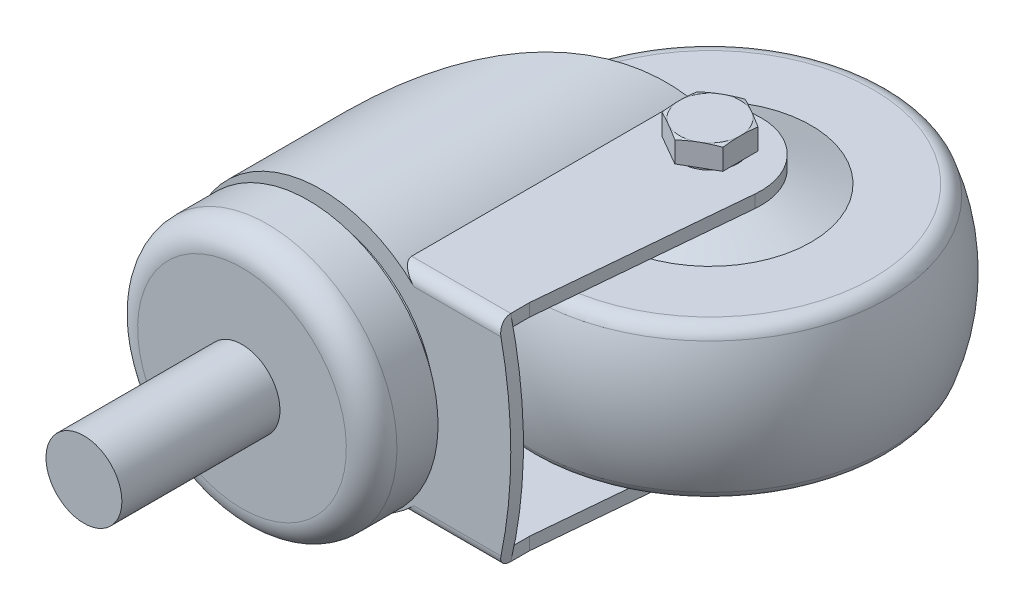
ISO-10303-21;
HEADER;
FILE_DESCRIPTION(('STEP AP214'),'2;1');
FILE_NAME('part.step','',(''),(''),'','','');
FILE_SCHEMA(('AUTOMOTIVE_DESIGN { 1 0 10303 214 1 1 1 1 }'));
ENDSEC;
DATA;
#1=APPLICATION_CONTEXT('core data for automotive mechanical design processes');
#2=APPLICATION_PROTOCOL_DEFINITION('international standard','automotive_design',2000,#1);
#3=PRODUCT_CONTEXT('',#1,'mechanical');
#4=PRODUCT('Part','Part','',(#3));
#5=PRODUCT_RELATED_PRODUCT_CATEGORY('part','',(#4));
#6=PRODUCT_DEFINITION_FORMATION('','',#4);
#7=PRODUCT_DEFINITION_CONTEXT('part definition',#1,'design');
#8=PRODUCT_DEFINITION('design','',#6,#7);
#9=PRODUCT_DEFINITION_SHAPE('','',#8);
#10=(LENGTH_UNIT() NAMED_UNIT(*) SI_UNIT(.MILLI.,.METRE.));
#11=(NAMED_UNIT(*) PLANE_ANGLE_UNIT() SI_UNIT($,.RADIAN.));
#12=(NAMED_UNIT(*) SI_UNIT($,.STERADIAN.) SOLID_ANGLE_UNIT());
#13=UNCERTAINTY_MEASURE_WITH_UNIT(LENGTH_MEASURE(1.E-05),#10,'distance_accuracy_value','');
#14=(GEOMETRIC_REPRESENTATION_CONTEXT(3) GLOBAL_UNCERTAINTY_ASSIGNED_CONTEXT((#13)) GLOBAL_UNIT_ASSIGNED_CONTEXT((#10,
#11,#12)) REPRESENTATION_CONTEXT('',''));
#15=CARTESIAN_POINT('',(0.,0.,0.));
#16=DIRECTION('',(0.,0.,1.));
#17=DIRECTION('',(1.,0.,0.));
#18=AXIS2_PLACEMENT_3D('',#15,#16,#17);
#19=CARTESIAN_POINT('',(-500000.,15.,-63.));
#20=DIRECTION('',(0.,1.,0.));
#21=DIRECTION('',(0.,0.,-1.));
#22=AXIS2_PLACEMENT_3D('',#19,#20,#21);
#23=PLANE('',#22);
#24=DIRECTION('',(-0.0901671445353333,0.,0.995926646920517));
#25=VECTOR('',#24,1.);
#26=CARTESIAN_POINT('',(-4033.19872630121,15.0000000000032,44839.8152760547));
#27=LINE('',#26,#25);
#28=CARTESIAN_POINT('',(30.9592664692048,15.,-50.1861003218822));
#29=VERTEX_POINT('',#28);
#30=CARTESIAN_POINT('',(28.,15.,-17.5));
#31=VERTEX_POINT('',#30);
#32=EDGE_CURVE('E295',#29,#31,#27,.T.);
#33=ORIENTED_EDGE('',*,*,#32,.T.);
#34=DIRECTION('',(0.,0.,1.));
#35=VECTOR('',#34,1.);
#36=CARTESIAN_POINT('',(28.,15.,-63.));
#37=LINE('',#36,#35);
#38=CARTESIAN_POINT('',(28.,15.,-14.5));
#39=VERTEX_POINT('',#38);
#40=EDGE_CURVE('E387',#31,#39,#37,.T.);
#41=ORIENTED_EDGE('',*,*,#40,.T.);
#42=DIRECTION('',(1.,0.,0.));
#43=VECTOR('',#42,1.);
#44=CARTESIAN_POINT('',(-500000.,15.,-14.5));
#45=LINE('',#44,#43);
#46=CARTESIAN_POINT('',(11.6619037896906,15.,-14.5));
#47=VERTEX_POINT('',#46);
#48=EDGE_CURVE('E396',#47,#39,#45,.T.);
#49=ORIENTED_EDGE('',*,*,#48,.F.);
#50=DIRECTION('',(0.,0.,1.));
#51=VECTOR('',#50,1.);
#52=CARTESIAN_POINT('',(11.6619037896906,15.,-63.));
#53=LINE('',#52,#51);
#54=CARTESIAN_POINT('',(11.6619037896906,15.,-57.8610711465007));
#55=VERTEX_POINT('',#54);
#56=EDGE_CURVE('E386',#55,#47,#53,.T.);
#57=ORIENTED_EDGE('',*,*,#56,.F.);
#58=CARTESIAN_POINT('',(38.5957062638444,15.,-5.12039723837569));
#59=DIRECTION('',(0.,1.,0.));
#60=DIRECTION('',(0.,0.,-1.));
#61=AXIS2_PLACEMENT_3D('',#58,#59,#60);
#62=CIRCLE('',#61,59.2199999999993);
#63=CARTESIAN_POINT('',(17.4250901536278,15.,-60.4269376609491));
#64=VERTEX_POINT('',#63);
#65=EDGE_CURVE('E705',#55,#64,#62,.F.);
#66=ORIENTED_EDGE('',*,*,#65,.T.);
#67=CARTESIAN_POINT('',(21.,15.,-51.0877717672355));
#68=DIRECTION('',(0.,1.,0.));
#69=DIRECTION('',(0.,0.,-1.));
#70=AXIS2_PLACEMENT_3D('',#67,#68,#69);
#71=CIRCLE('',#70,9.99999999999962);
#72=EDGE_CURVE('E734',#64,#29,#71,.F.);
#73=ORIENTED_EDGE('',*,*,#72,.T.);
#74=EDGE_LOOP('',(#33,#41,#49,#57,#66,#73));
#75=FACE_BOUND('',#74,.T.);
#76=CARTESIAN_POINT('',(21.,15.,-53.));
#77=DIRECTION('',(0.,1.,0.));
#78=DIRECTION('',(0.,0.,-1.));
#79=AXIS2_PLACEMENT_3D('',#76,#77,#78);
#80=CIRCLE('',#79,8.);
#81=CARTESIAN_POINT('',(21.,15.,-61.));
#82=VERTEX_POINT('',#81);
#83=EDGE_CURVE('E9',#82,#82,#80,.F.);
#84=ORIENTED_EDGE('',*,*,#83,.F.);
#85=EDGE_LOOP('',(#84));
#86=FACE_BOUND('',#85,.T.);
#87=ADVANCED_FACE('F14',(#75,#86),#23,.F.);
#88=CARTESIAN_POINT('',(-500000.,-15.,-14.5));
#89=DIRECTION('',(0.,-1.,0.));
#90=DIRECTION('',(1.,0.,0.));
#91=AXIS2_PLACEMENT_3D('',#88,#89,#90);
#92=PLANE('',#91);
#93=DIRECTION('',(1.,0.,0.));
#94=VECTOR('',#93,1.);
#95=CARTESIAN_POINT('',(-500000.,-15.,-14.5));
#96=LINE('',#95,#94);
#97=CARTESIAN_POINT('',(11.6619037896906,-15.,-14.5));
#98=VERTEX_POINT('',#97);
#99=CARTESIAN_POINT('',(28.,-15.,-14.5));
#100=VERTEX_POINT('',#99);
#101=EDGE_CURVE('E397',#98,#100,#96,.T.);
#102=ORIENTED_EDGE('',*,*,#101,.T.);
#103=DIRECTION('',(0.,0.,-1.));
#104=VECTOR('',#103,1.);
#105=CARTESIAN_POINT('',(28.,-15.,-14.5));
#106=LINE('',#105,#104);
#107=CARTESIAN_POINT('',(28.,-15.,-17.5));
#108=VERTEX_POINT('',#107);
#109=EDGE_CURVE('E287',#100,#108,#106,.T.);
#110=ORIENTED_EDGE('',*,*,#109,.T.);
#111=DIRECTION('',(0.0901671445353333,0.,-0.995926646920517));
#112=VECTOR('',#111,1.);
#113=CARTESIAN_POINT('',(-4037.5540196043,-15.,44887.9209655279));
#114=LINE('',#113,#112);
#115=CARTESIAN_POINT('',(30.9592664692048,-15.,-50.1861003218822));
#116=VERTEX_POINT('',#115);
#117=EDGE_CURVE('E737',#108,#116,#114,.T.);
#118=ORIENTED_EDGE('',*,*,#117,.T.);
#119=CARTESIAN_POINT('',(21.,-15.,-51.0877717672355));
#120=DIRECTION('',(0.,-1.,0.));
#121=DIRECTION('',(1.,0.,0.));
#122=AXIS2_PLACEMENT_3D('',#119,#120,#121);
#123=CIRCLE('',#122,9.99999999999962);
#124=CARTESIAN_POINT('',(17.4250901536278,-15.,-60.4269376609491));
#125=VERTEX_POINT('',#124);
#126=EDGE_CURVE('E716',#116,#125,#123,.F.);
#127=ORIENTED_EDGE('',*,*,#126,.T.);
#128=CARTESIAN_POINT('',(38.5957062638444,-15.,-5.12039723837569));
#129=DIRECTION('',(0.,-1.,0.));
#130=DIRECTION('',(1.,0.,0.));
#131=AXIS2_PLACEMENT_3D('',#128,#129,#130);
#132=CIRCLE('',#131,59.2199999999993);
#133=CARTESIAN_POINT('',(11.6619037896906,-15.,-57.8610711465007));
#134=VERTEX_POINT('',#133);
#135=EDGE_CURVE('E714',#125,#134,#132,.F.);
#136=ORIENTED_EDGE('',*,*,#135,.T.);
#137=DIRECTION('',(0.,0.,1.));
#138=VECTOR('',#137,1.);
#139=CARTESIAN_POINT('',(11.6619037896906,-15.,-63.));
#140=LINE('',#139,#138);
#141=EDGE_CURVE('E390',#134,#98,#140,.T.);
#142=ORIENTED_EDGE('',*,*,#141,.T.);
#143=EDGE_LOOP('',(#102,#110,#118,#127,#136,#142));
#144=FACE_BOUND('',#143,.T.);
#145=CARTESIAN_POINT('',(21.,-15.,-53.));
#146=DIRECTION('',(0.,-1.,0.));
#147=DIRECTION('',(1.,0.,0.));
#148=AXIS2_PLACEMENT_3D('',#145,#146,#147);
#149=CIRCLE('',#148,8.);
#150=CARTESIAN_POINT('',(29.,-15.,-53.));
#151=VERTEX_POINT('',#150);
#152=EDGE_CURVE('E23',#151,#151,#149,.F.);
#153=ORIENTED_EDGE('',*,*,#152,.F.);
#154=EDGE_LOOP('',(#153));
#155=FACE_BOUND('',#154,.T.);
#156=ADVANCED_FACE('F671',(#144,#155),#92,.F.);
#157=CARTESIAN_POINT('',(21.,-17.258124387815,-53.));
#158=DIRECTION('',(0.,-1.,0.));
#159=DIRECTION('',(1.,0.,0.));
#160=AXIS2_PLACEMENT_3D('',#157,#158,#159);
#161=CONICAL_SURFACE('',#160,5.78,1.30899693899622);
#162=CARTESIAN_POINT('',(19.3087452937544,-17.5189599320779,-59.538253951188));
#163=CARTESIAN_POINT('',(19.4849170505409,-17.4807721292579,-59.4365411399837));
#164=CARTESIAN_POINT('',(19.6612876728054,-17.4437566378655,-59.3347135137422));
#165=CARTESIAN_POINT('',(20.0145047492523,-17.3726814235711,-59.1307835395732));
#166=CARTESIAN_POINT('',(20.1913512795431,-17.3386222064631,-59.0286811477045));
#167=CARTESIAN_POINT('',(20.5459466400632,-17.2740097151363,-58.8239554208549));
#168=CARTESIAN_POINT('',(20.7236966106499,-17.243464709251,-58.7213314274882));
#169=CARTESIAN_POINT('',(21.0797138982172,-17.1867283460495,-58.515784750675));
#170=CARTESIAN_POINT('',(21.2579811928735,-17.1605368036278,-58.4128620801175));
#171=CARTESIAN_POINT('',(21.6127813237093,-17.1136239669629,-58.208018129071));
#172=CARTESIAN_POINT('',(21.7893076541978,-17.0928378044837,-58.1061006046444));
#173=CARTESIAN_POINT('',(22.1428083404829,-17.057098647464,-57.9020068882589));
#174=CARTESIAN_POINT('',(22.3197826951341,-17.0421456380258,-57.7998306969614));
#175=CARTESIAN_POINT('',(22.6738559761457,-17.0187627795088,-57.5954063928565));
#176=CARTESIAN_POINT('',(22.8509545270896,-17.0103254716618,-57.493158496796));
#177=CARTESIAN_POINT('',(23.205297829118,-17.0003745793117,-57.2885782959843));
#178=CARTESIAN_POINT('',(23.3825425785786,-16.998860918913,-57.1862459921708));
#179=CARTESIAN_POINT('',(23.7367993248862,-17.002837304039,-56.9817157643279));
#180=CARTESIAN_POINT('',(23.9138113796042,-17.0083204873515,-56.8795178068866));
#181=CARTESIAN_POINT('',(24.2675792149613,-17.0259876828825,-56.6752698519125));
#182=CARTESIAN_POINT('',(24.4443349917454,-17.0381717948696,-56.5732198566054));
#183=CARTESIAN_POINT('',(24.974401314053,-17.0839578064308,-56.2671859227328));
#184=CARTESIAN_POINT('',(25.3271265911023,-17.126786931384,-56.0635398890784));
#185=CARTESIAN_POINT('',(25.8568555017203,-17.2051291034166,-55.7577007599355));
#186=CARTESIAN_POINT('',(26.0346754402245,-17.2338221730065,-55.6550363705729));
#187=CARTESIAN_POINT('',(26.3898200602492,-17.2951239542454,-55.4499935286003));
#188=CARTESIAN_POINT('',(26.5671447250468,-17.3277327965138,-55.3476150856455));
#189=CARTESIAN_POINT('',(26.9208914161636,-17.39608732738,-55.1433793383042));
#190=CARTESIAN_POINT('',(27.097314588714,-17.4318252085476,-55.041521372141));
#191=CARTESIAN_POINT('',(27.4497195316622,-17.5059436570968,-54.8380602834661));
#192=CARTESIAN_POINT('',(27.6257013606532,-17.5443238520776,-54.7364571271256));
#193=CARTESIAN_POINT('',(27.8015018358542,-17.5837495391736,-54.6349586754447));
#194=B_SPLINE_CURVE_WITH_KNOTS('',3,(#162,#163,#164,#165,#166,#167,#168,#169,#170,#171,#172,
#173,#174,#175,#176,#177,#178,#179,#180,#181,#182,#183,#184,#185,#186,#187,#188,#189,#190,#191,
#192,#193),.UNSPECIFIED.,.F.,.F.,(4,2,2,2,2,2,2,2,2,2,2,2,2,2,2,4),(0.,0.620947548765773,
1.2420011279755,1.86448728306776,2.48694696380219,3.10155054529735,3.71615255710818,
4.33004996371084,4.94394064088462,5.55722970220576,6.17052789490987,7.3984531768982,
8.02040574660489,8.64237906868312,9.26284244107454,9.88321854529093),.UNSPECIFIED.);
#195=CARTESIAN_POINT('',(21.,-17.199659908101,-58.5618075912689));
#196=VERTEX_POINT('',#195);
#197=CARTESIAN_POINT('',(23.4083333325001,-17.,-57.1713556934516));
#198=VERTEX_POINT('',#197);
#199=EDGE_CURVE('E865',#196,#198,#194,.T.);
#200=ORIENTED_EDGE('',*,*,#199,.F.);
#201=CARTESIAN_POINT('',(15.3837584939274,-17.337512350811,-55.3192690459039));
#202=CARTESIAN_POINT('',(15.5857618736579,-17.2994343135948,-55.4358957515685));
#203=CARTESIAN_POINT('',(15.7880950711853,-17.2635089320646,-55.5527128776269));
#204=CARTESIAN_POINT('',(16.1935149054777,-17.197129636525,-55.7867821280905));
#205=CARTESIAN_POINT('',(16.3966018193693,-17.1666779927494,-55.9040344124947));
#206=CARTESIAN_POINT('',(16.8034502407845,-17.1124465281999,-56.1389284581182));
#207=CARTESIAN_POINT('',(17.0072117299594,-17.0886665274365,-56.2565702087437));
#208=CARTESIAN_POINT('',(17.415291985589,-17.0490018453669,-56.4921754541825));
#209=CARTESIAN_POINT('',(17.6196106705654,-17.0331160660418,-56.6101389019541));
#210=CARTESIAN_POINT('',(18.0263590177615,-17.0103445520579,-56.8449751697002));
#211=CARTESIAN_POINT('',(18.2287844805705,-17.0033608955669,-56.9618455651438));
#212=CARTESIAN_POINT('',(18.6337233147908,-16.9985470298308,-57.1956371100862));
#213=CARTESIAN_POINT('',(18.8362366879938,-17.0007170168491,-57.3125582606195));
#214=CARTESIAN_POINT('',(19.2409450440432,-17.0140560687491,-57.5462167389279));
#215=CARTESIAN_POINT('',(19.4431401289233,-17.0252210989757,-57.6629541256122));
#216=CARTESIAN_POINT('',(19.8470554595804,-17.0558175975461,-57.8961547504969));
#217=CARTESIAN_POINT('',(20.0487756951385,-17.0752492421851,-58.0126179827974));
#218=CARTESIAN_POINT('',(20.4495850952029,-17.1210642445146,-58.2440253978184));
#219=CARTESIAN_POINT('',(20.6486804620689,-17.1473764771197,-58.3589731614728));
#220=CARTESIAN_POINT('',(21.0462143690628,-17.2058824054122,-58.5884894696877));
#221=CARTESIAN_POINT('',(21.2446529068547,-17.2380761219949,-58.7030580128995));
#222=CARTESIAN_POINT('',(21.6410368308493,-17.3072800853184,-58.9319103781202));
#223=CARTESIAN_POINT('',(21.8389817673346,-17.3442937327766,-59.0461939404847));
#224=CARTESIAN_POINT('',(22.2343025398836,-17.4221799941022,-59.2744324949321));
#225=CARTESIAN_POINT('',(22.4316783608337,-17.4630527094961,-59.3883874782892));
#226=CARTESIAN_POINT('',(22.8284282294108,-17.5484227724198,-59.6174511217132));
#227=CARTESIAN_POINT('',(23.0277958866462,-17.5929595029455,-59.7325560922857));
#228=CARTESIAN_POINT('',(23.4260949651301,-17.6845635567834,-59.9625141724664));
#229=CARTESIAN_POINT('',(23.6250263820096,-17.7316309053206,-60.077367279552));
#230=CARTESIAN_POINT('',(24.0221581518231,-17.8277048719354,-60.3066514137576));
#231=CARTESIAN_POINT('',(24.2203591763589,-17.8767078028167,-60.421082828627));
#232=CARTESIAN_POINT('',(24.6164402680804,-17.9763616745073,-60.6497603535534));
#233=CARTESIAN_POINT('',(24.8143203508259,-18.027012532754,-60.7640064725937));
#234=CARTESIAN_POINT('',(25.0120733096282,-18.078304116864,-60.8781791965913));
#235=B_SPLINE_CURVE_WITH_KNOTS('',3,(#201,#202,#203,#204,#205,#206,#207,#208,#209,#210,#211,
#212,#213,#214,#215,#216,#217,#218,#219,#220,#221,#222,#223,#224,#225,#226,#227,#228,#229,#230,
#231,#232,#233,#234),.UNSPECIFIED.,.F.,.F.,(4,2,2,2,2,2,2,2,2,2,2,2,2,2,2,2,4),(0.,
0.709056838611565,1.41840708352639,2.1277381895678,2.83697060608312,3.53833229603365,
4.23970902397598,4.94077132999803,5.64184858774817,6.33594709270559,7.03004806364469,
7.72464144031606,8.41925309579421,9.12267089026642,9.82609569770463,10.528239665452,
11.2303485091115),.UNSPECIFIED.);
#236=CARTESIAN_POINT('',(18.5916666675,-17.,-57.1713556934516));
#237=VERTEX_POINT('',#236);
#238=EDGE_CURVE('E1409',#237,#196,#235,.T.);
#239=ORIENTED_EDGE('',*,*,#238,.F.);
#240=CARTESIAN_POINT('',(21.,-17.,-53.));
#241=DIRECTION('',(0.,-1.,0.));
#242=DIRECTION('',(1.,0.,0.));
#243=AXIS2_PLACEMENT_3D('',#240,#241,#242);
#244=CIRCLE('',#243,4.81666667);
#245=EDGE_CURVE('E1515',#237,#198,#244,.T.);
#246=ORIENTED_EDGE('',*,*,#245,.T.);
#247=EDGE_LOOP('',(#200,#239,#246));
#248=FACE_BOUND('',#247,.T.);
#249=ADVANCED_FACE('F673',(#248),#161,.T.);
#250=CARTESIAN_POINT('',(25.816666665,-17.199659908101,-55.7809037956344));
#251=VERTEX_POINT('',#250);
#252=EDGE_CURVE('E866',#198,#251,#194,.T.);
#253=ORIENTED_EDGE('',*,*,#252,.F.);
#254=CARTESIAN_POINT('',(25.816666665,-17.,-53.));
#255=VERTEX_POINT('',#254);
#256=EDGE_CURVE('E905',#198,#255,#244,.T.);
#257=ORIENTED_EDGE('',*,*,#256,.T.);
#258=CARTESIAN_POINT('',(25.816666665,-18.0654823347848,-60.3565171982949));
#259=CARTESIAN_POINT('',(25.816666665,-18.016509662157,-60.1379988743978));
#260=CARTESIAN_POINT('',(25.816666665,-17.9681359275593,-59.9193438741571));
#261=CARTESIAN_POINT('',(25.816666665,-17.8729096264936,-59.4816933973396));
#262=CARTESIAN_POINT('',(25.816666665,-17.8260571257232,-59.2626979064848));
#263=CARTESIAN_POINT('',(25.816666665,-17.7341558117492,-58.8241031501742));
#264=CARTESIAN_POINT('',(25.816666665,-17.6891088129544,-58.6045035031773));
#265=CARTESIAN_POINT('',(25.816666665,-17.6013047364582,-58.1648471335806));
#266=CARTESIAN_POINT('',(25.816666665,-17.5585476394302,-57.9447904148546));
#267=CARTESIAN_POINT('',(25.816666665,-17.4761981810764,-57.5058954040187));
#268=CARTESIAN_POINT('',(25.816666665,-17.4365833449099,-57.2870613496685));
#269=CARTESIAN_POINT('',(25.816666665,-17.3608122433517,-56.8487963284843));
#270=CARTESIAN_POINT('',(25.816666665,-17.3246559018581,-56.629365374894));
#271=CARTESIAN_POINT('',(25.816666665,-17.2566158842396,-56.1898639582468));
#272=CARTESIAN_POINT('',(25.816666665,-17.2247316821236,-55.9697935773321));
#273=CARTESIAN_POINT('',(25.816666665,-17.1661755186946,-55.5289525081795));
#274=CARTESIAN_POINT('',(25.816666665,-17.1395035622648,-55.3081818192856));
#275=CARTESIAN_POINT('',(25.816666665,-17.0921271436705,-54.86344943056));
#276=CARTESIAN_POINT('',(25.816666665,-17.0714940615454,-54.6394800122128));
#277=CARTESIAN_POINT('',(25.816666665,-17.0376187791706,-54.1909781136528));
#278=CARTESIAN_POINT('',(25.816666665,-17.0243764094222,-53.9664456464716));
#279=CARTESIAN_POINT('',(25.816666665,-17.0060548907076,-53.5171433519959));
#280=CARTESIAN_POINT('',(25.816666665,-17.0009720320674,-53.2923736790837));
#281=CARTESIAN_POINT('',(25.816666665,-16.9992820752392,-52.8428020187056));
#282=CARTESIAN_POINT('',(25.816666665,-17.0026749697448,-52.6180000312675));
#283=CARTESIAN_POINT('',(25.816666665,-17.0177455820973,-52.1678615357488));
#284=CARTESIAN_POINT('',(25.816666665,-17.0294533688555,-51.9425260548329));
#285=CARTESIAN_POINT('',(25.816666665,-17.0604859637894,-51.4923851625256));
#286=CARTESIAN_POINT('',(25.816666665,-17.0798109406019,-51.2675797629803));
#287=CARTESIAN_POINT('',(25.816666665,-17.1250998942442,-50.8185002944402));
#288=CARTESIAN_POINT('',(25.816666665,-17.1510682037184,-50.5942266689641));
#289=CARTESIAN_POINT('',(25.816666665,-17.2085702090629,-50.1464030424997));
#290=CARTESIAN_POINT('',(25.816666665,-17.2401039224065,-49.9228530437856));
#291=CARTESIAN_POINT('',(25.816666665,-17.3370238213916,-49.2828076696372));
#292=CARTESIAN_POINT('',(25.816666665,-17.4080457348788,-48.8671698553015));
#293=CARTESIAN_POINT('',(25.816666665,-17.5606088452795,-48.0378298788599));
#294=CARTESIAN_POINT('',(25.816666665,-17.6421513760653,-47.6241279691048));
#295=CARTESIAN_POINT('',(25.816666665,-17.8122990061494,-46.7980854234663));
#296=CARTESIAN_POINT('',(25.816666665,-17.9009058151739,-46.3857451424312));
#297=CARTESIAN_POINT('',(25.816666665,-18.0829250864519,-45.5621603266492));
#298=CARTESIAN_POINT('',(25.816666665,-18.1763372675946,-45.1509157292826));
#299=CARTESIAN_POINT('',(25.816666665,-18.365604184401,-44.3332483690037));
#300=CARTESIAN_POINT('',(25.816666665,-18.4614258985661,-43.9268179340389));
#301=CARTESIAN_POINT('',(25.816666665,-18.6554688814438,-43.1145240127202));
#302=CARTESIAN_POINT('',(25.816666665,-18.7536901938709,-42.7086605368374));
#303=CARTESIAN_POINT('',(25.816666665,-18.9517828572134,-41.8978680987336));
#304=CARTESIAN_POINT('',(25.816666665,-19.0516520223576,-41.4929386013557));
#305=CARTESIAN_POINT('',(25.816666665,-19.2527540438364,-40.6834323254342));
#306=CARTESIAN_POINT('',(25.816666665,-19.3539868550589,-40.2788555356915));
#307=CARTESIAN_POINT('',(25.816666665,-19.4557026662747,-39.8744016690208));
#308=B_SPLINE_CURVE_WITH_KNOTS('',3,(#258,#259,#260,#261,#262,#263,#264,#265,#266,#267,#268,
#269,#270,#271,#272,#273,#274,#275,#276,#277,#278,#279,#280,#281,#282,#283,#284,#285,#286,#287,
#288,#289,#290,#291,#292,#293,#294,#295,#296,#297,#298,#299,#300,#301,#302,#303,#304,#305,#306,
#307),.UNSPECIFIED.,.F.,.F.,(4,2,2,2,2,2,2,2,2,2,2,2,2,2,2,2,2,2,2,2,2,2,2,2,4),(0.,
0.671819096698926,1.34366716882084,2.01617428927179,2.68867573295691,3.35582604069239,
4.02296166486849,4.69001507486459,5.35706910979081,6.03171582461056,6.70634706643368,
7.38067150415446,8.05499536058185,8.73177025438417,9.40856013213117,10.0857925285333,
10.7630270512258,12.0277754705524,13.292684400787,14.5579004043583,15.8230424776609,
17.0757526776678,18.3284857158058,19.5796728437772,20.8308186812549),.UNSPECIFIED.);
#309=EDGE_CURVE('E1525',#251,#255,#308,.T.);
#310=ORIENTED_EDGE('',*,*,#309,.F.);
#311=EDGE_LOOP('',(#253,#257,#310));
#312=FACE_BOUND('',#311,.T.);
#313=ADVANCED_FACE('F680',(#312),#161,.T.);
#314=CARTESIAN_POINT('',(25.816666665,-17.199659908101,-50.2190962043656));
#315=VERTEX_POINT('',#314);
#316=EDGE_CURVE('E871',#255,#315,#308,.T.);
#317=ORIENTED_EDGE('',*,*,#316,.F.);
#318=CARTESIAN_POINT('',(23.4083333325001,-17.,-48.8286443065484));
#319=VERTEX_POINT('',#318);
#320=EDGE_CURVE('E908',#255,#319,#244,.T.);
#321=ORIENTED_EDGE('',*,*,#320,.T.);
#322=CARTESIAN_POINT('',(29.8284639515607,-18.0782325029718,-52.5353084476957));
#323=CARTESIAN_POINT('',(29.630710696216,-18.0269414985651,-52.4211355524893));
#324=CARTESIAN_POINT('',(29.4328303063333,-17.9762912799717,-52.3068892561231));
#325=CARTESIAN_POINT('',(29.0367485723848,-17.8766388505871,-52.0782113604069));
#326=CARTESIAN_POINT('',(28.8385472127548,-17.827636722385,-51.9637797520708));
#327=CARTESIAN_POINT('',(28.4414146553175,-17.7315645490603,-51.7344951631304));
#328=CARTESIAN_POINT('',(28.2424827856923,-17.6844981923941,-51.6196417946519));
#329=CARTESIAN_POINT('',(27.8441827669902,-17.592896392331,-51.3896831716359));
#330=CARTESIAN_POINT('',(27.6448146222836,-17.5483609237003,-51.2745779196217));
#331=CARTESIAN_POINT('',(27.2480639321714,-17.4629937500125,-51.0455138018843));
#332=CARTESIAN_POINT('',(27.050687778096,-17.4221226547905,-50.9315586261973));
#333=CARTESIAN_POINT('',(26.6553663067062,-17.3442400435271,-50.7033196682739));
#334=CARTESIAN_POINT('',(26.4574210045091,-17.3072284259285,-50.5890358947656));
#335=CARTESIAN_POINT('',(26.0610363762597,-17.2380290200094,-50.3601831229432));
#336=CARTESIAN_POINT('',(25.8625975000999,-17.2058378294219,-50.2456143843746));
#337=CARTESIAN_POINT('',(25.4650629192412,-17.147337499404,-50.0160976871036));
#338=CARTESIAN_POINT('',(25.2659672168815,-17.1210283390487,-49.9011497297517));
#339=CARTESIAN_POINT('',(24.865157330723,-17.0752200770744,-49.6697420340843));
#340=CARTESIAN_POINT('',(24.6634369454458,-17.0557921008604,-49.5532787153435));
#341=CARTESIAN_POINT('',(24.2595214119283,-17.0252033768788,-49.3200779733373));
#342=CARTESIAN_POINT('',(24.0573262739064,-17.0140424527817,-49.2033405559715));
#343=CARTESIAN_POINT('',(23.6526178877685,-17.0007118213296,-48.9696820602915));
#344=CARTESIAN_POINT('',(23.4501045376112,-16.9985461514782,-48.8527609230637));
#345=CARTESIAN_POINT('',(23.0451658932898,-17.0033685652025,-48.6189694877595));
#346=CARTESIAN_POINT('',(22.8427405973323,-17.0103564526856,-48.5020991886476));
#347=CARTESIAN_POINT('',(22.4359924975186,-17.0331361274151,-48.2672630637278));
#348=CARTESIAN_POINT('',(22.2316738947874,-17.0490258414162,-48.1492996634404));
#349=CARTESIAN_POINT('',(21.823593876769,-17.0886978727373,-47.9136945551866));
#350=CARTESIAN_POINT('',(21.6198325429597,-17.1124812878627,-47.7960528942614));
#351=CARTESIAN_POINT('',(21.2129846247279,-17.1667189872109,-47.561159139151));
#352=CARTESIAN_POINT('',(21.0098980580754,-17.1971734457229,-47.4439070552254));
#353=CARTESIAN_POINT('',(20.6044789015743,-17.2635578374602,-47.2098381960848));
#354=CARTESIAN_POINT('',(20.4021460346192,-17.299485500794,-47.0930212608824));
#355=CARTESIAN_POINT('',(20.200142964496,-17.3375655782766,-46.9763947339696));
#356=B_SPLINE_CURVE_WITH_KNOTS('',3,(#322,#323,#324,#325,#326,#327,#328,#329,#330,#331,#332,
#333,#334,#335,#336,#337,#338,#339,#340,#341,#342,#343,#344,#345,#346,#347,#348,#349,#350,#351,
#352,#353,#354,#355),.UNSPECIFIED.,.F.,.F.,(4,2,2,2,2,2,2,2,2,2,2,2,2,2,2,2,4),(0.,
0.702109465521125,1.40425406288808,2.10767980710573,2.81109853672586,3.50571046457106,
4.20030410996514,4.89440517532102,5.58850377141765,6.28958061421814,6.99064250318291,
7.69201902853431,8.39338052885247,9.10261347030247,9.81194508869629,10.5212952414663,
11.2303520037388),.UNSPECIFIED.);
#357=EDGE_CURVE('E900',#315,#319,#356,.T.);
#358=ORIENTED_EDGE('',*,*,#357,.F.);
#359=EDGE_LOOP('',(#317,#321,#358));
#360=FACE_BOUND('',#359,.T.);
#361=ADVANCED_FACE('F1141',(#360),#161,.T.);
#362=CARTESIAN_POINT('',(16.183333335,-17.199659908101,-55.7809037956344));
#363=VERTEX_POINT('',#362);
#364=EDGE_CURVE('E1414',#363,#237,#235,.T.);
#365=ORIENTED_EDGE('',*,*,#364,.F.);
#366=CARTESIAN_POINT('',(16.183333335,-18.0654823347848,-60.3565171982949));
#367=CARTESIAN_POINT('',(16.183333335,-18.016509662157,-60.1379988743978));
#368=CARTESIAN_POINT('',(16.183333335,-17.9681359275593,-59.9193438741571));
#369=CARTESIAN_POINT('',(16.183333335,-17.8729096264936,-59.4816933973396));
#370=CARTESIAN_POINT('',(16.183333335,-17.8260571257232,-59.2626979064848));
#371=CARTESIAN_POINT('',(16.183333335,-17.7341558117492,-58.8241031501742));
#372=CARTESIAN_POINT('',(16.183333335,-17.6891088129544,-58.6045035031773));
#373=CARTESIAN_POINT('',(16.183333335,-17.6013047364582,-58.1648471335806));
#374=CARTESIAN_POINT('',(16.183333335,-17.5585476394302,-57.9447904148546));
#375=CARTESIAN_POINT('',(16.183333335,-17.4761981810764,-57.5058954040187));
#376=CARTESIAN_POINT('',(16.183333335,-17.4365833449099,-57.2870613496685));
#377=CARTESIAN_POINT('',(16.183333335,-17.3608122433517,-56.8487963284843));
#378=CARTESIAN_POINT('',(16.183333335,-17.3246559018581,-56.629365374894));
#379=CARTESIAN_POINT('',(16.183333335,-17.2566158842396,-56.1898639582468));
#380=CARTESIAN_POINT('',(16.183333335,-17.2247316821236,-55.9697935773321));
#381=CARTESIAN_POINT('',(16.183333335,-17.1661755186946,-55.5289525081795));
#382=CARTESIAN_POINT('',(16.183333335,-17.1395035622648,-55.3081818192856));
#383=CARTESIAN_POINT('',(16.183333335,-17.0921271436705,-54.86344943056));
#384=CARTESIAN_POINT('',(16.183333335,-17.0714940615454,-54.6394800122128));
#385=CARTESIAN_POINT('',(16.183333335,-17.0376187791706,-54.1909781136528));
#386=CARTESIAN_POINT('',(16.183333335,-17.0243764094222,-53.9664456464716));
#387=CARTESIAN_POINT('',(16.183333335,-17.0060548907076,-53.5171433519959));
#388=CARTESIAN_POINT('',(16.183333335,-17.0009720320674,-53.2923736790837));
#389=CARTESIAN_POINT('',(16.183333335,-16.9992820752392,-52.8428020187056));
#390=CARTESIAN_POINT('',(16.183333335,-17.0026749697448,-52.6180000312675));
#391=CARTESIAN_POINT('',(16.183333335,-17.0177455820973,-52.1678615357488));
#392=CARTESIAN_POINT('',(16.183333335,-17.0294533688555,-51.9425260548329));
#393=CARTESIAN_POINT('',(16.183333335,-17.0604859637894,-51.4923851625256));
#394=CARTESIAN_POINT('',(16.183333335,-17.0798109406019,-51.2675797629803));
#395=CARTESIAN_POINT('',(16.183333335,-17.1250998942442,-50.8185002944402));
#396=CARTESIAN_POINT('',(16.183333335,-17.1510682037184,-50.5942266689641));
#397=CARTESIAN_POINT('',(16.183333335,-17.2085702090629,-50.1464030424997));
#398=CARTESIAN_POINT('',(16.183333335,-17.2401039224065,-49.9228530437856));
#399=CARTESIAN_POINT('',(16.183333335,-17.3370238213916,-49.2828076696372));
#400=CARTESIAN_POINT('',(16.183333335,-17.4080457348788,-48.8671698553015));
#401=CARTESIAN_POINT('',(16.183333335,-17.5606088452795,-48.0378298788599));
#402=CARTESIAN_POINT('',(16.183333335,-17.6421513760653,-47.6241279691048));
#403=CARTESIAN_POINT('',(16.183333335,-17.8122990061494,-46.7980854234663));
#404=CARTESIAN_POINT('',(16.183333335,-17.9009058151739,-46.3857451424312));
#405=CARTESIAN_POINT('',(16.183333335,-18.0829250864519,-45.5621603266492));
#406=CARTESIAN_POINT('',(16.183333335,-18.1763372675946,-45.1509157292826));
#407=CARTESIAN_POINT('',(16.183333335,-18.365604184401,-44.3332483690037));
#408=CARTESIAN_POINT('',(16.183333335,-18.4614258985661,-43.9268179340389));
#409=CARTESIAN_POINT('',(16.183333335,-18.6554688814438,-43.1145240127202));
#410=CARTESIAN_POINT('',(16.183333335,-18.7536901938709,-42.7086605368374));
#411=CARTESIAN_POINT('',(16.183333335,-18.9517828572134,-41.8978680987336));
#412=CARTESIAN_POINT('',(16.183333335,-19.0516520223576,-41.4929386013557));
#413=CARTESIAN_POINT('',(16.183333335,-19.2527540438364,-40.6834323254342));
#414=CARTESIAN_POINT('',(16.183333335,-19.3539868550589,-40.2788555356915));
#415=CARTESIAN_POINT('',(16.183333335,-19.4557026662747,-39.8744016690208));
#416=B_SPLINE_CURVE_WITH_KNOTS('',3,(#366,#367,#368,#369,#370,#371,#372,#373,#374,#375,#376,
#377,#378,#379,#380,#381,#382,#383,#384,#385,#386,#387,#388,#389,#390,#391,#392,#393,#394,#395,
#396,#397,#398,#399,#400,#401,#402,#403,#404,#405,#406,#407,#408,#409,#410,#411,#412,#413,#414,
#415),.UNSPECIFIED.,.F.,.F.,(4,2,2,2,2,2,2,2,2,2,2,2,2,2,2,2,2,2,2,2,2,2,2,2,4),(0.,
0.671819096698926,1.34366716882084,2.01617428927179,2.68867573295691,3.35582604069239,
4.02296166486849,4.69001507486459,5.35706910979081,6.03171582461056,6.70634706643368,
7.38067150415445,8.05499536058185,8.73177025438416,9.40856013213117,10.0857925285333,
10.7630270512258,12.0277754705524,13.292684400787,14.5579004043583,15.8230424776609,
17.0757526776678,18.3284857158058,19.5796728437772,20.8308186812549),.UNSPECIFIED.);
#417=CARTESIAN_POINT('',(16.183333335,-17.,-53.));
#418=VERTEX_POINT('',#417);
#419=EDGE_CURVE('E821',#418,#363,#416,.F.);
#420=ORIENTED_EDGE('',*,*,#419,.F.);
#421=EDGE_CURVE('E1513',#418,#237,#244,.T.);
#422=ORIENTED_EDGE('',*,*,#421,.T.);
#423=EDGE_LOOP('',(#365,#420,#422));
#424=FACE_BOUND('',#423,.T.);
#425=ADVANCED_FACE('F1149',(#424),#161,.T.);
#426=CARTESIAN_POINT('',(21.,-17.199659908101,-47.4381924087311));
#427=VERTEX_POINT('',#426);
#428=EDGE_CURVE('E894',#319,#427,#356,.T.);
#429=ORIENTED_EDGE('',*,*,#428,.F.);
#430=CARTESIAN_POINT('',(18.5916666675,-17.,-48.8286443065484));
#431=VERTEX_POINT('',#430);
#432=EDGE_CURVE('E911',#319,#431,#244,.T.);
#433=ORIENTED_EDGE('',*,*,#432,.T.);
#434=CARTESIAN_POINT('',(22.9852538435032,-17.5838434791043,-46.2920055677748));
#435=CARTESIAN_POINT('',(22.809453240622,-17.5444159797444,-46.3935040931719));
#436=CARTESIAN_POINT('',(22.63347130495,-17.5060338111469,-46.4951073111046));
#437=CARTESIAN_POINT('',(22.2810661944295,-17.4319110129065,-46.6985684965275));
#438=CARTESIAN_POINT('',(22.1046429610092,-17.3961707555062,-46.800426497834));
#439=CARTESIAN_POINT('',(21.7508961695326,-17.327810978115,-47.004662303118));
#440=CARTESIAN_POINT('',(21.573571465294,-17.2951992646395,-47.1070407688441));
#441=CARTESIAN_POINT('',(21.2184267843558,-17.2338911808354,-47.3120836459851));
#442=CARTESIAN_POINT('',(21.0406068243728,-17.2051946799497,-47.4147480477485));
#443=CARTESIAN_POINT('',(20.5108778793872,-17.1268413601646,-47.7205871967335));
#444=CARTESIAN_POINT('',(20.1581525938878,-17.0840035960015,-47.9242332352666));
#445=CARTESIAN_POINT('',(19.6280859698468,-17.0382030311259,-48.2302673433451));
#446=CARTESIAN_POINT('',(19.4513300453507,-17.0260138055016,-48.3323174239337));
#447=CARTESIAN_POINT('',(19.0975617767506,-17.0083360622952,-48.5365656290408));
#448=CARTESIAN_POINT('',(18.9205494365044,-17.0028474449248,-48.6387637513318));
#449=CARTESIAN_POINT('',(18.5662914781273,-16.9988601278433,-48.8432946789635));
#450=CARTESIAN_POINT('',(18.3890458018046,-17.0003683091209,-48.945627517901));
#451=CARTESIAN_POINT('',(18.0347004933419,-17.0103085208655,-49.150208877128));
#452=CARTESIAN_POINT('',(17.8576008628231,-17.0187406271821,-49.2524573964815));
#453=CARTESIAN_POINT('',(17.5035253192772,-17.0421135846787,-49.4568830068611));
#454=CARTESIAN_POINT('',(17.3265497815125,-17.0570618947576,-49.5590598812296));
#455=CARTESIAN_POINT('',(16.9730466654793,-17.0927922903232,-49.7631550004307));
#456=CARTESIAN_POINT('',(16.796519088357,-17.1135743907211,-49.8650732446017));
#457=CARTESIAN_POINT('',(16.4417164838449,-17.160479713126,-50.0699186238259));
#458=CARTESIAN_POINT('',(16.2634479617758,-17.1866678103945,-50.1728420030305));
#459=CARTESIAN_POINT('',(15.9074282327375,-17.2433979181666,-50.3783900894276));
#460=CARTESIAN_POINT('',(15.7296770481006,-17.2739401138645,-50.4810147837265));
#461=CARTESIAN_POINT('',(15.375079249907,-17.3385475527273,-50.6857419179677));
#462=CARTESIAN_POINT('',(15.1982314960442,-17.3726045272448,-50.7878450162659));
#463=CARTESIAN_POINT('',(14.8450120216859,-17.4436757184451,-50.9917763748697));
#464=CARTESIAN_POINT('',(14.668640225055,-17.4806894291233,-51.093604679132));
#465=CARTESIAN_POINT('',(14.4924673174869,-17.5188756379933,-51.1953181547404));
#466=B_SPLINE_CURVE_WITH_KNOTS('',3,(#434,#435,#436,#437,#438,#439,#440,#441,#442,#443,#444,
#445,#446,#447,#448,#449,#450,#451,#452,#453,#454,#455,#456,#457,#458,#459,#460,#461,#462,#463,
#464,#465),.UNSPECIFIED.,.F.,.F.,(4,2,2,2,2,2,2,2,2,2,2,2,2,2,2,4),(0.,0.620377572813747,
1.24084239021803,1.86281721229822,2.48477128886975,3.71269945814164,4.32599908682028,
4.93928958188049,5.55318334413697,6.16708383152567,6.78168888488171,7.39629550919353,
8.01875808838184,8.64124715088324,9.26230379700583,9.8832543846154),.UNSPECIFIED.);
#467=EDGE_CURVE('E812',#427,#431,#466,.T.);
#468=ORIENTED_EDGE('',*,*,#467,.F.);
#469=EDGE_LOOP('',(#429,#433,#468));
#470=FACE_BOUND('',#469,.T.);
#471=ADVANCED_FACE('F586',(#470),#161,.T.);
#472=CARTESIAN_POINT('',(21.,17.5,-47.22));
#473=DIRECTION('',(0.,-1.,0.));
#474=DIRECTION('',(1.,0.,0.));
#475=AXIS2_PLACEMENT_3D('',#472,#473,#474);
#476=PLANE('',#475);
#477=CARTESIAN_POINT('',(21.,17.5,-53.));
#478=DIRECTION('',(0.,-1.,0.));
#479=DIRECTION('',(1.,0.,0.));
#480=AXIS2_PLACEMENT_3D('',#477,#478,#479);
#481=CIRCLE('',#480,4.44);
#482=CARTESIAN_POINT('',(25.44,17.5,-53.));
#483=VERTEX_POINT('',#482);
#484=EDGE_CURVE('E456',#483,#483,#481,.T.);
#485=ORIENTED_EDGE('',*,*,#484,.F.);
#486=EDGE_LOOP('',(#485));
#487=FACE_BOUND('',#486,.T.);
#488=DIRECTION('',(-0.866025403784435,0.,-0.500000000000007));
#489=VECTOR('',#488,1.);
#490=CARTESIAN_POINT('',(25.816666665,17.5,-55.7809037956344));
#491=LINE('',#490,#489);
#492=CARTESIAN_POINT('',(25.816666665,17.5,-55.7809037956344));
#493=VERTEX_POINT('',#492);
#494=CARTESIAN_POINT('',(21.,17.5,-58.5618075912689));
#495=VERTEX_POINT('',#494);
#496=EDGE_CURVE('E914',#493,#495,#491,.T.);
#497=ORIENTED_EDGE('',*,*,#496,.F.);
#498=DIRECTION('',(0.,0.,-1.));
#499=VECTOR('',#498,1.);
#500=CARTESIAN_POINT('',(25.816666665,17.5,-50.2190962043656));
#501=LINE('',#500,#499);
#502=CARTESIAN_POINT('',(25.816666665,17.5,-50.2190962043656));
#503=VERTEX_POINT('',#502);
#504=EDGE_CURVE('E912',#503,#493,#501,.T.);
#505=ORIENTED_EDGE('',*,*,#504,.F.);
#506=DIRECTION('',(0.866025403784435,0.,-0.500000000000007));
#507=VECTOR('',#506,1.);
#508=CARTESIAN_POINT('',(21.,17.5,-47.4381924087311));
#509=LINE('',#508,#507);
#510=CARTESIAN_POINT('',(21.,17.5,-47.4381924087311));
#511=VERTEX_POINT('',#510);
#512=EDGE_CURVE('E915',#511,#503,#509,.T.);
#513=ORIENTED_EDGE('',*,*,#512,.F.);
#514=DIRECTION('',(0.866025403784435,0.,0.500000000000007));
#515=VECTOR('',#514,1.);
#516=CARTESIAN_POINT('',(16.183333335,17.5,-50.2190962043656));
#517=LINE('',#516,#515);
#518=CARTESIAN_POINT('',(16.183333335,17.5,-50.2190962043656));
#519=VERTEX_POINT('',#518);
#520=EDGE_CURVE('E910',#519,#511,#517,.T.);
#521=ORIENTED_EDGE('',*,*,#520,.F.);
#522=DIRECTION('',(0.,0.,1.));
#523=VECTOR('',#522,1.);
#524=CARTESIAN_POINT('',(16.183333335,17.5,-55.7809037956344));
#525=LINE('',#524,#523);
#526=CARTESIAN_POINT('',(16.183333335,17.5,-55.7809037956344));
#527=VERTEX_POINT('',#526);
#528=EDGE_CURVE('E926',#527,#519,#525,.T.);
#529=ORIENTED_EDGE('',*,*,#528,.F.);
#530=DIRECTION('',(-0.866025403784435,0.,0.500000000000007));
#531=VECTOR('',#530,1.);
#532=CARTESIAN_POINT('',(21.,17.5,-58.5618075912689));
#533=LINE('',#532,#531);
#534=EDGE_CURVE('E920',#495,#527,#533,.T.);
#535=ORIENTED_EDGE('',*,*,#534,.F.);
#536=EDGE_LOOP('',(#497,#505,#513,#521,#529,#535));
#537=FACE_BOUND('',#536,.T.);
#538=ADVANCED_FACE('F583',(#487,#537),#476,.T.);
#539=CARTESIAN_POINT('',(0.,0.,-53.));
#540=DIRECTION('',(0.,0.,-1.));
#541=DIRECTION('',(0.,-1.,0.));
#542=AXIS2_PLACEMENT_3D('',#539,#540,#541);
#543=CYLINDRICAL_SURFACE('',#542,19.);
#544=CARTESIAN_POINT('',(11.6619037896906,15.,-57.8610711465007));
#545=CARTESIAN_POINT('',(11.4399193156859,15.1725872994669,-57.7477099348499));
#546=CARTESIAN_POINT('',(11.2151589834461,15.3394186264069,-57.631158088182));
#547=CARTESIAN_POINT('',(10.7608022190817,15.6615027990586,-57.3917318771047));
#548=CARTESIAN_POINT('',(10.5312062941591,15.8167568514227,-57.268858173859));
#549=CARTESIAN_POINT('',(9.83671675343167,16.2647514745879,-56.8911044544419));
#550=CARTESIAN_POINT('',(9.36559220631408,16.5401335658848,-56.6268230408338));
#551=CARTESIAN_POINT('',(8.41640975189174,17.0426063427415,-56.0764306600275));
#552=CARTESIAN_POINT('',(7.9384301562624,17.2700431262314,-55.7904979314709));
#553=CARTESIAN_POINT('',(6.977132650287,17.6802928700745,-55.1962748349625));
#554=CARTESIAN_POINT('',(6.49381361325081,17.8630962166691,-54.8879796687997));
#555=CARTESIAN_POINT('',(5.52841210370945,18.1850118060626,-54.251807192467));
#556=CARTESIAN_POINT('',(5.04633181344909,18.3242857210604,-53.9240078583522));
#557=CARTESIAN_POINT('',(4.08555806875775,18.5621425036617,-53.2494177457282));
#558=CARTESIAN_POINT('',(3.60686437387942,18.6607282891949,-52.9026283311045));
#559=CARTESIAN_POINT('',(2.65533683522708,18.8197311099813,-52.1911080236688));
#560=CARTESIAN_POINT('',(2.18251407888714,18.880084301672,-51.8263482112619));
#561=CARTESIAN_POINT('',(1.2461151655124,18.9649219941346,-51.0809742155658));
#562=CARTESIAN_POINT('',(0.782541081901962,18.9893985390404,-50.7003565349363));
#563=CARTESIAN_POINT('',(-0.0240166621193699,19.0031866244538,-50.0173276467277));
#564=CARTESIAN_POINT('',(-0.369423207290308,18.9994854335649,-49.7178824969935));
#565=CARTESIAN_POINT('',(-1.05275824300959,18.9738920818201,-49.1114916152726));
#566=CARTESIAN_POINT('',(-1.39068799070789,18.9520030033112,-48.804547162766));
#567=CARTESIAN_POINT('',(-2.39269841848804,18.8606745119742,-47.8730616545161));
#568=CARTESIAN_POINT('',(-3.0448417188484,18.7655721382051,-47.238002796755));
#569=CARTESIAN_POINT('',(-4.31483267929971,18.5149213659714,-45.9434168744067));
#570=CARTESIAN_POINT('',(-4.93259733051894,18.3592333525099,-45.2838365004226));
#571=CARTESIAN_POINT('',(-6.13043617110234,17.9947112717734,-43.9454783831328));
#572=CARTESIAN_POINT('',(-6.71050994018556,17.7858766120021,-43.266700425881));
#573=CARTESIAN_POINT('',(-7.66370547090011,17.3910347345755,-42.0995879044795));
#574=CARTESIAN_POINT('',(-8.04671692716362,17.216966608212,-41.6151938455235));
#575=CARTESIAN_POINT('',(-8.79373375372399,16.8476663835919,-40.639781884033));
#576=CARTESIAN_POINT('',(-9.15773755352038,16.6524325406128,-40.1487634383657));
#577=CARTESIAN_POINT('',(-9.86679087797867,16.24235911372,-39.1610277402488));
#578=CARTESIAN_POINT('',(-10.2118343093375,16.0275132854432,-38.6643087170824));
#579=CARTESIAN_POINT('',(-10.8829199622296,15.5796273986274,-37.6662959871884));
#580=CARTESIAN_POINT('',(-11.2089626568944,15.3465877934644,-37.1650023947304));
#581=CARTESIAN_POINT('',(-11.8421554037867,14.8634429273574,-36.1588219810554));
#582=CARTESIAN_POINT('',(-12.1493074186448,14.6133394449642,-35.6539355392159));
#583=CARTESIAN_POINT('',(-12.7449265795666,14.0968871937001,-34.6414538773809));
#584=CARTESIAN_POINT('',(-13.0333934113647,13.8305381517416,-34.1338586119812));
#585=CARTESIAN_POINT('',(-13.5917974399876,13.2821749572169,-33.1169916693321));
#586=CARTESIAN_POINT('',(-13.861735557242,13.0001615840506,-32.6077200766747));
#587=CARTESIAN_POINT('',(-14.3832617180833,12.4206985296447,-31.5885846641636));
#588=CARTESIAN_POINT('',(-14.6348504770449,12.1232494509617,-31.0787208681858));
#589=CARTESIAN_POINT('',(-15.050047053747,11.600567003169,-30.2063120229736));
#590=CARTESIAN_POINT('',(-15.218141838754,11.3791788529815,-29.8435875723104));
#591=CARTESIAN_POINT('',(-15.5451256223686,10.9282498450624,-29.1190774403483));
#592=CARTESIAN_POINT('',(-15.7040150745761,10.6987093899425,-28.7572917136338));
#593=CARTESIAN_POINT('',(-16.0125074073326,10.2312261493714,-28.0355735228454));
#594=CARTESIAN_POINT('',(-16.1621163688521,9.99328902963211,-27.6756399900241));
#595=CARTESIAN_POINT('',(-16.452159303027,9.50822430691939,-26.958221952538));
#596=CARTESIAN_POINT('',(-16.5925925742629,9.26109600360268,-26.6007376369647));
#597=CARTESIAN_POINT('',(-16.863737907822,8.75761514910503,-25.8906256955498));
#598=CARTESIAN_POINT('',(-16.9944820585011,8.5012976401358,-25.537985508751));
#599=CARTESIAN_POINT('',(-17.246639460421,7.97734299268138,-24.8378803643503));
#600=CARTESIAN_POINT('',(-17.3680545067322,7.7097080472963,-24.4904144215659));
#601=CARTESIAN_POINT('',(-17.5431062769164,7.29805890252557,-23.9744482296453));
#602=CARTESIAN_POINT('',(-17.600325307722,7.15901707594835,-23.8031842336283));
#603=CARTESIAN_POINT('',(-17.712316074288,6.87727013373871,-23.4628915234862));
#604=CARTESIAN_POINT('',(-17.7670879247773,6.73456519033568,-23.2938627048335));
#605=CARTESIAN_POINT('',(-17.8741592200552,6.44502137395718,-22.9583814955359));
#606=CARTESIAN_POINT('',(-17.9264571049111,6.29817998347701,-22.7919307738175));
#607=CARTESIAN_POINT('',(-18.0284627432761,5.99993933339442,-22.462304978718));
#608=CARTESIAN_POINT('',(-18.0781700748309,5.84853933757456,-22.2991304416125));
#609=CARTESIAN_POINT('',(-18.1265329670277,5.69462927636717,-22.1379169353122));
#610=B_SPLINE_CURVE_WITH_KNOTS('',3,(#544,#545,#546,#547,#548,#549,#550,#551,#552,#553,#554,
#555,#556,#557,#558,#559,#560,#561,#562,#563,#564,#565,#566,#567,#568,#569,#570,#571,#572,#573,
#574,#575,#576,#577,#578,#579,#580,#581,#582,#583,#584,#585,#586,#587,#588,#589,#590,#591,#592,
#593,#594,#595,#596,#597,#598,#599,#600,#601,#602,#603,#604,#605,#606,#607,#608,#609),
.UNSPECIFIED.,.F.,.F.,(4,2,2,2,2,2,2,2,2,2,2,2,2,2,2,2,2,2,2,2,2,2,2,2,2,2,2,2,2,2,2,2,4),(0.,
0.909340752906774,1.81858659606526,3.63492408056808,5.43766360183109,7.24079107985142,
9.03713973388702,10.833359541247,12.6325709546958,14.4321812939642,15.8031439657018,
17.1738743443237,19.9159563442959,22.6643950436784,25.4128643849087,27.3370020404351,
29.2612984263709,31.1862096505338,33.1110729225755,35.0357358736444,36.9604311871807,
38.8850308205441,40.8095553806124,42.1803663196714,43.5511096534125,44.9209451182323,
46.2908851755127,47.656064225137,49.020979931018,49.7046338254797,50.3882556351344,
51.0723029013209,51.7564612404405),.UNSPECIFIED.);
#611=CARTESIAN_POINT('',(-18.1265329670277,5.69462927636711,-22.1379169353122));
#612=VERTEX_POINT('',#611);
#613=EDGE_CURVE('E699',#55,#612,#610,.T.);
#614=ORIENTED_EDGE('',*,*,#613,.F.);
#615=ORIENTED_EDGE('',*,*,#56,.T.);
#616=CARTESIAN_POINT('',(0.,0.,-14.5));
#617=DIRECTION('',(0.,0.,-1.));
#618=DIRECTION('',(0.,-1.,0.));
#619=AXIS2_PLACEMENT_3D('',#616,#617,#618);
#620=CIRCLE('',#619,19.);
#621=EDGE_CURVE('E399',#98,#47,#620,.T.);
#622=ORIENTED_EDGE('',*,*,#621,.F.);
#623=ORIENTED_EDGE('',*,*,#141,.F.);
#624=CARTESIAN_POINT('',(-18.1265329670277,-5.69462927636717,-22.1379169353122));
#625=CARTESIAN_POINT('',(-18.0694915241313,-5.87613522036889,-22.3280675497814));
#626=CARTESIAN_POINT('',(-18.0105850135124,-6.05416608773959,-22.520918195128));
#627=CARTESIAN_POINT('',(-17.8891935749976,-6.40399979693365,-22.911012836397));
#628=CARTESIAN_POINT('',(-17.8267094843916,-6.5758040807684,-23.1082557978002));
#629=CARTESIAN_POINT('',(-17.6983395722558,-6.9138545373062,-23.5060577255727));
#630=CARTESIAN_POINT('',(-17.6324565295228,-7.08010507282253,-23.7066138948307));
#631=CARTESIAN_POINT('',(-17.4973255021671,-7.40776621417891,-24.1105408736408));
#632=CARTESIAN_POINT('',(-17.4280772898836,-7.56917649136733,-24.3139118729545));
#633=CARTESIAN_POINT('',(-17.2156362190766,-8.04631010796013,-24.9266843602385));
#634=CARTESIAN_POINT('',(-17.0675182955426,-8.35553330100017,-25.3394563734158));
#635=CARTESIAN_POINT('',(-16.7584260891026,-8.95935874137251,-26.1709402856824));
#636=CARTESIAN_POINT('',(-16.5974486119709,-9.25395732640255,-26.5896536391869));
#637=CARTESIAN_POINT('',(-16.2622313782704,-9.83115289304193,-27.432308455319));
#638=CARTESIAN_POINT('',(-16.0879489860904,-10.11370634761,-27.8562627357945));
#639=CARTESIAN_POINT('',(-15.726653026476,-10.6668398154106,-28.7064746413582));
#640=CARTESIAN_POINT('',(-15.539640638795,-10.9374209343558,-29.1327320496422));
#641=CARTESIAN_POINT('',(-15.1527297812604,-11.4674534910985,-29.9867180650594));
#642=CARTESIAN_POINT('',(-14.9528237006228,-11.7268982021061,-30.4144473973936));
#643=CARTESIAN_POINT('',(-14.5401589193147,-12.2348207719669,-31.2702333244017));
#644=CARTESIAN_POINT('',(-14.3273998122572,-12.483298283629,-31.6982899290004));
#645=CARTESIAN_POINT('',(-13.8742325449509,-12.9856713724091,-32.5826815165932));
#646=CARTESIAN_POINT('',(-13.6329270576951,-13.2388118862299,-33.0389868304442));
#647=CARTESIAN_POINT('',(-13.1354659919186,-13.7325272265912,-33.9503091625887));
#648=CARTESIAN_POINT('',(-12.8793094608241,-13.9731012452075,-34.4053260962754));
#649=CARTESIAN_POINT('',(-12.0884558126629,-14.675375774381,-35.7671869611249));
#650=CARTESIAN_POINT('',(-11.5312309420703,-15.1177886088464,-36.6711226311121));
#651=CARTESIAN_POINT('',(-10.356353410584,-15.9455925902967,-38.4648640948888));
#652=CARTESIAN_POINT('',(-9.73873704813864,-16.3310176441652,-39.3546780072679));
#653=CARTESIAN_POINT('',(-8.44231050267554,-17.0373732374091,-41.1152233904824));
#654=CARTESIAN_POINT('',(-7.76351362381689,-17.3583177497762,-41.9859589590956));
#655=CARTESIAN_POINT('',(-6.52059030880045,-17.8553169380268,-43.4900591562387));
#656=CARTESIAN_POINT('',(-5.96956372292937,-18.0475782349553,-44.1289223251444));
#657=CARTESIAN_POINT('',(-4.83398166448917,-18.3843227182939,-45.3893656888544));
#658=CARTESIAN_POINT('',(-4.2494276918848,-18.5288080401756,-46.0109466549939));
#659=CARTESIAN_POINT('',(-3.04908577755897,-18.7637073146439,-47.2327755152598));
#660=CARTESIAN_POINT('',(-2.43332900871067,-18.8541741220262,-47.8330437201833));
#661=CARTESIAN_POINT('',(-1.17296463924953,-18.9743157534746,-49.0089301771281));
#662=CARTESIAN_POINT('',(-0.528363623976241,-19.0040043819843,-49.5845539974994));
#663=CARTESIAN_POINT('',(0.647163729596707,-18.9960604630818,-50.5888749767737));
#664=CARTESIAN_POINT('',(1.17352234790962,-18.9712604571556,-51.0230341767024));
#665=CARTESIAN_POINT('',(2.23838746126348,-18.875256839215,-51.8709770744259));
#666=CARTESIAN_POINT('',(2.77689326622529,-18.8040558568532,-52.2847619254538));
#667=CARTESIAN_POINT('',(3.86073280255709,-18.6117419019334,-53.0885549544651));
#668=CARTESIAN_POINT('',(4.40604720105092,-18.4907482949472,-53.4786174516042));
#669=CARTESIAN_POINT('',(5.49970371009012,-18.1954357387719,-54.2335745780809));
#670=CARTESIAN_POINT('',(6.04804531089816,-18.0211255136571,-54.5984733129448));
#671=CARTESIAN_POINT('',(7.02967345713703,-17.6578245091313,-55.228893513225));
#672=CARTESIAN_POINT('',(7.46354290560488,-17.4791366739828,-55.499471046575));
#673=CARTESIAN_POINT('',(8.32568872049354,-17.0852982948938,-56.022149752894));
#674=CARTESIAN_POINT('',(8.75396667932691,-16.8701583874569,-56.2742562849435));
#675=CARTESIAN_POINT('',(9.60381011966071,-16.4013314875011,-56.7606864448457));
#676=CARTESIAN_POINT('',(10.025318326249,-16.1474161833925,-56.9948915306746));
#677=CARTESIAN_POINT('',(10.647356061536,-15.7383460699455,-57.3310652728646));
#678=CARTESIAN_POINT('',(10.8530981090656,-15.5972122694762,-57.440651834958));
#679=CARTESIAN_POINT('',(11.2606101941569,-15.3056016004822,-57.654709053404));
#680=CARTESIAN_POINT('',(11.4623799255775,-15.155124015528,-57.759179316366));
#681=CARTESIAN_POINT('',(11.6619037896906,-15.,-57.8610711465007));
#682=B_SPLINE_CURVE_WITH_KNOTS('',3,(#624,#625,#626,#627,#628,#629,#630,#631,#632,#633,#634,
#635,#636,#637,#638,#639,#640,#641,#642,#643,#644,#645,#646,#647,#648,#649,#650,#651,#652,#653,
#654,#655,#656,#657,#658,#659,#660,#661,#662,#663,#664,#665,#666,#667,#668,#669,#670,#671,#672,
#673,#674,#675,#676,#677,#678,#679,#680,#681),.UNSPECIFIED.,.F.,.F.,(4,2,2,2,2,2,2,2,2,2,2,2,2,
2,2,2,2,2,2,2,2,2,2,2,2,2,2,2,4),(0.,0.806867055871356,1.61354603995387,2.41957566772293,
3.22565990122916,4.83496242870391,6.44466594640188,8.05976376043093,9.67471209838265,
11.2906225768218,12.9065841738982,14.63096914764,16.3554648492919,19.8033954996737,
23.2492663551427,26.6943896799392,29.2884000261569,31.8822944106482,34.4736466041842,
37.06441016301,39.1109072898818,41.1572884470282,43.1987922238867,45.2399621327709,
46.8634499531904,48.4864648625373,50.1194334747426,50.9367348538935,51.7540989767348),.UNSPECIFIED.);
#683=CARTESIAN_POINT('',(-18.1265329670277,-5.69462927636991,-22.1379169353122));
#684=VERTEX_POINT('',#683);
#685=EDGE_CURVE('E711',#684,#134,#682,.T.);
#686=ORIENTED_EDGE('',*,*,#685,.F.);
#687=CARTESIAN_POINT('',(-18.1265329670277,5.69462927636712,-22.1379169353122));
#688=CARTESIAN_POINT('',(-18.1371124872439,5.66095740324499,-22.1026742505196));
#689=CARTESIAN_POINT('',(-18.1479821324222,5.62602629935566,-22.0687771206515));
#690=CARTESIAN_POINT('',(-18.1701289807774,5.55408126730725,-22.0034939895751));
#691=CARTESIAN_POINT('',(-18.1814057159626,5.51706970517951,-21.9721052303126));
#692=CARTESIAN_POINT('',(-18.2155136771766,5.40381753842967,-21.8816137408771));
#693=CARTESIAN_POINT('',(-18.2387286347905,5.32502433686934,-21.8258475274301));
#694=CARTESIAN_POINT('',(-18.2849458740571,5.1640748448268,-21.7226508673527));
#695=CARTESIAN_POINT('',(-18.307945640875,5.08199225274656,-21.6751016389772));
#696=CARTESIAN_POINT('',(-18.3536441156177,4.9143989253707,-21.5860343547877));
#697=CARTESIAN_POINT('',(-18.3763423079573,4.82888312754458,-21.5445256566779));
#698=CARTESIAN_POINT('',(-18.4401659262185,4.58124486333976,-21.4333994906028));
#699=CARTESIAN_POINT('',(-18.480466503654,4.41609412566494,-21.3700659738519));
#700=CARTESIAN_POINT('',(-18.5574504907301,4.08053489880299,-21.2568446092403));
#701=CARTESIAN_POINT('',(-18.5941327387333,3.91012474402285,-21.2069610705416));
#702=CARTESIAN_POINT('',(-18.663666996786,3.56358675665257,-21.1172346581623));
#703=CARTESIAN_POINT('',(-18.6964653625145,3.38741406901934,-21.0775251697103));
#704=CARTESIAN_POINT('',(-18.7572926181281,3.03255580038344,-21.0069054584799));
#705=CARTESIAN_POINT('',(-18.7853220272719,2.85387049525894,-20.9759942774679));
#706=CARTESIAN_POINT('',(-18.8364678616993,2.49411285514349,-20.921411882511));
#707=CARTESIAN_POINT('',(-18.8595681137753,2.31303467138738,-20.8977643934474));
#708=CARTESIAN_POINT('',(-18.9005997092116,1.94956148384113,-20.8567882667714));
#709=CARTESIAN_POINT('',(-18.9185301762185,1.76716626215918,-20.8394607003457));
#710=CARTESIAN_POINT('',(-18.9491394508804,1.40136605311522,-20.8103846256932));
#711=CARTESIAN_POINT('',(-18.9618144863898,1.21796043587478,-20.7986401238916));
#712=CARTESIAN_POINT('',(-18.9818428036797,0.850582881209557,-20.7802645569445));
#713=CARTESIAN_POINT('',(-18.9891954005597,0.666610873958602,-20.7736341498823));
#714=CARTESIAN_POINT('',(-18.9985252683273,0.299349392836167,-20.7652432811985));
#715=CARTESIAN_POINT('',(-19.0005294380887,0.116061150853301,-20.7634584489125));
#716=CARTESIAN_POINT('',(-18.9992328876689,-0.250460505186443,-20.7646181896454));
#717=CARTESIAN_POINT('',(-18.9959327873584,-0.43369392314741,-20.7675622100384));
#718=CARTESIAN_POINT('',(-18.9840443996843,-0.799729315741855,-20.778291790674));
#719=CARTESIAN_POINT('',(-18.9754595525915,-0.982531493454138,-20.7860742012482));
#720=CARTESIAN_POINT('',(-18.9530381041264,-1.34750402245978,-20.8067874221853));
#721=CARTESIAN_POINT('',(-18.9392021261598,-1.52967444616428,-20.8197176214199));
#722=CARTESIAN_POINT('',(-18.9073537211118,-1.88182633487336,-20.8502819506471));
#723=CARTESIAN_POINT('',(-18.8896522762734,-2.05186526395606,-20.8675759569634));
#724=CARTESIAN_POINT('',(-18.8497588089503,-2.39075231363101,-20.9078078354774));
#725=CARTESIAN_POINT('',(-18.8275668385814,-2.55960044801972,-20.9307456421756));
#726=CARTESIAN_POINT('',(-18.7787718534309,-2.89597379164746,-20.9832122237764));
#727=CARTESIAN_POINT('',(-18.7521605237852,-3.06349587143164,-21.0127534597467));
#728=CARTESIAN_POINT('',(-18.6947569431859,-3.39625429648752,-21.0796335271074));
#729=CARTESIAN_POINT('',(-18.6639654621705,-3.56149105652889,-21.1169709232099));
#730=CARTESIAN_POINT('',(-18.6087278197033,-3.83776744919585,-21.1880520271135));
#731=CARTESIAN_POINT('',(-18.5852934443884,-3.94965396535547,-21.2192913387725));
#732=CARTESIAN_POINT('',(-18.5367712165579,-4.17144911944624,-21.2870362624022));
#733=CARTESIAN_POINT('',(-18.5116837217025,-4.28135817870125,-21.3235407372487));
#734=CARTESIAN_POINT('',(-18.4602530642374,-4.4979294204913,-21.4025349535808));
#735=CARTESIAN_POINT('',(-18.4339184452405,-4.60460725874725,-21.4449870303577));
#736=CARTESIAN_POINT('',(-18.380215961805,-4.81449608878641,-21.5372657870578));
#737=CARTESIAN_POINT('',(-18.3528482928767,-4.91770772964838,-21.5870910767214));
#738=CARTESIAN_POINT('',(-18.3084478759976,-5.07984256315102,-21.6745121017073));
#739=CARTESIAN_POINT('',(-18.2915520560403,-5.14032356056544,-21.7092870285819));
#740=CARTESIAN_POINT('',(-18.2578118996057,-5.25890691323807,-21.7826127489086));
#741=CARTESIAN_POINT('',(-18.2409675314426,-5.31701125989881,-21.8211602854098));
#742=CARTESIAN_POINT('',(-18.2074121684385,-5.43080792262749,-21.9029854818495));
#743=CARTESIAN_POINT('',(-18.190704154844,-5.48647058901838,-21.946306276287));
#744=CARTESIAN_POINT('',(-18.1579785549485,-5.59383922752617,-22.0381013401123));
#745=CARTESIAN_POINT('',(-18.141962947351,-5.64553415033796,-22.0865891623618));
#746=CARTESIAN_POINT('',(-18.126532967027,-5.6946292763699,-22.1379169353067));
#747=B_SPLINE_CURVE_WITH_KNOTS('',3,(#687,#688,#689,#690,#691,#692,#693,#694,#695,#696,#697,
#698,#699,#700,#701,#702,#703,#704,#705,#706,#707,#708,#709,#710,#711,#712,#713,#714,#715,#716,
#717,#718,#719,#720,#721,#722,#723,#724,#725,#726,#727,#728,#729,#730,#731,#732,#733,#734,#735,
#736,#737,#738,#739,#740,#741,#742,#743,#744,#745,#746),.UNSPECIFIED.,.F.,.F.,(4,2,2,2,2,2,2,2,
2,2,2,2,2,2,2,2,2,2,2,2,2,2,2,2,2,2,2,2,2,4),(0.,0.149537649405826,0.298908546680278,
0.596196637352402,0.888742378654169,1.18173660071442,1.72505660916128,2.26855048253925,
2.81884200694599,3.36907357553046,3.92108367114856,4.47318728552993,5.0256864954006,
5.57825678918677,6.12804275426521,6.67776447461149,7.22712871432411,7.77642775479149,
8.29177687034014,8.80712000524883,9.32344395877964,9.83967293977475,10.1950730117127,
10.5503964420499,10.9035636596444,11.2566643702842,11.4718980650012,11.686947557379,
11.9041306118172,12.1218980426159),.UNSPECIFIED.);
#748=EDGE_CURVE('E379',#612,#684,#747,.T.);
#749=ORIENTED_EDGE('',*,*,#748,.F.);
#750=EDGE_LOOP('',(#614,#615,#622,#623,#686,#749));
#751=FACE_BOUND('',#750,.T.);
#752=ADVANCED_FACE('F333',(#751),#543,.F.);
#753=CARTESIAN_POINT('',(0.,0.,-14.5));
#754=DIRECTION('',(0.,0.,-1.));
#755=DIRECTION('',(0.,-1.,0.));
#756=AXIS2_PLACEMENT_3D('',#753,#754,#755);
#757=PLANE('',#756);
#758=CARTESIAN_POINT('',(-43.2500000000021,0.,-14.5));
#759=DIRECTION('',(0.,0.,-1.));
#760=DIRECTION('',(0.,-1.,0.));
#761=AXIS2_PLACEMENT_3D('',#758,#759,#760);
#762=CIRCLE('',#761,73.2500000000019);
#763=CARTESIAN_POINT('',(28.,17.,-14.5));
#764=VERTEX_POINT('',#763);
#765=CARTESIAN_POINT('',(28.,-17.,-14.5));
#766=VERTEX_POINT('',#765);
#767=EDGE_CURVE('E260',#764,#766,#762,.T.);
#768=ORIENTED_EDGE('',*,*,#767,.T.);
#769=DIRECTION('',(0.,1.,0.));
#770=VECTOR('',#769,1.);
#771=CARTESIAN_POINT('',(28.,-21.,-14.5));
#772=LINE('',#771,#770);
#773=EDGE_CURVE('E275',#766,#100,#772,.T.);
#774=ORIENTED_EDGE('',*,*,#773,.T.);
#775=ORIENTED_EDGE('',*,*,#101,.F.);
#776=ORIENTED_EDGE('',*,*,#621,.T.);
#777=ORIENTED_EDGE('',*,*,#48,.T.);
#778=EDGE_CURVE('E278',#39,#764,#772,.T.);
#779=ORIENTED_EDGE('',*,*,#778,.T.);
#780=EDGE_LOOP('',(#768,#774,#775,#776,#777,#779));
#781=FACE_BOUND('',#780,.T.);
#782=ADVANCED_FACE('F273',(#781),#757,.T.);
#783=CARTESIAN_POINT('',(28.,-21.,-14.5));
#784=DIRECTION('',(-1.,0.,0.));
#785=DIRECTION('',(0.,-1.,0.));
#786=AXIS2_PLACEMENT_3D('',#783,#784,#785);
#787=PLANE('',#786);
#788=DIRECTION('',(0.,1.,0.));
#789=VECTOR('',#788,1.);
#790=CARTESIAN_POINT('',(28.,-21.,-17.5));
#791=LINE('',#790,#789);
#792=CARTESIAN_POINT('',(28.,17.,-17.5));
#793=VERTEX_POINT('',#792);
#794=EDGE_CURVE('E421',#31,#793,#791,.T.);
#795=ORIENTED_EDGE('',*,*,#794,.T.);
#796=DIRECTION('',(0.,0.,-1.));
#797=VECTOR('',#796,1.);
#798=CARTESIAN_POINT('',(28.,17.,-12.5));
#799=LINE('',#798,#797);
#800=EDGE_CURVE('E365',#764,#793,#799,.T.);
#801=ORIENTED_EDGE('',*,*,#800,.F.);
#802=ORIENTED_EDGE('',*,*,#778,.F.);
#803=ORIENTED_EDGE('',*,*,#40,.F.);
#804=EDGE_LOOP('',(#795,#801,#802,#803));
#805=FACE_BOUND('',#804,.T.);
#806=ADVANCED_FACE('F418',(#805),#787,.F.);
#807=ORIENTED_EDGE('',*,*,#773,.F.);
#808=DIRECTION('',(0.,0.,1.));
#809=VECTOR('',#808,1.);
#810=CARTESIAN_POINT('',(28.,-17.,-63.));
#811=LINE('',#810,#809);
#812=CARTESIAN_POINT('',(28.,-17.,-17.5));
#813=VERTEX_POINT('',#812);
#814=EDGE_CURVE('E284',#813,#766,#811,.T.);
#815=ORIENTED_EDGE('',*,*,#814,.F.);
#816=EDGE_CURVE('E424',#813,#108,#791,.T.);
#817=ORIENTED_EDGE('',*,*,#816,.T.);
#818=ORIENTED_EDGE('',*,*,#109,.F.);
#819=EDGE_LOOP('',(#807,#815,#817,#818));
#820=FACE_BOUND('',#819,.T.);
#821=ADVANCED_FACE('F282',(#820),#787,.F.);
#822=CARTESIAN_POINT('',(30.9592664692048,-21.,-50.1861003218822));
#823=DIRECTION('',(-0.995926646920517,0.,-0.0901671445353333));
#824=DIRECTION('',(-0.0901671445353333,0.,0.995926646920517));
#825=AXIS2_PLACEMENT_3D('',#822,#823,#824);
#826=PLANE('',#825);
#827=DIRECTION('',(0.,1.,0.));
#828=VECTOR('',#827,1.);
#829=CARTESIAN_POINT('',(30.9592664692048,-21.,-50.1861003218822));
#830=LINE('',#829,#828);
#831=CARTESIAN_POINT('',(30.9592664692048,17.,-50.1861003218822));
#832=VERTEX_POINT('',#831);
#833=EDGE_CURVE('E428',#29,#832,#830,.T.);
#834=ORIENTED_EDGE('',*,*,#833,.T.);
#835=DIRECTION('',(0.0901671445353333,0.,-0.995926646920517));
#836=VECTOR('',#835,1.);
#837=CARTESIAN_POINT('',(-4037.73361932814,17.0000000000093,44889.9047053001));
#838=LINE('',#837,#836);
#839=EDGE_CURVE('E410',#793,#832,#838,.T.);
#840=ORIENTED_EDGE('',*,*,#839,.F.);
#841=ORIENTED_EDGE('',*,*,#794,.F.);
#842=ORIENTED_EDGE('',*,*,#32,.F.);
#843=EDGE_LOOP('',(#834,#840,#841,#842));
#844=FACE_BOUND('',#843,.T.);
#845=ADVANCED_FACE('F598',(#844),#826,.F.);
#846=ORIENTED_EDGE('',*,*,#816,.F.);
#847=DIRECTION('',(-0.0901671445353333,0.,0.995926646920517));
#848=VECTOR('',#847,1.);
#849=CARTESIAN_POINT('',(-4033.19872630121,-17.,44839.8152760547));
#850=LINE('',#849,#848);
#851=CARTESIAN_POINT('',(30.9592664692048,-17.,-50.1861003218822));
#852=VERTEX_POINT('',#851);
#853=EDGE_CURVE('E294',#852,#813,#850,.T.);
#854=ORIENTED_EDGE('',*,*,#853,.F.);
#855=EDGE_CURVE('E425',#852,#116,#830,.T.);
#856=ORIENTED_EDGE('',*,*,#855,.T.);
#857=ORIENTED_EDGE('',*,*,#117,.F.);
#858=EDGE_LOOP('',(#846,#854,#856,#857));
#859=FACE_BOUND('',#858,.T.);
#860=ADVANCED_FACE('F600',(#859),#826,.F.);
#861=CARTESIAN_POINT('',(21.,-21.,-51.0877717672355));
#862=DIRECTION('',(0.,1.,0.));
#863=DIRECTION('',(-1.,0.,0.));
#864=AXIS2_PLACEMENT_3D('',#861,#862,#863);
#865=CYLINDRICAL_SURFACE('',#864,9.99999999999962);
#866=DIRECTION('',(0.,1.,0.));
#867=VECTOR('',#866,1.);
#868=CARTESIAN_POINT('',(17.4250901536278,-21.,-60.4269376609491));
#869=LINE('',#868,#867);
#870=CARTESIAN_POINT('',(17.4250901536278,17.,-60.4269376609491));
#871=VERTEX_POINT('',#870);
#872=EDGE_CURVE('E434',#64,#871,#869,.T.);
#873=ORIENTED_EDGE('',*,*,#872,.T.);
#874=CARTESIAN_POINT('',(21.,17.,-51.0877717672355));
#875=DIRECTION('',(0.,-1.,0.));
#876=DIRECTION('',(0.,0.,1.));
#877=AXIS2_PLACEMENT_3D('',#874,#875,#876);
#878=CIRCLE('',#877,9.99999999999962);
#879=EDGE_CURVE('E408',#832,#871,#878,.F.);
#880=ORIENTED_EDGE('',*,*,#879,.F.);
#881=ORIENTED_EDGE('',*,*,#833,.F.);
#882=ORIENTED_EDGE('',*,*,#72,.F.);
#883=EDGE_LOOP('',(#873,#880,#881,#882));
#884=FACE_BOUND('',#883,.T.);
#885=ADVANCED_FACE('F601',(#884),#865,.T.);
#886=ORIENTED_EDGE('',*,*,#855,.F.);
#887=CARTESIAN_POINT('',(21.,-17.,-51.0877717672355));
#888=DIRECTION('',(0.,1.,0.));
#889=DIRECTION('',(-1.,0.,0.));
#890=AXIS2_PLACEMENT_3D('',#887,#888,#889);
#891=CIRCLE('',#890,9.99999999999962);
#892=CARTESIAN_POINT('',(17.4250901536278,-17.,-60.4269376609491));
#893=VERTEX_POINT('',#892);
#894=EDGE_CURVE('E704',#893,#852,#891,.F.);
#895=ORIENTED_EDGE('',*,*,#894,.F.);
#896=EDGE_CURVE('E433',#893,#125,#869,.T.);
#897=ORIENTED_EDGE('',*,*,#896,.T.);
#898=ORIENTED_EDGE('',*,*,#126,.F.);
#899=EDGE_LOOP('',(#886,#895,#897,#898));
#900=FACE_BOUND('',#899,.T.);
#901=ADVANCED_FACE('F603',(#900),#865,.T.);
#902=CARTESIAN_POINT('',(38.5957062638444,-21.,-5.12039723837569));
#903=DIRECTION('',(0.,1.,0.));
#904=DIRECTION('',(-1.,0.,0.));
#905=AXIS2_PLACEMENT_3D('',#902,#903,#904);
#906=CYLINDRICAL_SURFACE('',#905,59.2199999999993);
#907=ORIENTED_EDGE('',*,*,#613,.T.);
#908=DIRECTION('',(0.,1.,0.));
#909=VECTOR('',#908,1.);
#910=CARTESIAN_POINT('',(-18.1265329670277,-21.,-22.1379169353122));
#911=LINE('',#910,#909);
#912=CARTESIAN_POINT('',(-18.1265329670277,10.6032449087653,-22.1379169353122));
#913=VERTEX_POINT('',#912);
#914=EDGE_CURVE('E437',#612,#913,#911,.T.);
#915=ORIENTED_EDGE('',*,*,#914,.T.);
#916=CARTESIAN_POINT('',(-18.1265329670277,10.6032449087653,-22.1379169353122));
#917=CARTESIAN_POINT('',(-17.8986756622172,10.9928312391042,-22.8972947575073));
#918=CARTESIAN_POINT('',(-17.6552773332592,11.3800525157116,-23.6532796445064));
#919=CARTESIAN_POINT('',(-17.1368422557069,12.1467070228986,-25.1585160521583));
#920=CARTESIAN_POINT('',(-16.8617992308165,12.5261386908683,-25.9077662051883));
#921=CARTESIAN_POINT('',(-16.2786400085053,13.2752428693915,-27.4017650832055));
#922=CARTESIAN_POINT('',(-15.9704168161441,13.6448787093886,-28.1464905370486));
#923=CARTESIAN_POINT('',(-15.3211034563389,14.3701308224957,-29.6283642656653));
#924=CARTESIAN_POINT('',(-14.980015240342,14.7257479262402,-30.3655129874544));
#925=CARTESIAN_POINT('',(-14.2593881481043,15.4248298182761,-31.8417625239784));
#926=CARTESIAN_POINT('',(-13.8793800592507,15.7680564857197,-32.5807476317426));
#927=CARTESIAN_POINT('',(-13.0843303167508,16.4337807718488,-34.0492654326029));
#928=CARTESIAN_POINT('',(-12.6692863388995,16.7562770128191,-34.7787974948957));
#929=CARTESIAN_POINT('',(-11.8042572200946,17.3764882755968,-36.2260513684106));
#930=CARTESIAN_POINT('',(-11.354323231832,17.6742382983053,-36.9437886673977));
#931=CARTESIAN_POINT('',(-10.4186542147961,18.2414609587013,-38.3668384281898));
#932=CARTESIAN_POINT('',(-9.93292597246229,18.5109389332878,-39.0721532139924));
#933=CARTESIAN_POINT('',(-8.88417511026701,19.037946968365,-40.525716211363));
#934=CARTESIAN_POINT('',(-8.31807969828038,19.2927027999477,-41.2727650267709));
#935=CARTESIAN_POINT('',(-7.14372998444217,19.7576805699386,-42.7475253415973));
#936=CARTESIAN_POINT('',(-6.53547427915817,19.9679010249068,-43.4752361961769));
#937=CARTESIAN_POINT('',(-5.27978805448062,20.3359397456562,-44.9054676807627));
#938=CARTESIAN_POINT('',(-4.63249722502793,20.4939331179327,-45.6080652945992));
#939=CARTESIAN_POINT('',(-3.29881107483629,20.7503919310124,-46.9865754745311));
#940=CARTESIAN_POINT('',(-2.61242338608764,20.8488689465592,-47.6624932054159));
#941=CARTESIAN_POINT('',(-1.333766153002,20.9655374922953,-48.8612929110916));
#942=CARTESIAN_POINT('',(-0.747460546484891,20.9951795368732,-49.3894234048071));
#943=CARTESIAN_POINT('',(0.44609823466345,21.0037392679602,-50.4220328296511));
#944=CARTESIAN_POINT('',(1.05335005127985,20.9826602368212,-50.9265132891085));
#945=CARTESIAN_POINT('',(2.28335910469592,20.8845867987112,-51.9075660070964));
#946=CARTESIAN_POINT('',(2.90607547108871,20.8077271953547,-52.384202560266));
#947=CARTESIAN_POINT('',(4.16315892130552,20.5930689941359,-53.307698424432));
#948=CARTESIAN_POINT('',(4.79752551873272,20.4552729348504,-53.7545589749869));
#949=CARTESIAN_POINT('',(6.01610114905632,20.1288211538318,-54.5781693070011));
#950=CARTESIAN_POINT('',(6.59991816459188,19.9455759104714,-54.9576420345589));
#951=CARTESIAN_POINT('',(7.76520441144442,19.5214135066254,-55.6867922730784));
#952=CARTESIAN_POINT('',(8.3466743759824,19.2805160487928,-56.036479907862));
#953=CARTESIAN_POINT('',(9.2145104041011,18.8731695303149,-56.5389488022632));
#954=CARTESIAN_POINT('',(9.50458154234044,18.7288339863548,-56.70357147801));
#955=CARTESIAN_POINT('',(10.0812590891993,18.4248313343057,-57.0245733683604));
#956=CARTESIAN_POINT('',(10.3678655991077,18.2651646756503,-57.180952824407));
#957=CARTESIAN_POINT('',(10.9369088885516,17.9302298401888,-57.4854960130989));
#958=CARTESIAN_POINT('',(11.2193396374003,17.754941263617,-57.6336485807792));
#959=CARTESIAN_POINT('',(11.7785828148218,17.3889851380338,-57.9214337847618));
#960=CARTESIAN_POINT('',(12.0553944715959,17.1983154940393,-58.0610652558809));
#961=CARTESIAN_POINT('',(12.328828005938,17.,-58.1963758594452));
#962=B_SPLINE_CURVE_WITH_KNOTS('',3,(#916,#917,#918,#919,#920,#921,#922,#923,#924,#925,#926,
#927,#928,#929,#930,#931,#932,#933,#934,#935,#936,#937,#938,#939,#940,#941,#942,#943,#944,#945,
#946,#947,#948,#949,#950,#951,#952,#953,#954,#955,#956,#957,#958,#959,#960,#961),.UNSPECIFIED.,
.F.,.F.,(4,2,2,2,2,2,2,2,2,2,2,2,2,2,2,2,2,2,2,2,2,2,4),(0.,2.65005213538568,5.30063078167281,
7.96002832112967,10.619268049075,13.3155309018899,16.0119727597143,18.7045334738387,
21.3965849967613,24.3085457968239,27.2206035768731,30.1227963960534,33.0244246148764,
35.3913607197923,37.7581436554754,40.1192258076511,42.4802096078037,44.6375978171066,
46.7942497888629,47.8841538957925,48.9740260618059,50.0653428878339,51.1568086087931),.UNSPECIFIED.);
#963=CARTESIAN_POINT('',(12.328828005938,17.,-58.1963758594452));
#964=VERTEX_POINT('',#963);
#965=EDGE_CURVE('E288',#913,#964,#962,.T.);
#966=ORIENTED_EDGE('',*,*,#965,.T.);
#967=CARTESIAN_POINT('',(38.5957062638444,17.,-5.12039723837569));
#968=DIRECTION('',(0.,-1.,0.));
#969=DIRECTION('',(0.,0.,1.));
#970=AXIS2_PLACEMENT_3D('',#967,#968,#969);
#971=CIRCLE('',#970,59.2199999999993);
#972=EDGE_CURVE('E405',#871,#964,#971,.F.);
#973=ORIENTED_EDGE('',*,*,#972,.F.);
#974=ORIENTED_EDGE('',*,*,#872,.F.);
#975=ORIENTED_EDGE('',*,*,#65,.F.);
#976=EDGE_LOOP('',(#907,#915,#966,#973,#974,#975));
#977=FACE_BOUND('',#976,.T.);
#978=ADVANCED_FACE('F611',(#977),#906,.T.);
#979=ORIENTED_EDGE('',*,*,#685,.T.);
#980=ORIENTED_EDGE('',*,*,#135,.F.);
#981=ORIENTED_EDGE('',*,*,#896,.F.);
#982=CARTESIAN_POINT('',(38.5957062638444,-17.,-5.12039723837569));
#983=DIRECTION('',(0.,1.,0.));
#984=DIRECTION('',(-1.,0.,0.));
#985=AXIS2_PLACEMENT_3D('',#982,#983,#984);
#986=CIRCLE('',#985,59.2199999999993);
#987=CARTESIAN_POINT('',(12.3288280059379,-17.,-58.1963758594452));
#988=VERTEX_POINT('',#987);
#989=EDGE_CURVE('E721',#988,#893,#986,.F.);
#990=ORIENTED_EDGE('',*,*,#989,.F.);
#991=CARTESIAN_POINT('',(12.3288280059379,-17.,-58.1963758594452));
#992=CARTESIAN_POINT('',(12.0792363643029,-17.1810203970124,-58.0728614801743));
#993=CARTESIAN_POINT('',(11.8268287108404,-17.3556749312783,-57.9457488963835));
#994=CARTESIAN_POINT('',(11.3172443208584,-17.6921764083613,-57.6844126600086));
#995=CARTESIAN_POINT('',(11.0600680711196,-17.8540246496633,-57.5501897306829));
#996=CARTESIAN_POINT('',(10.5420039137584,-18.1647272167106,-57.2748235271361));
#997=CARTESIAN_POINT('',(10.2811197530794,-18.3135937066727,-57.1336869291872));
#998=CARTESIAN_POINT('',(9.75623303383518,-18.5985248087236,-56.8445022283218));
#999=CARTESIAN_POINT('',(9.4922304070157,-18.7345891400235,-56.6964539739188));
#1000=CARTESIAN_POINT('',(8.701008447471,-19.1215879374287,-56.2445780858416));
#1001=CARTESIAN_POINT('',(8.170257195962,-19.353898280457,-55.9307334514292));
#1002=CARTESIAN_POINT('',(7.10529394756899,-19.7697203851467,-55.2776781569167));
#1003=CARTESIAN_POINT('',(6.57108124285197,-19.953221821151,-54.9384621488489));
#1004=CARTESIAN_POINT('',(5.50624237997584,-20.2728674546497,-54.2376093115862));
#1005=CARTESIAN_POINT('',(4.97561025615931,-20.4091832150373,-53.8760594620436));
#1006=CARTESIAN_POINT('',(3.92029967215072,-20.6378969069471,-53.1312474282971));
#1007=CARTESIAN_POINT('',(3.39562081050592,-20.7302978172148,-52.7479867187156));
#1008=CARTESIAN_POINT('',(2.35471065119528,-20.8741933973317,-51.9608210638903));
#1009=CARTESIAN_POINT('',(1.8384975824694,-20.9256088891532,-51.5568777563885));
#1010=CARTESIAN_POINT('',(0.818277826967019,-20.9902776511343,-50.7307606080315));
#1011=CARTESIAN_POINT('',(0.314273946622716,-21.0035222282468,-50.3085826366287));
#1012=CARTESIAN_POINT('',(-0.565569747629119,-20.9958794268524,-49.5462901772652));
#1013=CARTESIAN_POINT('',(-0.944366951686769,-20.9821032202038,-49.2094810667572));
#1014=CARTESIAN_POINT('',(-1.69244954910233,-20.9350436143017,-48.5269558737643));
#1015=CARTESIAN_POINT('',(-2.06173652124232,-20.9017634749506,-48.1812412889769));
#1016=CARTESIAN_POINT('',(-3.15478636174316,-20.7746396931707,-47.1314071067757));
#1017=CARTESIAN_POINT('',(-3.86354519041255,-20.6535157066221,-46.4147643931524));
#1018=CARTESIAN_POINT('',(-5.23843372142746,-20.348362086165,-44.9523772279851));
#1019=CARTESIAN_POINT('',(-5.90447980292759,-20.1642132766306,-44.2065800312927));
#1020=CARTESIAN_POINT('',(-7.19093702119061,-19.7420526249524,-42.6913866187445));
#1021=CARTESIAN_POINT('',(-7.81134910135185,-19.5040418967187,-41.9219908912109));
#1022=CARTESIAN_POINT('',(-8.84655815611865,-19.0516885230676,-40.5711886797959));
#1023=CARTESIAN_POINT('',(-9.2720713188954,-18.8479565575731,-39.9943577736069));
#1024=CARTESIAN_POINT('',(-10.0982712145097,-18.4185140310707,-38.8311365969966));
#1025=CARTESIAN_POINT('',(-10.4989555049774,-18.1928013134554,-38.2447453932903));
#1026=CARTESIAN_POINT('',(-11.6642191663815,-17.4863311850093,-36.4723980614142));
#1027=CARTESIAN_POINT('',(-12.3918047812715,-16.976333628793,-35.2735362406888));
#1028=CARTESIAN_POINT('',(-13.7501683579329,-15.8961052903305,-32.8485592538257));
#1029=CARTESIAN_POINT('',(-14.3809163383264,-15.3258559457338,-31.6224357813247));
#1030=CARTESIAN_POINT('',(-15.5480679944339,-14.1403263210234,-29.1480942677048));
#1031=CARTESIAN_POINT('',(-16.0845111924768,-13.5250650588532,-27.8998857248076));
#1032=CARTESIAN_POINT('',(-16.8658534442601,-12.5206600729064,-25.8969112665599));
#1033=CARTESIAN_POINT('',(-17.1404417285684,-12.1416080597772,-25.1484670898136));
#1034=CARTESIAN_POINT('',(-17.6572603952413,-11.3768937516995,-23.6471171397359));
#1035=CARTESIAN_POINT('',(-17.8995916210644,-10.9912565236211,-22.8942333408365));
#1036=CARTESIAN_POINT('',(-18.1265329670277,-10.6032449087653,-22.1379169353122));
#1037=B_SPLINE_CURVE_WITH_KNOTS('',3,(#991,#992,#993,#994,#995,#996,#997,#998,#999,#1000,#1001,
#1002,#1003,#1004,#1005,#1006,#1007,#1008,#1009,#1010,#1011,#1012,#1013,#1014,#1015,#1016,#1017,
#1018,#1019,#1020,#1021,#1022,#1023,#1024,#1025,#1026,#1027,#1028,#1029,#1030,#1031,#1032,#1033,
#1034,#1035,#1036),.UNSPECIFIED.,.F.,.F.,(4,2,2,2,2,2,2,2,2,2,2,2,2,2,2,2,2,2,2,2,2,2,4),(0.,
0.99631872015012,1.99253628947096,2.98781011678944,3.98310576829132,5.95719421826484,
7.9316999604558,9.89894925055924,11.8660650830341,13.8369719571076,15.8083276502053,
17.3289793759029,18.8493770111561,21.8909357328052,24.9382779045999,27.9855570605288,
30.2203181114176,32.455298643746,36.926304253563,41.3986913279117,45.8691995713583,
48.5168943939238,51.1561070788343),.UNSPECIFIED.);
#1038=CARTESIAN_POINT('',(-18.1265329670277,-10.6032449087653,-22.1379169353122));
#1039=VERTEX_POINT('',#1038);
#1040=EDGE_CURVE('E349',#988,#1039,#1037,.T.);
#1041=ORIENTED_EDGE('',*,*,#1040,.T.);
#1042=EDGE_CURVE('E436',#1039,#684,#911,.T.);
#1043=ORIENTED_EDGE('',*,*,#1042,.T.);
#1044=EDGE_LOOP('',(#979,#980,#981,#990,#1041,#1043));
#1045=FACE_BOUND('',#1044,.T.);
#1046=ADVANCED_FACE('F372',(#1045),#906,.T.);
#1047=CARTESIAN_POINT('',(-21.,-21.,-23.));
#1048=DIRECTION('',(0.,1.,0.));
#1049=DIRECTION('',(-1.,0.,0.));
#1050=AXIS2_PLACEMENT_3D('',#1047,#1048,#1049);
#1051=CYLINDRICAL_SURFACE('',#1050,3.);
#1052=ORIENTED_EDGE('',*,*,#748,.T.);
#1053=ORIENTED_EDGE('',*,*,#1042,.F.);
#1054=CARTESIAN_POINT('',(-18.1265329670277,-10.6032449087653,-22.1379169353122));
#1055=CARTESIAN_POINT('',(-18.1484268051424,-10.5658247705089,-22.0649688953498));
#1056=CARTESIAN_POINT('',(-18.1724721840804,-10.5244461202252,-21.9948823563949));
#1057=CARTESIAN_POINT('',(-18.2238553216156,-10.4352138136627,-21.8606236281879));
#1058=CARTESIAN_POINT('',(-18.2511810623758,-10.3873837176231,-21.796431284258));
#1059=CARTESIAN_POINT('',(-18.3078132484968,-10.287236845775,-21.6746443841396));
#1060=CARTESIAN_POINT('',(-18.3370796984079,-10.2350068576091,-21.6169586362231));
#1061=CARTESIAN_POINT('',(-18.3973439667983,-10.1262828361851,-21.5066363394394));
#1062=CARTESIAN_POINT('',(-18.4283436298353,-10.0697842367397,-21.4540053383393));
#1063=CARTESIAN_POINT('',(-18.5061561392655,-9.92630680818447,-21.3301787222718));
#1064=CARTESIAN_POINT('',(-18.553633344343,-9.8373471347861,-21.2616976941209));
#1065=CARTESIAN_POINT('',(-18.6497815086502,-9.65382838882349,-21.1337536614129));
#1066=CARTESIAN_POINT('',(-18.6984527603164,-9.55926793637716,-21.0742928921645));
#1067=CARTESIAN_POINT('',(-18.7965199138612,-9.36497643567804,-20.9627878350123));
#1068=CARTESIAN_POINT('',(-18.8459184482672,-9.26520792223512,-20.910811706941));
#1069=CARTESIAN_POINT('',(-18.9443969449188,-9.06215038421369,-20.8138455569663));
#1070=CARTESIAN_POINT('',(-18.9934767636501,-8.95885988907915,-20.7688584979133));
#1071=CARTESIAN_POINT('',(-19.0901127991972,-8.75103025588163,-20.6856239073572));
#1072=CARTESIAN_POINT('',(-19.1376808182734,-8.64653243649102,-20.6472862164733));
#1073=CARTESIAN_POINT('',(-19.2317286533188,-8.43528294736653,-20.5758097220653));
#1074=CARTESIAN_POINT('',(-19.278208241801,-8.32853081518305,-20.5426719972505));
#1075=CARTESIAN_POINT('',(-19.4156994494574,-8.00533432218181,-20.4500473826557));
#1076=CARTESIAN_POINT('',(-19.5047094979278,-7.78606565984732,-20.3973935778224));
#1077=CARTESIAN_POINT('',(-19.6760757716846,-7.34225432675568,-20.3061898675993));
#1078=CARTESIAN_POINT('',(-19.7584336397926,-7.11771297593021,-20.2676364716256));
#1079=CARTESIAN_POINT('',(-19.9158368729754,-6.66460392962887,-20.201451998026));
#1080=CARTESIAN_POINT('',(-19.9908843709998,-6.43603743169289,-20.1738177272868));
#1081=CARTESIAN_POINT('',(-20.1378475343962,-5.96094267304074,-20.1254473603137));
#1082=CARTESIAN_POINT('',(-20.2092541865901,-5.71420211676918,-20.1052669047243));
#1083=CARTESIAN_POINT('',(-20.3430766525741,-5.2177905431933,-20.071997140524));
#1084=CARTESIAN_POINT('',(-20.4054906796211,-4.96811895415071,-20.0589092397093));
#1085=CARTESIAN_POINT('',(-20.5211856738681,-4.46624179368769,-20.0378733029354));
#1086=CARTESIAN_POINT('',(-20.5744588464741,-4.21403425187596,-20.0299296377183));
#1087=CARTESIAN_POINT('',(-20.6716932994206,-3.70776687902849,-20.0176159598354));
#1088=CARTESIAN_POINT('',(-20.7156551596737,-3.45370716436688,-20.0132457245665));
#1089=CARTESIAN_POINT('',(-20.794295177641,-2.94348154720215,-20.0068001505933));
#1090=CARTESIAN_POINT('',(-20.8289499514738,-2.68731197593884,-20.0047305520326));
#1091=CARTESIAN_POINT('',(-20.8887801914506,-2.17385987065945,-20.0019128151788));
#1092=CARTESIAN_POINT('',(-20.9139555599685,-1.9165773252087,-20.0011646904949));
#1093=CARTESIAN_POINT('',(-20.9547821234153,-1.40137457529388,-20.0002712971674));
#1094=CARTESIAN_POINT('',(-20.970437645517,-1.14345471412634,-20.0001257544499));
#1095=CARTESIAN_POINT('',(-20.9922211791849,-0.627213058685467,-19.9999904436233));
#1096=CARTESIAN_POINT('',(-20.9983491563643,-0.368891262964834,-20.0000006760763));
#1097=CARTESIAN_POINT('',(-21.0011707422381,0.167144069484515,-19.9999993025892));
#1098=CARTESIAN_POINT('',(-20.9971238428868,0.444861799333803,-19.9999860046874));
#1099=CARTESIAN_POINT('',(-20.9780187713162,0.999922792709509,-20.0000654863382));
#1100=CARTESIAN_POINT('',(-20.9629603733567,1.27726604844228,-20.0001582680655));
#1101=CARTESIAN_POINT('',(-20.9218426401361,1.83131506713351,-20.0009476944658));
#1102=CARTESIAN_POINT('',(-20.895776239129,2.10802030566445,-20.0016447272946));
#1103=CARTESIAN_POINT('',(-20.8326840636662,2.66016601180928,-20.004502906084));
#1104=CARTESIAN_POINT('',(-20.7956585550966,2.93560650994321,-20.0066640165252));
#1105=CARTESIAN_POINT('',(-20.7109001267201,3.4835513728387,-20.013660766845));
#1106=CARTESIAN_POINT('',(-20.6632155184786,3.75606334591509,-20.0184844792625));
#1107=CARTESIAN_POINT('',(-20.5571335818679,4.29892393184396,-20.032385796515));
#1108=CARTESIAN_POINT('',(-20.4987351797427,4.56927232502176,-20.0414638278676));
#1109=CARTESIAN_POINT('',(-20.371451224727,5.10687687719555,-20.0658694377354));
#1110=CARTESIAN_POINT('',(-20.3025781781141,5.37413632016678,-20.0811895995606));
#1111=CARTESIAN_POINT('',(-20.1545457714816,5.90509777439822,-20.1205750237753));
#1112=CARTESIAN_POINT('',(-20.0753896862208,6.16880088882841,-20.1446375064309));
#1113=CARTESIAN_POINT('',(-19.9422605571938,6.58269847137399,-20.1921746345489));
#1114=CARTESIAN_POINT('',(-19.891540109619,6.73439820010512,-20.2117151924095));
#1115=CARTESIAN_POINT('',(-19.7868747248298,7.03598292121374,-20.2556324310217));
#1116=CARTESIAN_POINT('',(-19.7329298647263,7.18586795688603,-20.280008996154));
#1117=CARTESIAN_POINT('',(-19.6218925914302,7.48375881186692,-20.3345443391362));
#1118=CARTESIAN_POINT('',(-19.5647942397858,7.63176039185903,-20.3647143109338));
#1119=CARTESIAN_POINT('',(-19.4478190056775,7.92510329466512,-20.4318713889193));
#1120=CARTESIAN_POINT('',(-19.3879422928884,8.0704447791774,-20.4688580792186));
#1121=CARTESIAN_POINT('',(-19.2651315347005,8.3594026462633,-20.5513742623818));
#1122=CARTESIAN_POINT('',(-19.2021712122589,8.50298277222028,-20.5969927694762));
#1123=CARTESIAN_POINT('',(-19.0743819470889,8.78590031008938,-20.698122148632));
#1124=CARTESIAN_POINT('',(-19.0095521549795,8.92523573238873,-20.7536375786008));
#1125=CARTESIAN_POINT('',(-18.8791282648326,9.19789579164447,-20.8763451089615));
#1126=CARTESIAN_POINT('',(-18.8135363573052,9.33123396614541,-20.9435090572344));
#1127=CARTESIAN_POINT('',(-18.6829315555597,9.59004755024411,-21.0918725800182));
#1128=CARTESIAN_POINT('',(-18.6179179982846,9.71553334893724,-21.1730530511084));
#1129=CARTESIAN_POINT('',(-18.4933781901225,9.95047105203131,-21.34835595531));
#1130=CARTESIAN_POINT('',(-18.4337361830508,10.0603797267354,-21.441774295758));
#1131=CARTESIAN_POINT('',(-18.3203253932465,10.265440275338,-21.6461592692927));
#1132=CARTESIAN_POINT('',(-18.266527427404,10.3606665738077,-21.7570312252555));
#1133=CARTESIAN_POINT('',(-18.201371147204,10.4743130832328,-21.9185000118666));
#1134=CARTESIAN_POINT('',(-18.1853748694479,10.5020511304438,-21.9607701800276));
#1135=CARTESIAN_POINT('',(-18.1548093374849,10.5548007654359,-22.0476261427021));
#1136=CARTESIAN_POINT('',(-18.1402437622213,10.5798053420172,-22.0922174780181));
#1137=CARTESIAN_POINT('',(-18.1265329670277,10.6032449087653,-22.1379169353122));
#1138=B_SPLINE_CURVE_WITH_KNOTS('',3,(#1054,#1055,#1056,#1057,#1058,#1059,#1060,#1061,#1062,
#1063,#1064,#1065,#1066,#1067,#1068,#1069,#1070,#1071,#1072,#1073,#1074,#1075,#1076,#1077,#1078,
#1079,#1080,#1081,#1082,#1083,#1084,#1085,#1086,#1087,#1088,#1089,#1090,#1091,#1092,#1093,#1094,
#1095,#1096,#1097,#1098,#1099,#1100,#1101,#1102,#1103,#1104,#1105,#1106,#1107,#1108,#1109,#1110,
#1111,#1112,#1113,#1114,#1115,#1116,#1117,#1118,#1119,#1120,#1121,#1122,#1123,#1124,#1125,#1126,
#1127,#1128,#1129,#1130,#1131,#1132,#1133,#1134,#1135,#1136,#1137),.UNSPECIFIED.,.F.,.F.,(4,2,2,
2,2,2,2,2,2,2,2,2,2,2,2,2,2,2,2,2,2,2,2,2,2,2,2,2,2,2,2,2,2,2,2,2,2,2,2,2,2,4),(0.,
0.254180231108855,0.507456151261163,0.756564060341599,1.00594232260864,1.37101005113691,
1.73616809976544,2.10446565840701,2.47291892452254,2.83590079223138,3.19895785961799,
3.92547649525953,4.65181515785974,5.37794125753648,6.15060673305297,6.92342551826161,
7.69690006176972,8.47032641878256,9.2456781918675,10.0210379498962,10.7960450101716,
11.5710548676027,12.4040752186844,13.2371126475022,14.0706855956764,14.9042383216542,
15.7340869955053,16.5640188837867,17.392967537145,18.2216528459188,18.7049885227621,
19.1883126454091,19.6725802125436,20.1568182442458,20.6463527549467,21.1361132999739,
21.624706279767,22.1126385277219,22.5796512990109,23.0442129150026,23.2031791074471,
23.3625439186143),.UNSPECIFIED.);
#1139=EDGE_CURVE('E356',#1039,#913,#1138,.T.);
#1140=ORIENTED_EDGE('',*,*,#1139,.T.);
#1141=ORIENTED_EDGE('',*,*,#914,.F.);
#1142=EDGE_LOOP('',(#1052,#1053,#1140,#1141));
#1143=FACE_BOUND('',#1142,.T.);
#1144=ADVANCED_FACE('F368',(#1143),#1051,.F.);
#1145=CARTESIAN_POINT('',(-500000.,-17.,-63.));
#1146=DIRECTION('',(0.,1.,0.));
#1147=DIRECTION('',(-1.,0.,0.));
#1148=AXIS2_PLACEMENT_3D('',#1145,#1146,#1147);
#1149=PLANE('',#1148);
#1150=ORIENTED_EDGE('',*,*,#814,.T.);
#1151=DIRECTION('',(1.,0.,0.));
#1152=VECTOR('',#1151,1.);
#1153=CARTESIAN_POINT('',(12.3288280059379,-17.,-14.5));
#1154=LINE('',#1153,#1152);
#1155=CARTESIAN_POINT('',(12.3288280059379,-17.,-14.5));
#1156=VERTEX_POINT('',#1155);
#1157=EDGE_CURVE('E39',#766,#1156,#1154,.F.);
#1158=ORIENTED_EDGE('',*,*,#1157,.T.);
#1159=DIRECTION('',(0.,0.,-1.));
#1160=VECTOR('',#1159,1.);
#1161=CARTESIAN_POINT('',(12.3288280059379,-17.,-53.));
#1162=LINE('',#1161,#1160);
#1163=EDGE_CURVE('E394',#1156,#988,#1162,.T.);
#1164=ORIENTED_EDGE('',*,*,#1163,.T.);
#1165=ORIENTED_EDGE('',*,*,#989,.T.);
#1166=ORIENTED_EDGE('',*,*,#894,.T.);
#1167=ORIENTED_EDGE('',*,*,#853,.T.);
#1168=EDGE_LOOP('',(#1150,#1158,#1164,#1165,#1166,#1167));
#1169=FACE_BOUND('',#1168,.T.);
#1170=ORIENTED_EDGE('',*,*,#432,.F.);
#1171=ORIENTED_EDGE('',*,*,#320,.F.);
#1172=ORIENTED_EDGE('',*,*,#256,.F.);
#1173=ORIENTED_EDGE('',*,*,#245,.F.);
#1174=ORIENTED_EDGE('',*,*,#421,.F.);
#1175=EDGE_CURVE('E1511',#431,#418,#244,.T.);
#1176=ORIENTED_EDGE('',*,*,#1175,.F.);
#1177=EDGE_LOOP('',(#1170,#1171,#1172,#1173,#1174,#1176));
#1178=FACE_BOUND('',#1177,.T.);
#1179=ADVANCED_FACE('F291',(#1169,#1178),#1149,.F.);
#1180=CARTESIAN_POINT('',(-500000.,17.,-12.5));
#1181=DIRECTION('',(0.,-1.,0.));
#1182=DIRECTION('',(0.,0.,1.));
#1183=AXIS2_PLACEMENT_3D('',#1180,#1181,#1182);
#1184=PLANE('',#1183);
#1185=CARTESIAN_POINT('',(21.,17.,-53.));
#1186=DIRECTION('',(0.,-1.,0.));
#1187=DIRECTION('',(1.,0.,0.));
#1188=AXIS2_PLACEMENT_3D('',#1185,#1186,#1187);
#1189=CIRCLE('',#1188,4.44);
#1190=CARTESIAN_POINT('',(25.44,17.,-53.));
#1191=VERTEX_POINT('',#1190);
#1192=EDGE_CURVE('E464',#1191,#1191,#1189,.T.);
#1193=ORIENTED_EDGE('',*,*,#1192,.T.);
#1194=EDGE_LOOP('',(#1193));
#1195=FACE_BOUND('',#1194,.T.);
#1196=DIRECTION('',(0.,0.,-1.));
#1197=VECTOR('',#1196,1.);
#1198=CARTESIAN_POINT('',(12.328828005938,17.,-53.));
#1199=LINE('',#1198,#1197);
#1200=CARTESIAN_POINT('',(12.328828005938,17.,-14.5));
#1201=VERTEX_POINT('',#1200);
#1202=EDGE_CURVE('E392',#964,#1201,#1199,.F.);
#1203=ORIENTED_EDGE('',*,*,#1202,.T.);
#1204=DIRECTION('',(1.,0.,0.));
#1205=VECTOR('',#1204,1.);
#1206=CARTESIAN_POINT('',(28.00000000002,17.,-14.5));
#1207=LINE('',#1206,#1205);
#1208=EDGE_CURVE('E301',#1201,#764,#1207,.T.);
#1209=ORIENTED_EDGE('',*,*,#1208,.T.);
#1210=ORIENTED_EDGE('',*,*,#800,.T.);
#1211=ORIENTED_EDGE('',*,*,#839,.T.);
#1212=ORIENTED_EDGE('',*,*,#879,.T.);
#1213=ORIENTED_EDGE('',*,*,#972,.T.);
#1214=EDGE_LOOP('',(#1203,#1209,#1210,#1211,#1212,#1213));
#1215=FACE_BOUND('',#1214,.T.);
#1216=ADVANCED_FACE('F414',(#1195,#1215),#1184,.F.);
#1217=CARTESIAN_POINT('',(0.,-21.,-12.5));
#1218=DIRECTION('',(0.,0.,1.));
#1219=DIRECTION('',(0.,1.,0.));
#1220=AXIS2_PLACEMENT_3D('',#1217,#1218,#1219);
#1221=PLANE('',#1220);
#1222=CARTESIAN_POINT('',(0.,0.,-12.5));
#1223=DIRECTION('',(0.,0.,-1.));
#1224=DIRECTION('',(0.,-1.,0.));
#1225=AXIS2_PLACEMENT_3D('',#1222,#1223,#1224);
#1226=CIRCLE('',#1225,21.);
#1227=CARTESIAN_POINT('',(14.6969384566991,-15.,-12.5));
#1228=VERTEX_POINT('',#1227);
#1229=CARTESIAN_POINT('',(14.6969384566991,15.,-12.5));
#1230=VERTEX_POINT('',#1229);
#1231=EDGE_CURVE('E403',#1228,#1230,#1226,.T.);
#1232=ORIENTED_EDGE('',*,*,#1231,.F.);
#1233=DIRECTION('',(1.,0.,0.));
#1234=VECTOR('',#1233,1.);
#1235=CARTESIAN_POINT('',(28.,-15.,-12.5));
#1236=LINE('',#1235,#1234);
#1237=CARTESIAN_POINT('',(28.4477161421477,-15.,-12.5));
#1238=VERTEX_POINT('',#1237);
#1239=EDGE_CURVE('E747',#1228,#1238,#1236,.T.);
#1240=ORIENTED_EDGE('',*,*,#1239,.T.);
#1241=CARTESIAN_POINT('',(-43.2500000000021,0.,-12.5));
#1242=DIRECTION('',(0.,0.,1.));
#1243=DIRECTION('',(0.,1.,0.));
#1244=AXIS2_PLACEMENT_3D('',#1241,#1242,#1243);
#1245=CIRCLE('',#1244,73.2500000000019);
#1246=CARTESIAN_POINT('',(28.4477161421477,15.,-12.5));
#1247=VERTEX_POINT('',#1246);
#1248=EDGE_CURVE('E263',#1247,#1238,#1245,.F.);
#1249=ORIENTED_EDGE('',*,*,#1248,.F.);
#1250=DIRECTION('',(1.,0.,0.));
#1251=VECTOR('',#1250,1.);
#1252=CARTESIAN_POINT('',(12.3288280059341,15.,-12.5));
#1253=LINE('',#1252,#1251);
#1254=EDGE_CURVE('E749',#1247,#1230,#1253,.F.);
#1255=ORIENTED_EDGE('',*,*,#1254,.T.);
#1256=EDGE_LOOP('',(#1232,#1240,#1249,#1255));
#1257=FACE_BOUND('',#1256,.T.);
#1258=CARTESIAN_POINT('',(0.,0.,-12.5));
#1259=DIRECTION('',(0.,0.,1.));
#1260=DIRECTION('',(0.,1.,0.));
#1261=AXIS2_PLACEMENT_3D('',#1258,#1259,#1260);
#1262=CIRCLE('',#1261,18.);
#1263=CARTESIAN_POINT('',(0.,18.,-12.5));
#1264=VERTEX_POINT('',#1263);
#1265=EDGE_CURVE('E1486',#1264,#1264,#1262,.T.);
#1266=ORIENTED_EDGE('',*,*,#1265,.F.);
#1267=EDGE_LOOP('',(#1266));
#1268=FACE_BOUND('',#1267,.T.);
#1269=ADVANCED_FACE('F332',(#1257,#1268),#1221,.T.);
#1270=CARTESIAN_POINT('',(0.,0.,-53.));
#1271=DIRECTION('',(0.,0.,-1.));
#1272=DIRECTION('',(0.,-1.,0.));
#1273=AXIS2_PLACEMENT_3D('',#1270,#1271,#1272);
#1274=CYLINDRICAL_SURFACE('',#1273,21.);
#1275=ORIENTED_EDGE('',*,*,#1040,.F.);
#1276=ORIENTED_EDGE('',*,*,#1163,.F.);
#1277=CARTESIAN_POINT('',(12.3288280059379,-17.,-14.5));
#1278=CARTESIAN_POINT('',(12.3288069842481,-17.0000135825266,-14.4586333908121));
#1279=CARTESIAN_POINT('',(12.3305968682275,-16.9987171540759,-14.417282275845));
#1280=CARTESIAN_POINT('',(12.3376345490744,-16.9936107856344,-14.3350936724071));
#1281=CARTESIAN_POINT('',(12.3428770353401,-16.9898047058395,-14.2942554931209));
#1282=CARTESIAN_POINT('',(12.3565660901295,-16.9798510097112,-14.213978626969));
#1283=CARTESIAN_POINT('',(12.3649694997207,-16.9737349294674,-14.1745285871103));
#1284=CARTESIAN_POINT('',(12.384717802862,-16.9593312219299,-14.0967803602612));
#1285=CARTESIAN_POINT('',(12.3960636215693,-16.9510429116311,-14.058482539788));
#1286=CARTESIAN_POINT('',(12.4339111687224,-16.9233218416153,-13.9461542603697));
#1287=CARTESIAN_POINT('',(12.4643252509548,-16.9009592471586,-13.8741299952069));
#1288=CARTESIAN_POINT('',(12.5332345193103,-16.8499223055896,-13.7363061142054));
#1289=CARTESIAN_POINT('',(12.5717594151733,-16.8212247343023,-13.6705307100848));
#1290=CARTESIAN_POINT('',(12.6803892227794,-16.7396150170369,-13.5067531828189));
#1291=CARTESIAN_POINT('',(12.7552996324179,-16.682696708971,-13.4139481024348));
#1292=CARTESIAN_POINT('',(12.9145082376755,-16.5597605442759,-13.2437301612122));
#1293=CARTESIAN_POINT('',(12.9988294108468,-16.4937203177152,-13.1663563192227));
#1294=CARTESIAN_POINT('',(13.1532980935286,-16.3706502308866,-13.0415299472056));
#1295=CARTESIAN_POINT('',(13.2223094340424,-16.3149854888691,-12.9912741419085));
#1296=CARTESIAN_POINT('',(13.3626743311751,-16.2002207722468,-12.898462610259));
#1297=CARTESIAN_POINT('',(13.4340291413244,-16.1411189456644,-12.8559110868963));
#1298=CARTESIAN_POINT('',(13.5782829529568,-16.0199599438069,-12.7781212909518));
#1299=CARTESIAN_POINT('',(13.6511830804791,-15.9579005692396,-12.7428885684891));
#1300=CARTESIAN_POINT('',(13.797867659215,-15.8312424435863,-12.6795469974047));
#1301=CARTESIAN_POINT('',(13.8716521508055,-15.7666435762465,-12.6514384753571));
#1302=CARTESIAN_POINT('',(14.0085555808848,-15.6450458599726,-12.6059364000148));
#1303=CARTESIAN_POINT('',(14.0716237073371,-15.5883507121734,-12.587569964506));
#1304=CARTESIAN_POINT('',(14.1977570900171,-15.473556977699,-12.5559611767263));
#1305=CARTESIAN_POINT('',(14.2608223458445,-15.4154585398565,-12.5427182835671));
#1306=CARTESIAN_POINT('',(14.3863648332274,-15.2983602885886,-12.5214891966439));
#1307=CARTESIAN_POINT('',(14.4488434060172,-15.2393669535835,-12.5134752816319));
#1308=CARTESIAN_POINT('',(14.5733171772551,-15.1203793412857,-12.5027347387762));
#1309=CARTESIAN_POINT('',(14.6353122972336,-15.0603849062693,-12.5000089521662));
#1310=CARTESIAN_POINT('',(14.6969384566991,-15.,-12.5));
#1311=B_SPLINE_CURVE_WITH_KNOTS('',3,(#1277,#1278,#1279,#1280,#1281,#1282,#1283,#1284,#1285,
#1286,#1287,#1288,#1289,#1290,#1291,#1292,#1293,#1294,#1295,#1296,#1297,#1298,#1299,#1300,#1301,
#1302,#1303,#1304,#1305,#1306,#1307,#1308,#1309,#1310),.UNSPECIFIED.,.F.,.F.,(4,2,2,2,2,2,2,2,2,
2,2,2,2,2,2,2,4),(0.,0.124015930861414,0.247841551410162,0.370034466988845,0.492265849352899,
0.735034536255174,0.978708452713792,1.37293286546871,1.76814180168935,2.07349742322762,
2.37901912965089,2.68477168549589,2.99053825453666,3.25069462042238,3.51082351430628,
3.76956189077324,4.02834142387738),.UNSPECIFIED.);
#1312=EDGE_CURVE('E300',#1156,#1228,#1311,.T.);
#1313=ORIENTED_EDGE('',*,*,#1312,.T.);
#1314=ORIENTED_EDGE('',*,*,#1231,.T.);
#1315=CARTESIAN_POINT('',(14.6969384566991,15.,-12.5));
#1316=CARTESIAN_POINT('',(14.6134367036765,15.0818268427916,-12.5000314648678));
#1317=CARTESIAN_POINT('',(14.5292614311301,15.16292268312,-12.5050216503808));
#1318=CARTESIAN_POINT('',(14.3601317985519,15.323188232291,-12.5246261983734));
#1319=CARTESIAN_POINT('',(14.2751771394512,15.4023571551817,-12.5392444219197));
#1320=CARTESIAN_POINT('',(14.1043182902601,15.5589774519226,-12.5779941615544));
#1321=CARTESIAN_POINT('',(14.0184127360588,15.6364054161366,-12.6022145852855));
#1322=CARTESIAN_POINT('',(13.8471938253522,15.788234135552,-12.6600852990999));
#1323=CARTESIAN_POINT('',(13.761880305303,15.8626357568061,-12.6937328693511));
#1324=CARTESIAN_POINT('',(13.5481452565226,16.0460747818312,-12.7907728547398));
#1325=CARTESIAN_POINT('',(13.4205306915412,16.1528600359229,-12.8605162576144));
#1326=CARTESIAN_POINT('',(13.2347031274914,16.304879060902,-12.9829328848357));
#1327=CARTESIAN_POINT('',(13.1737653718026,16.354136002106,-13.0266399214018));
#1328=CARTESIAN_POINT('',(13.0544250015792,16.4495532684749,-13.1204095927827));
#1329=CARTESIAN_POINT('',(12.9960210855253,16.4957151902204,-13.1704689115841));
#1330=CARTESIAN_POINT('',(12.871116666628,16.5934280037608,-13.2883896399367));
#1331=CARTESIAN_POINT('',(12.8054050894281,16.64414854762,-13.3577977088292));
#1332=CARTESIAN_POINT('',(12.6816717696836,16.7386151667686,-13.5075103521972));
#1333=CARTESIAN_POINT('',(12.623643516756,16.7823671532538,-13.5878055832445));
#1334=CARTESIAN_POINT('',(12.5315564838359,16.8511895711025,-13.7395416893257));
#1335=CARTESIAN_POINT('',(12.4950735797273,16.878231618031,-13.8085938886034));
#1336=CARTESIAN_POINT('',(12.4313651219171,16.9252098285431,-13.9529258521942));
#1337=CARTESIAN_POINT('',(12.4041066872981,16.9451712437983,-14.0281822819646));
#1338=CARTESIAN_POINT('',(12.3653448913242,16.9734709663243,-14.1690276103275));
#1339=CARTESIAN_POINT('',(12.3518366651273,16.9832936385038,-14.2337524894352));
#1340=CARTESIAN_POINT('',(12.3381300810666,16.9932508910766,-14.3324814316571));
#1341=CARTESIAN_POINT('',(12.3346532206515,16.9957742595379,-14.365818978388));
#1342=CARTESIAN_POINT('',(12.3299980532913,16.9991515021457,-14.4327656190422));
#1343=CARTESIAN_POINT('',(12.3288216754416,17.0000039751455,-14.4663749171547));
#1344=CARTESIAN_POINT('',(12.3288280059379,17.,-14.5));
#1345=B_SPLINE_CURVE_WITH_KNOTS('',3,(#1315,#1316,#1317,#1318,#1319,#1320,#1321,#1322,#1323,
#1324,#1325,#1326,#1327,#1328,#1329,#1330,#1331,#1332,#1333,#1334,#1335,#1336,#1337,#1338,#1339,
#1340,#1341,#1342,#1343,#1344),.UNSPECIFIED.,.F.,.F.,(4,2,2,2,2,2,2,2,2,2,2,2,2,2,4),(0.,
0.350578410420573,0.701297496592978,1.05534274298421,1.40928594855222,1.94846973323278,
2.21739299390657,2.48617644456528,2.80996373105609,3.13347487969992,3.38056859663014,
3.62677202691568,3.8264043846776,3.92713436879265,4.02794878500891),.UNSPECIFIED.);
#1346=EDGE_CURVE('E31',#1230,#1201,#1345,.T.);
#1347=ORIENTED_EDGE('',*,*,#1346,.T.);
#1348=ORIENTED_EDGE('',*,*,#1202,.F.);
#1349=ORIENTED_EDGE('',*,*,#965,.F.);
#1350=ORIENTED_EDGE('',*,*,#1139,.F.);
#1351=EDGE_LOOP('',(#1275,#1276,#1313,#1314,#1347,#1348,#1349,#1350));
#1352=FACE_BOUND('',#1351,.T.);
#1353=ADVANCED_FACE('F327',(#1352),#1274,.T.);
#1354=CARTESIAN_POINT('',(21.,-23.,-53.));
#1355=DIRECTION('',(0.,-1.,0.));
#1356=DIRECTION('',(1.,0.,0.));
#1357=AXIS2_PLACEMENT_3D('',#1354,#1355,#1356);
#1358=CYLINDRICAL_SURFACE('',#1357,4.44);
#1359=ORIENTED_EDGE('',*,*,#484,.T.);
#1360=EDGE_LOOP('',(#1359));
#1361=FACE_BOUND('',#1360,.T.);
#1362=ORIENTED_EDGE('',*,*,#1192,.F.);
#1363=EDGE_LOOP('',(#1362));
#1364=FACE_BOUND('',#1363,.T.);
#1365=ADVANCED_FACE('F331',(#1361,#1364),#1358,.T.);
#1366=CARTESIAN_POINT('',(25.816666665,-23.001,-50.2190962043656));
#1367=DIRECTION('',(1.,0.,0.));
#1368=DIRECTION('',(0.,1.,0.));
#1369=AXIS2_PLACEMENT_3D('',#1366,#1367,#1368);
#1370=PLANE('',#1369);
#1371=ORIENTED_EDGE('',*,*,#504,.T.);
#1372=DIRECTION('',(0.,1.,0.));
#1373=VECTOR('',#1372,1.);
#1374=CARTESIAN_POINT('',(25.816666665,-23.001,-55.7809037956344));
#1375=LINE('',#1374,#1373);
#1376=CARTESIAN_POINT('',(25.816666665,20.8003400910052,-55.7809037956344));
#1377=VERTEX_POINT('',#1376);
#1378=EDGE_CURVE('E479',#493,#1377,#1375,.T.);
#1379=ORIENTED_EDGE('',*,*,#1378,.T.);
#1380=CARTESIAN_POINT('',(25.816666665,19.9345176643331,-60.3565171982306));
#1381=CARTESIAN_POINT('',(25.816666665,19.9834903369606,-60.1379988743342));
#1382=CARTESIAN_POINT('',(25.816666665,20.0318640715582,-59.9193438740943));
#1383=CARTESIAN_POINT('',(25.816666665,20.1270903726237,-59.4816933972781));
#1384=CARTESIAN_POINT('',(25.816666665,20.1739428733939,-59.262697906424));
#1385=CARTESIAN_POINT('',(25.816666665,20.2658441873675,-58.8241031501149));
#1386=CARTESIAN_POINT('',(25.816666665,20.3108911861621,-58.6045035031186));
#1387=CARTESIAN_POINT('',(25.816666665,20.3986952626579,-58.1648471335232));
#1388=CARTESIAN_POINT('',(25.816666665,20.4414523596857,-57.944790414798));
#1389=CARTESIAN_POINT('',(25.816666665,20.523801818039,-57.5058954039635));
#1390=CARTESIAN_POINT('',(25.816666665,20.5634166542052,-57.2870613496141));
#1391=CARTESIAN_POINT('',(25.816666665,20.6391877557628,-56.8487963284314));
#1392=CARTESIAN_POINT('',(25.816666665,20.6753440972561,-56.6293653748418));
#1393=CARTESIAN_POINT('',(25.816666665,20.7433841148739,-56.1898639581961));
#1394=CARTESIAN_POINT('',(25.816666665,20.7752683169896,-55.9697935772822));
#1395=CARTESIAN_POINT('',(25.816666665,20.8338244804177,-55.528952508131));
#1396=CARTESIAN_POINT('',(25.816666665,20.8604964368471,-55.3081818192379));
#1397=CARTESIAN_POINT('',(25.816666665,20.9078728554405,-54.8634494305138));
#1398=CARTESIAN_POINT('',(25.816666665,20.9285059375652,-54.6394800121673));
#1399=CARTESIAN_POINT('',(25.816666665,20.962381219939,-54.1909781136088));
#1400=CARTESIAN_POINT('',(25.816666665,20.9756235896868,-53.9664456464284));
#1401=CARTESIAN_POINT('',(25.816666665,20.9939451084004,-53.5171433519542));
#1402=CARTESIAN_POINT('',(25.816666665,20.9990279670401,-53.2923736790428));
#1403=CARTESIAN_POINT('',(25.816666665,21.0007179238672,-52.8428020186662));
#1404=CARTESIAN_POINT('',(25.816666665,20.9973250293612,-52.618000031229));
#1405=CARTESIAN_POINT('',(25.816666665,20.9822544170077,-52.1678615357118));
#1406=CARTESIAN_POINT('',(25.816666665,20.9705466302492,-51.9425260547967));
#1407=CARTESIAN_POINT('',(25.816666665,20.9395140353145,-51.4923851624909));
#1408=CARTESIAN_POINT('',(25.816666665,20.9201890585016,-51.2675797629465));
#1409=CARTESIAN_POINT('',(25.816666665,20.8749001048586,-50.818500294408));
#1410=CARTESIAN_POINT('',(25.816666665,20.8489317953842,-50.5942266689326));
#1411=CARTESIAN_POINT('',(25.816666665,20.7914297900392,-50.1464030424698));
#1412=CARTESIAN_POINT('',(25.816666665,20.7598960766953,-49.9228530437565));
#1413=CARTESIAN_POINT('',(25.816666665,20.6629761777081,-49.2828076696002));
#1414=CARTESIAN_POINT('',(25.816666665,20.5919542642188,-48.8671698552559));
#1415=CARTESIAN_POINT('',(25.816666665,20.4393911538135,-48.0378298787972));
#1416=CARTESIAN_POINT('',(25.816666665,20.3578486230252,-47.6241279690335));
#1417=CARTESIAN_POINT('',(25.816666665,20.1877009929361,-46.7980854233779));
#1418=CARTESIAN_POINT('',(25.816666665,20.0990941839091,-46.3857451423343));
#1419=CARTESIAN_POINT('',(25.816666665,19.9170749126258,-45.5621603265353));
#1420=CARTESIAN_POINT('',(25.816666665,19.8236627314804,-45.1509157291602));
#1421=CARTESIAN_POINT('',(25.816666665,19.6343958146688,-44.3332483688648));
#1422=CARTESIAN_POINT('',(25.816666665,19.5385741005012,-43.9268179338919));
#1423=CARTESIAN_POINT('',(25.816666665,19.3445311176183,-43.1145240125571));
#1424=CARTESIAN_POINT('',(25.816666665,19.2463098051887,-42.7086605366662));
#1425=CARTESIAN_POINT('',(25.816666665,19.048217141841,-41.8978680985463));
#1426=CARTESIAN_POINT('',(25.816666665,18.9483479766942,-41.4929386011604));
#1427=CARTESIAN_POINT('',(25.816666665,18.7472459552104,-40.6834323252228));
#1428=CARTESIAN_POINT('',(25.816666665,18.6460131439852,-40.278855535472));
#1429=CARTESIAN_POINT('',(25.816666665,18.544297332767,-39.8744016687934));
#1430=B_SPLINE_CURVE_WITH_KNOTS('',3,(#1380,#1381,#1382,#1383,#1384,#1385,#1386,#1387,#1388,
#1389,#1390,#1391,#1392,#1393,#1394,#1395,#1396,#1397,#1398,#1399,#1400,#1401,#1402,#1403,#1404,
#1405,#1406,#1407,#1408,#1409,#1410,#1411,#1412,#1413,#1414,#1415,#1416,#1417,#1418,#1419,#1420,
#1421,#1422,#1423,#1424,#1425,#1426,#1427,#1428,#1429),.UNSPECIFIED.,.F.,.F.,(4,2,2,2,2,2,2,2,2,
2,2,2,2,2,2,2,2,2,2,2,2,2,2,2,4),(0.,0.671819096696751,1.3436671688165,2.0161742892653,
2.68867573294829,3.35582604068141,4.02296166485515,4.69001507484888,5.35706910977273,
6.03171582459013,6.70634706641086,7.38067150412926,8.05499536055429,8.73177025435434,
9.40856013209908,10.0857925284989,10.7630270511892,12.0277754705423,13.2926844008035,
14.5579004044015,15.8230424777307,17.0757526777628,18.3284857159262,19.5796728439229,
20.8308186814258),.UNSPECIFIED.);
#1431=CARTESIAN_POINT('',(25.816666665,21.0000000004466,-53.));
#1432=VERTEX_POINT('',#1431);
#1433=EDGE_CURVE('E522',#1377,#1432,#1430,.T.);
#1434=ORIENTED_EDGE('',*,*,#1433,.T.);
#1435=CARTESIAN_POINT('',(25.816666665,20.8003400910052,-50.2190962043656));
#1436=VERTEX_POINT('',#1435);
#1437=EDGE_CURVE('E929',#1432,#1436,#1430,.T.);
#1438=ORIENTED_EDGE('',*,*,#1437,.T.);
#1439=DIRECTION('',(0.,1.,0.));
#1440=VECTOR('',#1439,1.);
#1441=CARTESIAN_POINT('',(25.816666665,-23.001,-50.2190962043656));
#1442=LINE('',#1441,#1440);
#1443=EDGE_CURVE('E477',#503,#1436,#1442,.T.);
#1444=ORIENTED_EDGE('',*,*,#1443,.F.);
#1445=EDGE_LOOP('',(#1371,#1379,#1434,#1438,#1444));
#1446=FACE_BOUND('',#1445,.T.);
#1447=ADVANCED_FACE('F517',(#1446),#1370,.T.);
#1448=CARTESIAN_POINT('',(25.816666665,-23.001,-55.7809037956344));
#1449=DIRECTION('',(0.500000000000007,0.,-0.866025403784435));
#1450=DIRECTION('',(-0.866025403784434,0.,-0.500000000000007));
#1451=AXIS2_PLACEMENT_3D('',#1448,#1449,#1450);
#1452=PLANE('',#1451);
#1453=ORIENTED_EDGE('',*,*,#496,.T.);
#1454=DIRECTION('',(0.,1.,0.));
#1455=VECTOR('',#1454,1.);
#1456=CARTESIAN_POINT('',(21.,-23.001,-58.5618075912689));
#1457=LINE('',#1456,#1455);
#1458=CARTESIAN_POINT('',(21.,20.8003400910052,-58.5618075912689));
#1459=VERTEX_POINT('',#1458);
#1460=EDGE_CURVE('E483',#495,#1459,#1457,.T.);
#1461=ORIENTED_EDGE('',*,*,#1460,.T.);
#1462=CARTESIAN_POINT('',(19.3087452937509,20.4810400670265,-59.53825395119));
#1463=CARTESIAN_POINT('',(19.4849170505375,20.5192278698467,-59.4365411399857));
#1464=CARTESIAN_POINT('',(19.661287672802,20.5562433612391,-59.3347135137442));
#1465=CARTESIAN_POINT('',(20.0145047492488,20.6273185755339,-59.1307835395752));
#1466=CARTESIAN_POINT('',(20.1913512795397,20.661377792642,-59.0286811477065));
#1467=CARTESIAN_POINT('',(20.5459466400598,20.725990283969,-58.8239554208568));
#1468=CARTESIAN_POINT('',(20.7236966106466,20.7565352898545,-58.7213314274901));
#1469=CARTESIAN_POINT('',(21.0797138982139,20.8132716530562,-58.5157847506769));
#1470=CARTESIAN_POINT('',(21.2579811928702,20.8394631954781,-58.4128620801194));
#1471=CARTESIAN_POINT('',(21.6127813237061,20.8863760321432,-58.2080181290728));
#1472=CARTESIAN_POINT('',(21.7893076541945,20.9071621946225,-58.1061006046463));
#1473=CARTESIAN_POINT('',(22.1428083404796,20.9429013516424,-57.9020068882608));
#1474=CARTESIAN_POINT('',(22.3197826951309,20.9578543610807,-57.7998306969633));
#1475=CARTESIAN_POINT('',(22.6738559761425,20.9812372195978,-57.5954063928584));
#1476=CARTESIAN_POINT('',(22.8509545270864,20.9896745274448,-57.4931584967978));
#1477=CARTESIAN_POINT('',(23.2052978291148,20.9996254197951,-57.2885782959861));
#1478=CARTESIAN_POINT('',(23.3825425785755,21.0011390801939,-57.1862459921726));
#1479=CARTESIAN_POINT('',(23.736799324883,20.9971626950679,-56.9817157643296));
#1480=CARTESIAN_POINT('',(23.9138113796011,20.9916795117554,-56.8795178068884));
#1481=CARTESIAN_POINT('',(24.2675792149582,20.9740123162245,-56.6752698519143));
#1482=CARTESIAN_POINT('',(24.4443349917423,20.9618282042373,-56.5732198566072));
#1483=CARTESIAN_POINT('',(24.9744013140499,20.9160421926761,-56.2671859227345));
#1484=CARTESIAN_POINT('',(25.3271265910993,20.8732130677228,-56.0635398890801));
#1485=CARTESIAN_POINT('',(25.8568555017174,20.79487089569,-55.7577007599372));
#1486=CARTESIAN_POINT('',(26.0346754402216,20.7661778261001,-55.6550363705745));
#1487=CARTESIAN_POINT('',(26.3898200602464,20.704876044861,-55.449993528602));
#1488=CARTESIAN_POINT('',(26.567144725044,20.6722672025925,-55.3476150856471));
#1489=CARTESIAN_POINT('',(26.9208914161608,20.6039126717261,-55.1433793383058));
#1490=CARTESIAN_POINT('',(27.0973145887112,20.5681747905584,-55.0415213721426));
#1491=CARTESIAN_POINT('',(27.4497195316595,20.494056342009,-54.8380602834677));
#1492=CARTESIAN_POINT('',(27.6257013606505,20.4556761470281,-54.7364571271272));
#1493=CARTESIAN_POINT('',(27.8015018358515,20.416250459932,-54.6349586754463));
#1494=B_SPLINE_CURVE_WITH_KNOTS('',3,(#1462,#1463,#1464,#1465,#1466,#1467,#1468,#1469,#1470,
#1471,#1472,#1473,#1474,#1475,#1476,#1477,#1478,#1479,#1480,#1481,#1482,#1483,#1484,#1485,#1486,
#1487,#1488,#1489,#1490,#1491,#1492,#1493),.UNSPECIFIED.,.F.,.F.,(4,2,2,2,2,2,2,2,2,2,2,2,2,2,2,
4),(0.,0.620947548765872,1.24200112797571,1.86448728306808,2.48694696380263,3.10155054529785,
3.71615255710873,4.33004996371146,4.94394064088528,5.55722970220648,6.17052789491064,
7.3984531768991,8.02040574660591,8.64237906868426,9.26284244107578,9.88321854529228),.UNSPECIFIED.);
#1495=CARTESIAN_POINT('',(23.4083333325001,21.0000000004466,-57.1713556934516));
#1496=VERTEX_POINT('',#1495);
#1497=EDGE_CURVE('E480',#1459,#1496,#1494,.T.);
#1498=ORIENTED_EDGE('',*,*,#1497,.T.);
#1499=EDGE_CURVE('E501',#1496,#1377,#1494,.T.);
#1500=ORIENTED_EDGE('',*,*,#1499,.T.);
#1501=ORIENTED_EDGE('',*,*,#1378,.F.);
#1502=EDGE_LOOP('',(#1453,#1461,#1498,#1500,#1501));
#1503=FACE_BOUND('',#1502,.T.);
#1504=ADVANCED_FACE('F509',(#1503),#1452,.T.);
#1505=CARTESIAN_POINT('',(21.,-23.001,-58.5618075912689));
#1506=DIRECTION('',(-0.500000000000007,0.,-0.866025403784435));
#1507=DIRECTION('',(-0.866025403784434,0.,0.500000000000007));
#1508=AXIS2_PLACEMENT_3D('',#1505,#1506,#1507);
#1509=PLANE('',#1508);
#1510=ORIENTED_EDGE('',*,*,#534,.T.);
#1511=DIRECTION('',(0.,1.,0.));
#1512=VECTOR('',#1511,1.);
#1513=CARTESIAN_POINT('',(16.183333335,-23.001,-55.7809037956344));
#1514=LINE('',#1513,#1512);
#1515=CARTESIAN_POINT('',(16.183333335,20.8003400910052,-55.7809037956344));
#1516=VERTEX_POINT('',#1515);
#1517=EDGE_CURVE('E486',#527,#1516,#1514,.T.);
#1518=ORIENTED_EDGE('',*,*,#1517,.T.);
#1519=CARTESIAN_POINT('',(15.3837584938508,20.6624876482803,-55.3192690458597));
#1520=CARTESIAN_POINT('',(15.5857618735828,20.7005656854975,-55.4358957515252));
#1521=CARTESIAN_POINT('',(15.7880950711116,20.7364910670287,-55.5527128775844));
#1522=CARTESIAN_POINT('',(16.193514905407,20.8028703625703,-55.7867821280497));
#1523=CARTESIAN_POINT('',(16.3966018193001,20.8333220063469,-55.9040344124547));
#1524=CARTESIAN_POINT('',(16.8034502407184,20.8875534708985,-56.13892845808));
#1525=CARTESIAN_POINT('',(17.0072117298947,20.9113334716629,-56.2565702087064));
#1526=CARTESIAN_POINT('',(17.4152919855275,20.9509981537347,-56.492175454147));
#1527=CARTESIAN_POINT('',(17.6196106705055,20.9668839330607,-56.6101389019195));
#1528=CARTESIAN_POINT('',(18.0263590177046,20.9896554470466,-56.8449751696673));
#1529=CARTESIAN_POINT('',(18.2287844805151,20.9966391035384,-56.9618455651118));
#1530=CARTESIAN_POINT('',(18.6337233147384,21.0014529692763,-57.195637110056));
#1531=CARTESIAN_POINT('',(18.836236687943,20.9992829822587,-57.3125582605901));
#1532=CARTESIAN_POINT('',(19.2409450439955,20.98594393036,-57.5462167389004));
#1533=CARTESIAN_POINT('',(19.4431401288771,20.974778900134,-57.6629541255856));
#1534=CARTESIAN_POINT('',(19.8470554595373,20.9441824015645,-57.8961547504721));
#1535=CARTESIAN_POINT('',(20.048775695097,20.9247507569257,-58.0126179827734));
#1536=CARTESIAN_POINT('',(20.4495850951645,20.8789357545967,-58.2440253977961));
#1537=CARTESIAN_POINT('',(20.6486804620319,20.8526235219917,-58.3589731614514));
#1538=CARTESIAN_POINT('',(21.0462143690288,20.7941175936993,-58.5884894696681));
#1539=CARTESIAN_POINT('',(21.2446529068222,20.7619238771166,-58.7030580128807));
#1540=CARTESIAN_POINT('',(21.6410368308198,20.6927199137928,-58.9319103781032));
#1541=CARTESIAN_POINT('',(21.8389817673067,20.6557062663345,-59.0461939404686));
#1542=CARTESIAN_POINT('',(22.2343025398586,20.5778200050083,-59.2744324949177));
#1543=CARTESIAN_POINT('',(22.4316783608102,20.5369472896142,-59.3883874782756));
#1544=CARTESIAN_POINT('',(22.8284282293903,20.4515772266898,-59.6174511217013));
#1545=CARTESIAN_POINT('',(23.0277958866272,20.4070404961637,-59.7325560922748));
#1546=CARTESIAN_POINT('',(23.4260949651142,20.315436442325,-59.9625141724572));
#1547=CARTESIAN_POINT('',(23.6250263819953,20.2683690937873,-60.0773672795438));
#1548=CARTESIAN_POINT('',(24.0221581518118,20.1722951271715,-60.3066514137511));
#1549=CARTESIAN_POINT('',(24.2203591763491,20.1232921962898,-60.4210828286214));
#1550=CARTESIAN_POINT('',(24.6164402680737,20.0236383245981,-60.6497603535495));
#1551=CARTESIAN_POINT('',(24.8143203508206,19.9729874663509,-60.7640064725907));
#1552=CARTESIAN_POINT('',(25.0120733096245,19.9216958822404,-60.8781791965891));
#1553=B_SPLINE_CURVE_WITH_KNOTS('',3,(#1519,#1520,#1521,#1522,#1523,#1524,#1525,#1526,#1527,
#1528,#1529,#1530,#1531,#1532,#1533,#1534,#1535,#1536,#1537,#1538,#1539,#1540,#1541,#1542,#1543,
#1544,#1545,#1546,#1547,#1548,#1549,#1550,#1551,#1552),.UNSPECIFIED.,.F.,.F.,(4,2,2,2,2,2,2,2,2,
2,2,2,2,2,2,2,4),(0.,0.709056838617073,1.4184070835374,2.12773818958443,2.83697060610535,
3.53833229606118,4.23970902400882,4.94077133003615,5.64184858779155,6.33594709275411,
7.03004806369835,7.72464144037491,8.41925309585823,9.12267089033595,9.82609569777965,
10.5282396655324,11.2303485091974),.UNSPECIFIED.);
#1554=CARTESIAN_POINT('',(18.5916666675,21.0000000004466,-57.1713556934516));
#1555=VERTEX_POINT('',#1554);
#1556=EDGE_CURVE('E502',#1516,#1555,#1553,.T.);
#1557=ORIENTED_EDGE('',*,*,#1556,.T.);
#1558=EDGE_CURVE('E944',#1555,#1459,#1553,.T.);
#1559=ORIENTED_EDGE('',*,*,#1558,.T.);
#1560=ORIENTED_EDGE('',*,*,#1460,.F.);
#1561=EDGE_LOOP('',(#1510,#1518,#1557,#1559,#1560));
#1562=FACE_BOUND('',#1561,.T.);
#1563=ADVANCED_FACE('F934',(#1562),#1509,.T.);
#1564=CARTESIAN_POINT('',(16.183333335,-23.001,-55.7809037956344));
#1565=DIRECTION('',(-1.,0.,0.));
#1566=DIRECTION('',(0.,-1.,0.));
#1567=AXIS2_PLACEMENT_3D('',#1564,#1565,#1566);
#1568=PLANE('',#1567);
#1569=ORIENTED_EDGE('',*,*,#528,.T.);
#1570=DIRECTION('',(0.,1.,0.));
#1571=VECTOR('',#1570,1.);
#1572=CARTESIAN_POINT('',(16.183333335,-23.001,-50.2190962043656));
#1573=LINE('',#1572,#1571);
#1574=CARTESIAN_POINT('',(16.183333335,20.8003400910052,-50.2190962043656));
#1575=VERTEX_POINT('',#1574);
#1576=EDGE_CURVE('E489',#519,#1575,#1573,.T.);
#1577=ORIENTED_EDGE('',*,*,#1576,.T.);
#1578=CARTESIAN_POINT('',(16.183333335,19.9345176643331,-60.3565171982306));
#1579=CARTESIAN_POINT('',(16.183333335,19.9834903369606,-60.1379988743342));
#1580=CARTESIAN_POINT('',(16.183333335,20.0318640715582,-59.9193438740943));
#1581=CARTESIAN_POINT('',(16.183333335,20.1270903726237,-59.4816933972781));
#1582=CARTESIAN_POINT('',(16.183333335,20.1739428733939,-59.262697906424));
#1583=CARTESIAN_POINT('',(16.183333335,20.2658441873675,-58.8241031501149));
#1584=CARTESIAN_POINT('',(16.183333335,20.3108911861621,-58.6045035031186));
#1585=CARTESIAN_POINT('',(16.183333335,20.3986952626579,-58.1648471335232));
#1586=CARTESIAN_POINT('',(16.183333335,20.4414523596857,-57.944790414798));
#1587=CARTESIAN_POINT('',(16.183333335,20.523801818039,-57.5058954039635));
#1588=CARTESIAN_POINT('',(16.183333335,20.5634166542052,-57.2870613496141));
#1589=CARTESIAN_POINT('',(16.183333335,20.6391877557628,-56.8487963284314));
#1590=CARTESIAN_POINT('',(16.183333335,20.6753440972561,-56.6293653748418));
#1591=CARTESIAN_POINT('',(16.183333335,20.7433841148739,-56.1898639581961));
#1592=CARTESIAN_POINT('',(16.183333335,20.7752683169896,-55.9697935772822));
#1593=CARTESIAN_POINT('',(16.183333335,20.8338244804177,-55.528952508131));
#1594=CARTESIAN_POINT('',(16.183333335,20.8604964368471,-55.3081818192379));
#1595=CARTESIAN_POINT('',(16.183333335,20.9078728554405,-54.8634494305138));
#1596=CARTESIAN_POINT('',(16.183333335,20.9285059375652,-54.6394800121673));
#1597=CARTESIAN_POINT('',(16.183333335,20.962381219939,-54.1909781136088));
#1598=CARTESIAN_POINT('',(16.183333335,20.9756235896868,-53.9664456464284));
#1599=CARTESIAN_POINT('',(16.183333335,20.9939451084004,-53.5171433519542));
#1600=CARTESIAN_POINT('',(16.183333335,20.9990279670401,-53.2923736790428));
#1601=CARTESIAN_POINT('',(16.183333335,21.0007179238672,-52.8428020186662));
#1602=CARTESIAN_POINT('',(16.183333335,20.9973250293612,-52.618000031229));
#1603=CARTESIAN_POINT('',(16.183333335,20.9822544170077,-52.1678615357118));
#1604=CARTESIAN_POINT('',(16.183333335,20.9705466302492,-51.9425260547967));
#1605=CARTESIAN_POINT('',(16.183333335,20.9395140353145,-51.4923851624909));
#1606=CARTESIAN_POINT('',(16.183333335,20.9201890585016,-51.2675797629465));
#1607=CARTESIAN_POINT('',(16.183333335,20.8749001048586,-50.818500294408));
#1608=CARTESIAN_POINT('',(16.183333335,20.8489317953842,-50.5942266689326));
#1609=CARTESIAN_POINT('',(16.183333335,20.7914297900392,-50.1464030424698));
#1610=CARTESIAN_POINT('',(16.183333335,20.7598960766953,-49.9228530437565));
#1611=CARTESIAN_POINT('',(16.183333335,20.6629761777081,-49.2828076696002));
#1612=CARTESIAN_POINT('',(16.183333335,20.5919542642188,-48.8671698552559));
#1613=CARTESIAN_POINT('',(16.183333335,20.4393911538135,-48.0378298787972));
#1614=CARTESIAN_POINT('',(16.183333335,20.3578486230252,-47.6241279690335));
#1615=CARTESIAN_POINT('',(16.183333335,20.1877009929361,-46.7980854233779));
#1616=CARTESIAN_POINT('',(16.183333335,20.0990941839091,-46.3857451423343));
#1617=CARTESIAN_POINT('',(16.183333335,19.9170749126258,-45.5621603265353));
#1618=CARTESIAN_POINT('',(16.183333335,19.8236627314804,-45.1509157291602));
#1619=CARTESIAN_POINT('',(16.183333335,19.6343958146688,-44.3332483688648));
#1620=CARTESIAN_POINT('',(16.183333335,19.5385741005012,-43.9268179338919));
#1621=CARTESIAN_POINT('',(16.183333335,19.3445311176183,-43.1145240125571));
#1622=CARTESIAN_POINT('',(16.183333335,19.2463098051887,-42.7086605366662));
#1623=CARTESIAN_POINT('',(16.183333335,19.048217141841,-41.8978680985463));
#1624=CARTESIAN_POINT('',(16.183333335,18.9483479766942,-41.4929386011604));
#1625=CARTESIAN_POINT('',(16.183333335,18.7472459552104,-40.6834323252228));
#1626=CARTESIAN_POINT('',(16.183333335,18.6460131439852,-40.278855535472));
#1627=CARTESIAN_POINT('',(16.183333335,18.544297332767,-39.8744016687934));
#1628=B_SPLINE_CURVE_WITH_KNOTS('',3,(#1578,#1579,#1580,#1581,#1582,#1583,#1584,#1585,#1586,
#1587,#1588,#1589,#1590,#1591,#1592,#1593,#1594,#1595,#1596,#1597,#1598,#1599,#1600,#1601,#1602,
#1603,#1604,#1605,#1606,#1607,#1608,#1609,#1610,#1611,#1612,#1613,#1614,#1615,#1616,#1617,#1618,
#1619,#1620,#1621,#1622,#1623,#1624,#1625,#1626,#1627),.UNSPECIFIED.,.F.,.F.,(4,2,2,2,2,2,2,2,2,
2,2,2,2,2,2,2,2,2,2,2,2,2,2,2,4),(0.,0.671819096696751,1.3436671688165,2.0161742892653,
2.68867573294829,3.35582604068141,4.02296166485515,4.69001507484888,5.35706910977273,
6.03171582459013,6.70634706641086,7.38067150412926,8.05499536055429,8.73177025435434,
9.40856013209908,10.0857925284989,10.7630270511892,12.0277754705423,13.2926844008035,
14.5579004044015,15.8230424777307,17.0757526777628,18.3284857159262,19.5796728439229,
20.8308186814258),.UNSPECIFIED.);
#1629=CARTESIAN_POINT('',(16.183333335,21.0000000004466,-53.));
#1630=VERTEX_POINT('',#1629);
#1631=EDGE_CURVE('E533',#1575,#1630,#1628,.F.);
#1632=ORIENTED_EDGE('',*,*,#1631,.T.);
#1633=EDGE_CURVE('E546',#1630,#1516,#1628,.F.);
#1634=ORIENTED_EDGE('',*,*,#1633,.T.);
#1635=ORIENTED_EDGE('',*,*,#1517,.F.);
#1636=EDGE_LOOP('',(#1569,#1577,#1632,#1634,#1635));
#1637=FACE_BOUND('',#1636,.T.);
#1638=ADVANCED_FACE('F559',(#1637),#1568,.T.);
#1639=CARTESIAN_POINT('',(16.183333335,-23.001,-50.2190962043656));
#1640=DIRECTION('',(-0.500000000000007,0.,0.866025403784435));
#1641=DIRECTION('',(0.866025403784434,0.,0.500000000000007));
#1642=AXIS2_PLACEMENT_3D('',#1639,#1640,#1641);
#1643=PLANE('',#1642);
#1644=ORIENTED_EDGE('',*,*,#520,.T.);
#1645=DIRECTION('',(0.,1.,0.));
#1646=VECTOR('',#1645,1.);
#1647=CARTESIAN_POINT('',(21.,-23.001,-47.4381924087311));
#1648=LINE('',#1647,#1646);
#1649=CARTESIAN_POINT('',(21.,20.8003400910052,-47.4381924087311));
#1650=VERTEX_POINT('',#1649);
#1651=EDGE_CURVE('E476',#511,#1650,#1648,.T.);
#1652=ORIENTED_EDGE('',*,*,#1651,.T.);
#1653=CARTESIAN_POINT('',(22.9852538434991,20.4161565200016,-46.2920055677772));
#1654=CARTESIAN_POINT('',(22.8094532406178,20.4555840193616,-46.3935040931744));
#1655=CARTESIAN_POINT('',(22.6334713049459,20.4939661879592,-46.4951073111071));
#1656=CARTESIAN_POINT('',(22.2810661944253,20.5680889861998,-46.6985684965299));
#1657=CARTESIAN_POINT('',(22.104642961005,20.6038292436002,-46.8004264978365));
#1658=CARTESIAN_POINT('',(21.7508961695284,20.6721890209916,-47.0046623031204));
#1659=CARTESIAN_POINT('',(21.5735714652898,20.7048007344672,-47.1070407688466));
#1660=CARTESIAN_POINT('',(21.2184267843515,20.7661088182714,-47.3120836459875));
#1661=CARTESIAN_POINT('',(21.0406068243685,20.7948053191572,-47.414748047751));
#1662=CARTESIAN_POINT('',(20.5108778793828,20.8731586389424,-47.720587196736));
#1663=CARTESIAN_POINT('',(20.1581525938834,20.9159964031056,-47.9242332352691));
#1664=CARTESIAN_POINT('',(19.6280859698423,20.9617969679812,-48.2302673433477));
#1665=CARTESIAN_POINT('',(19.4513300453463,20.9739861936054,-48.3323174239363));
#1666=CARTESIAN_POINT('',(19.0975617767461,20.9916639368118,-48.5365656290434));
#1667=CARTESIAN_POINT('',(18.9205494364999,20.9971525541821,-48.6387637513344));
#1668=CARTESIAN_POINT('',(18.5662914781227,21.0011398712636,-48.8432946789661));
#1669=CARTESIAN_POINT('',(18.3890458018,20.9996316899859,-48.9456275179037));
#1670=CARTESIAN_POINT('',(18.0347004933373,20.9896914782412,-49.1502088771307));
#1671=CARTESIAN_POINT('',(17.8576008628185,20.9812593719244,-49.2524573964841));
#1672=CARTESIAN_POINT('',(17.5035253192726,20.9578864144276,-49.4568830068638));
#1673=CARTESIAN_POINT('',(17.3265497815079,20.9429381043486,-49.5590598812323));
#1674=CARTESIAN_POINT('',(16.9730466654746,20.9072077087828,-49.7631550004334));
#1675=CARTESIAN_POINT('',(16.7965190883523,20.8864256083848,-49.8650732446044));
#1676=CARTESIAN_POINT('',(16.4417164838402,20.8395202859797,-50.0699186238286));
#1677=CARTESIAN_POINT('',(16.2634479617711,20.8133321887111,-50.1728420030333));
#1678=CARTESIAN_POINT('',(15.9074282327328,20.7566020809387,-50.3783900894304));
#1679=CARTESIAN_POINT('',(15.7296770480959,20.7260598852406,-50.4810147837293));
#1680=CARTESIAN_POINT('',(15.3750792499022,20.6614524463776,-50.6857419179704));
#1681=CARTESIAN_POINT('',(15.1982314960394,20.6273954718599,-50.7878450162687));
#1682=CARTESIAN_POINT('',(14.8450120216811,20.5563242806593,-50.9917763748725));
#1683=CARTESIAN_POINT('',(14.6686402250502,20.519310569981,-51.0936046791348));
#1684=CARTESIAN_POINT('',(14.4924673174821,20.4811243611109,-51.1953181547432));
#1685=B_SPLINE_CURVE_WITH_KNOTS('',3,(#1653,#1654,#1655,#1656,#1657,#1658,#1659,#1660,#1661,
#1662,#1663,#1664,#1665,#1666,#1667,#1668,#1669,#1670,#1671,#1672,#1673,#1674,#1675,#1676,#1677,
#1678,#1679,#1680,#1681,#1682,#1683,#1684),.UNSPECIFIED.,.F.,.F.,(4,2,2,2,2,2,2,2,2,2,2,2,2,2,2,
4),(0.,0.620377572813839,1.24084239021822,1.86281721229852,2.48477128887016,3.71269945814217,
4.32599908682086,4.93928958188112,5.55318334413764,6.1670838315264,6.78168888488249,
7.39629550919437,8.01875808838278,8.64124715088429,9.26230379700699,9.88325438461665),.UNSPECIFIED.);
#1686=CARTESIAN_POINT('',(18.5916666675,21.0000000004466,-48.8286443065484));
#1687=VERTEX_POINT('',#1686);
#1688=EDGE_CURVE('E540',#1650,#1687,#1685,.T.);
#1689=ORIENTED_EDGE('',*,*,#1688,.T.);
#1690=EDGE_CURVE('E547',#1687,#1575,#1685,.T.);
#1691=ORIENTED_EDGE('',*,*,#1690,.T.);
#1692=ORIENTED_EDGE('',*,*,#1576,.F.);
#1693=EDGE_LOOP('',(#1644,#1652,#1689,#1691,#1692));
#1694=FACE_BOUND('',#1693,.T.);
#1695=ADVANCED_FACE('F555',(#1694),#1643,.T.);
#1696=CARTESIAN_POINT('',(21.,-23.001,-47.4381924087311));
#1697=DIRECTION('',(0.500000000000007,0.,0.866025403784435));
#1698=DIRECTION('',(0.866025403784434,0.,-0.500000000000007));
#1699=AXIS2_PLACEMENT_3D('',#1696,#1697,#1698);
#1700=PLANE('',#1699);
#1701=ORIENTED_EDGE('',*,*,#512,.T.);
#1702=ORIENTED_EDGE('',*,*,#1443,.T.);
#1703=CARTESIAN_POINT('',(29.8284639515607,19.9217674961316,-52.5353084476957));
#1704=CARTESIAN_POINT('',(29.6307106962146,19.9730585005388,-52.4211355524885));
#1705=CARTESIAN_POINT('',(29.4328303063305,20.0237087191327,-52.3068892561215));
#1706=CARTESIAN_POINT('',(29.0367485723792,20.1233611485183,-52.0782113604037));
#1707=CARTESIAN_POINT('',(28.8385472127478,20.1723632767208,-51.9637797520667));
#1708=CARTESIAN_POINT('',(28.4414146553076,20.2684354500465,-51.7344951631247));
#1709=CARTESIAN_POINT('',(28.2424827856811,20.3155018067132,-51.6196417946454));
#1710=CARTESIAN_POINT('',(27.844182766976,20.4071036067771,-51.3896831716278));
#1711=CARTESIAN_POINT('',(27.644814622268,20.4516390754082,-51.2745779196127));
#1712=CARTESIAN_POINT('',(27.248063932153,20.5370062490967,-51.0455138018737));
#1713=CARTESIAN_POINT('',(27.0506877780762,20.577877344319,-50.9315586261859));
#1714=CARTESIAN_POINT('',(26.6553663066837,20.6557599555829,-50.7033196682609));
#1715=CARTESIAN_POINT('',(26.4574210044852,20.6927715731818,-50.5890358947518));
#1716=CARTESIAN_POINT('',(26.061036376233,20.7619709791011,-50.3601831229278));
#1717=CARTESIAN_POINT('',(25.8625975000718,20.7941621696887,-50.2456143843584));
#1718=CARTESIAN_POINT('',(25.4650629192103,20.8526624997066,-50.0160976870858));
#1719=CARTESIAN_POINT('',(25.2659672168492,20.8789716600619,-49.9011497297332));
#1720=CARTESIAN_POINT('',(24.8651573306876,20.9247799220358,-49.6697420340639));
#1721=CARTESIAN_POINT('',(24.6634369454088,20.9442078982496,-49.5532787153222));
#1722=CARTESIAN_POINT('',(24.2595214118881,20.9747966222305,-49.320077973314));
#1723=CARTESIAN_POINT('',(24.0573262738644,20.9859575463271,-49.2033405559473));
#1724=CARTESIAN_POINT('',(23.6526178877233,20.9992881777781,-48.9696820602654));
#1725=CARTESIAN_POINT('',(23.4501045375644,21.0014538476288,-48.8527609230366));
#1726=CARTESIAN_POINT('',(23.0451658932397,20.996631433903,-48.6189694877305));
#1727=CARTESIAN_POINT('',(22.8427405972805,20.989643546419,-48.5020991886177));
#1728=CARTESIAN_POINT('',(22.4359924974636,20.9668638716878,-48.267263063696));
#1729=CARTESIAN_POINT('',(22.2316738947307,20.9509741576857,-48.1492996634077));
#1730=CARTESIAN_POINT('',(21.823593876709,20.9113021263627,-47.913694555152));
#1731=CARTESIAN_POINT('',(21.6198325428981,20.8875187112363,-47.7960528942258));
#1732=CARTESIAN_POINT('',(21.212984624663,20.8332810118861,-47.5611591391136));
#1733=CARTESIAN_POINT('',(21.0098980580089,20.802826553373,-47.443907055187));
#1734=CARTESIAN_POINT('',(20.6044789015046,20.7364421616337,-47.2098381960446));
#1735=CARTESIAN_POINT('',(20.402146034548,20.7005144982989,-47.0930212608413));
#1736=CARTESIAN_POINT('',(20.2001429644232,20.6624344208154,-46.9763947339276));
#1737=B_SPLINE_CURVE_WITH_KNOTS('',3,(#1703,#1704,#1705,#1706,#1707,#1708,#1709,#1710,#1711,
#1712,#1713,#1714,#1715,#1716,#1717,#1718,#1719,#1720,#1721,#1722,#1723,#1724,#1725,#1726,#1727,
#1728,#1729,#1730,#1731,#1732,#1733,#1734,#1735,#1736),.UNSPECIFIED.,.F.,.F.,(4,2,2,2,2,2,2,2,2,
2,2,2,2,2,2,2,4),(0.,0.702109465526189,1.40425406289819,2.10767980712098,2.81109853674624,
3.50571046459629,4.20030410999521,4.89440517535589,5.5885037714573,6.28958061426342,
6.99064250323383,7.6920190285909,8.39338052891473,9.1026134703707,9.81194508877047,
10.5212952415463,11.2303520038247),.UNSPECIFIED.);
#1738=CARTESIAN_POINT('',(23.4083333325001,21.0000000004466,-48.8286443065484));
#1739=VERTEX_POINT('',#1738);
#1740=EDGE_CURVE('E548',#1436,#1739,#1737,.T.);
#1741=ORIENTED_EDGE('',*,*,#1740,.T.);
#1742=EDGE_CURVE('E949',#1739,#1650,#1737,.T.);
#1743=ORIENTED_EDGE('',*,*,#1742,.T.);
#1744=ORIENTED_EDGE('',*,*,#1651,.F.);
#1745=EDGE_LOOP('',(#1701,#1702,#1741,#1743,#1744));
#1746=FACE_BOUND('',#1745,.T.);
#1747=ADVANCED_FACE('F558',(#1746),#1700,.T.);
#1748=CARTESIAN_POINT('',(21.,20.741875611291,-53.));
#1749=DIRECTION('',(0.,-1.,0.));
#1750=DIRECTION('',(1.,0.,0.));
#1751=AXIS2_PLACEMENT_3D('',#1748,#1749,#1750);
#1752=CONICAL_SURFACE('',#1751,5.78,1.3089969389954);
#1753=CARTESIAN_POINT('',(21.,21.,-53.));
#1754=DIRECTION('',(0.,-1.,0.));
#1755=DIRECTION('',(1.,0.,0.));
#1756=AXIS2_PLACEMENT_3D('',#1753,#1754,#1755);
#1757=CIRCLE('',#1756,4.8166666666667);
#1758=EDGE_CURVE('E445',#1739,#1687,#1757,.T.);
#1759=ORIENTED_EDGE('',*,*,#1758,.T.);
#1760=ORIENTED_EDGE('',*,*,#1688,.F.);
#1761=ORIENTED_EDGE('',*,*,#1742,.F.);
#1762=EDGE_LOOP('',(#1759,#1760,#1761));
#1763=FACE_BOUND('',#1762,.T.);
#1764=ADVANCED_FACE('F565',(#1763),#1752,.T.);
#1765=EDGE_CURVE('E452',#1687,#1630,#1757,.T.);
#1766=ORIENTED_EDGE('',*,*,#1765,.T.);
#1767=ORIENTED_EDGE('',*,*,#1631,.F.);
#1768=ORIENTED_EDGE('',*,*,#1690,.F.);
#1769=EDGE_LOOP('',(#1766,#1767,#1768));
#1770=FACE_BOUND('',#1769,.T.);
#1771=ADVANCED_FACE('F956',(#1770),#1752,.T.);
#1772=EDGE_CURVE('E462',#1630,#1555,#1757,.T.);
#1773=ORIENTED_EDGE('',*,*,#1772,.T.);
#1774=ORIENTED_EDGE('',*,*,#1556,.F.);
#1775=ORIENTED_EDGE('',*,*,#1633,.F.);
#1776=EDGE_LOOP('',(#1773,#1774,#1775));
#1777=FACE_BOUND('',#1776,.T.);
#1778=ADVANCED_FACE('F962',(#1777),#1752,.T.);
#1779=EDGE_CURVE('E455',#1555,#1496,#1757,.T.);
#1780=ORIENTED_EDGE('',*,*,#1779,.T.);
#1781=ORIENTED_EDGE('',*,*,#1497,.F.);
#1782=ORIENTED_EDGE('',*,*,#1558,.F.);
#1783=EDGE_LOOP('',(#1780,#1781,#1782));
#1784=FACE_BOUND('',#1783,.T.);
#1785=ADVANCED_FACE('F961',(#1784),#1752,.T.);
#1786=EDGE_CURVE('E446',#1496,#1432,#1757,.T.);
#1787=ORIENTED_EDGE('',*,*,#1786,.T.);
#1788=ORIENTED_EDGE('',*,*,#1433,.F.);
#1789=ORIENTED_EDGE('',*,*,#1499,.F.);
#1790=EDGE_LOOP('',(#1787,#1788,#1789));
#1791=FACE_BOUND('',#1790,.T.);
#1792=ADVANCED_FACE('F592',(#1791),#1752,.T.);
#1793=CARTESIAN_POINT('',(21.,21.,-53.));
#1794=DIRECTION('',(0.,1.,0.));
#1795=DIRECTION('',(-1.,0.,0.));
#1796=AXIS2_PLACEMENT_3D('',#1793,#1794,#1795);
#1797=PLANE('',#1796);
#1798=EDGE_CURVE('E439',#1432,#1739,#1757,.T.);
#1799=ORIENTED_EDGE('',*,*,#1798,.F.);
#1800=ORIENTED_EDGE('',*,*,#1786,.F.);
#1801=ORIENTED_EDGE('',*,*,#1779,.F.);
#1802=ORIENTED_EDGE('',*,*,#1772,.F.);
#1803=ORIENTED_EDGE('',*,*,#1765,.F.);
#1804=ORIENTED_EDGE('',*,*,#1758,.F.);
#1805=EDGE_LOOP('',(#1799,#1800,#1801,#1802,#1803,#1804));
#1806=FACE_BOUND('',#1805,.T.);
#1807=ADVANCED_FACE('F591',(#1806),#1797,.T.);
#1808=ORIENTED_EDGE('',*,*,#1740,.F.);
#1809=ORIENTED_EDGE('',*,*,#1437,.F.);
#1810=ORIENTED_EDGE('',*,*,#1798,.T.);
#1811=EDGE_LOOP('',(#1808,#1809,#1810));
#1812=FACE_BOUND('',#1811,.T.);
#1813=ADVANCED_FACE('F588',(#1812),#1752,.T.);
#1814=CARTESIAN_POINT('',(16.183333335,-17.199659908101,-50.2190962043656));
#1815=VERTEX_POINT('',#1814);
#1816=EDGE_CURVE('E1421',#1815,#418,#416,.F.);
#1817=ORIENTED_EDGE('',*,*,#1816,.F.);
#1818=EDGE_CURVE('E806',#431,#1815,#466,.T.);
#1819=ORIENTED_EDGE('',*,*,#1818,.F.);
#1820=ORIENTED_EDGE('',*,*,#1175,.T.);
#1821=EDGE_LOOP('',(#1817,#1819,#1820));
#1822=FACE_BOUND('',#1821,.T.);
#1823=ADVANCED_FACE('F514',(#1822),#161,.T.);
#1824=CARTESIAN_POINT('',(21.,-17.,-47.4381924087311));
#1825=DIRECTION('',(-0.500000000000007,0.,-0.866025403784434));
#1826=DIRECTION('',(-0.866025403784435,0.,0.500000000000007));
#1827=AXIS2_PLACEMENT_3D('',#1824,#1825,#1826);
#1828=PLANE('',#1827);
#1829=ORIENTED_EDGE('',*,*,#357,.T.);
#1830=ORIENTED_EDGE('',*,*,#428,.T.);
#1831=DIRECTION('',(0.,-1.,0.));
#1832=VECTOR('',#1831,1.);
#1833=CARTESIAN_POINT('',(21.,-17.,-47.4381924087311));
#1834=LINE('',#1833,#1832);
#1835=CARTESIAN_POINT('',(21.,-21.800340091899,-47.4381924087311));
#1836=VERTEX_POINT('',#1835);
#1837=EDGE_CURVE('E1463',#427,#1836,#1834,.T.);
#1838=ORIENTED_EDGE('',*,*,#1837,.T.);
#1839=CARTESIAN_POINT('',(20.200142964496,-21.6624344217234,-46.9763947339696));
#1840=CARTESIAN_POINT('',(20.4021460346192,-21.700514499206,-47.0930212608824));
#1841=CARTESIAN_POINT('',(20.6044789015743,-21.7364421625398,-47.2098381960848));
#1842=CARTESIAN_POINT('',(21.0098980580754,-21.8028265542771,-47.4439070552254));
#1843=CARTESIAN_POINT('',(21.2129846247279,-21.8332810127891,-47.561159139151));
#1844=CARTESIAN_POINT('',(21.6198325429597,-21.8875187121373,-47.7960528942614));
#1845=CARTESIAN_POINT('',(21.823593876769,-21.9113021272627,-47.9136945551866));
#1846=CARTESIAN_POINT('',(22.2316738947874,-21.9509741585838,-48.1492996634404));
#1847=CARTESIAN_POINT('',(22.4359924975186,-21.9668638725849,-48.2672630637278));
#1848=CARTESIAN_POINT('',(22.8427405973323,-21.9896435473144,-48.5020991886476));
#1849=CARTESIAN_POINT('',(23.0451658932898,-21.9966314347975,-48.6189694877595));
#1850=CARTESIAN_POINT('',(23.4501045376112,-22.0014538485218,-48.8527609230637));
#1851=CARTESIAN_POINT('',(23.6526178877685,-21.9992881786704,-48.9696820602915));
#1852=CARTESIAN_POINT('',(24.0573262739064,-21.9859575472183,-49.2033405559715));
#1853=CARTESIAN_POINT('',(24.2595214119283,-21.9747966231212,-49.3200779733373));
#1854=CARTESIAN_POINT('',(24.6634369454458,-21.9442078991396,-49.5532787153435));
#1855=CARTESIAN_POINT('',(24.865157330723,-21.9247799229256,-49.6697420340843));
#1856=CARTESIAN_POINT('',(25.2659672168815,-21.8789716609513,-49.9011497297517));
#1857=CARTESIAN_POINT('',(25.4650629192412,-21.852662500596,-50.0160976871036));
#1858=CARTESIAN_POINT('',(25.8625975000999,-21.7941621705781,-50.2456143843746));
#1859=CARTESIAN_POINT('',(26.0610363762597,-21.7619709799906,-50.3601831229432));
#1860=CARTESIAN_POINT('',(26.4574210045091,-21.6927715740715,-50.5890358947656));
#1861=CARTESIAN_POINT('',(26.6553663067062,-21.6557599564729,-50.7033196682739));
#1862=CARTESIAN_POINT('',(27.050687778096,-21.5778773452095,-50.9315586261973));
#1863=CARTESIAN_POINT('',(27.2480639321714,-21.5370062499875,-51.0455138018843));
#1864=CARTESIAN_POINT('',(27.6448146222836,-21.4516390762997,-51.2745779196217));
#1865=CARTESIAN_POINT('',(27.8441827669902,-21.407103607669,-51.3896831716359));
#1866=CARTESIAN_POINT('',(28.2424827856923,-21.3155018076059,-51.6196417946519));
#1867=CARTESIAN_POINT('',(28.4414146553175,-21.2684354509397,-51.7344951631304));
#1868=CARTESIAN_POINT('',(28.8385472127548,-21.172363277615,-51.9637797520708));
#1869=CARTESIAN_POINT('',(29.0367485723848,-21.1233611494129,-52.0782113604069));
#1870=CARTESIAN_POINT('',(29.4328303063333,-21.0237087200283,-52.3068892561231));
#1871=CARTESIAN_POINT('',(29.630710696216,-20.9730585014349,-52.4211355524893));
#1872=CARTESIAN_POINT('',(29.8284639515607,-20.9217674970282,-52.5353084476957));
#1873=B_SPLINE_CURVE_WITH_KNOTS('',3,(#1839,#1840,#1841,#1842,#1843,#1844,#1845,#1846,#1847,
#1848,#1849,#1850,#1851,#1852,#1853,#1854,#1855,#1856,#1857,#1858,#1859,#1860,#1861,#1862,#1863,
#1864,#1865,#1866,#1867,#1868,#1869,#1870,#1871,#1872),.UNSPECIFIED.,.F.,.F.,(4,2,2,2,2,2,2,2,2,
2,2,2,2,2,2,2,4),(0.,0.709056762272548,1.41840691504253,2.12773853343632,2.83697147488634,
3.5383329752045,4.23970950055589,4.94077138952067,5.64184823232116,6.33594682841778,
7.03004789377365,7.72464153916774,8.41925346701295,9.12267219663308,9.82609794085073,
10.5282425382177,11.2303520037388),.UNSPECIFIED.);
#1874=CARTESIAN_POINT('',(23.4083333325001,-22.,-48.8286443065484));
#1875=VERTEX_POINT('',#1874);
#1876=EDGE_CURVE('E901',#1836,#1875,#1873,.T.);
#1877=ORIENTED_EDGE('',*,*,#1876,.T.);
#1878=CARTESIAN_POINT('',(25.816666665,-21.800340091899,-50.2190962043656));
#1879=VERTEX_POINT('',#1878);
#1880=EDGE_CURVE('E888',#1875,#1879,#1873,.T.);
#1881=ORIENTED_EDGE('',*,*,#1880,.T.);
#1882=DIRECTION('',(0.,-1.,0.));
#1883=VECTOR('',#1882,1.);
#1884=CARTESIAN_POINT('',(25.816666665,-17.,-50.2190962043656));
#1885=LINE('',#1884,#1883);
#1886=EDGE_CURVE('E1450',#315,#1879,#1885,.T.);
#1887=ORIENTED_EDGE('',*,*,#1886,.F.);
#1888=EDGE_LOOP('',(#1829,#1830,#1838,#1877,#1881,#1887));
#1889=FACE_BOUND('',#1888,.T.);
#1890=ADVANCED_FACE('F880',(#1889),#1828,.F.);
#1891=CARTESIAN_POINT('',(25.816666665,-17.,-50.2190962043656));
#1892=DIRECTION('',(-1.,0.,0.));
#1893=DIRECTION('',(0.,-1.,0.));
#1894=AXIS2_PLACEMENT_3D('',#1891,#1892,#1893);
#1895=PLANE('',#1894);
#1896=ORIENTED_EDGE('',*,*,#309,.T.);
#1897=ORIENTED_EDGE('',*,*,#316,.T.);
#1898=ORIENTED_EDGE('',*,*,#1886,.T.);
#1899=CARTESIAN_POINT('',(25.816666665,-20.9345176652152,-60.3565171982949));
#1900=CARTESIAN_POINT('',(25.816666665,-20.983490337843,-60.1379988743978));
#1901=CARTESIAN_POINT('',(25.816666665,-21.0318640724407,-59.9193438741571));
#1902=CARTESIAN_POINT('',(25.816666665,-21.1270903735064,-59.4816933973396));
#1903=CARTESIAN_POINT('',(25.816666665,-21.1739428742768,-59.2626979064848));
#1904=CARTESIAN_POINT('',(25.816666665,-21.2658441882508,-58.8241031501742));
#1905=CARTESIAN_POINT('',(25.816666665,-21.3108911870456,-58.6045035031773));
#1906=CARTESIAN_POINT('',(25.816666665,-21.3986952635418,-58.1648471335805));
#1907=CARTESIAN_POINT('',(25.816666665,-21.4414523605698,-57.9447904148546));
#1908=CARTESIAN_POINT('',(25.816666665,-21.5238018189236,-57.5058954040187));
#1909=CARTESIAN_POINT('',(25.816666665,-21.5634166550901,-57.2870613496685));
#1910=CARTESIAN_POINT('',(25.816666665,-21.6391877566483,-56.8487963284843));
#1911=CARTESIAN_POINT('',(25.816666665,-21.6753440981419,-56.629365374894));
#1912=CARTESIAN_POINT('',(25.816666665,-21.7433841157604,-56.1898639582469));
#1913=CARTESIAN_POINT('',(25.816666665,-21.7752683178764,-55.9697935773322));
#1914=CARTESIAN_POINT('',(25.816666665,-21.8338244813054,-55.5289525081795));
#1915=CARTESIAN_POINT('',(25.816666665,-21.8604964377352,-55.3081818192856));
#1916=CARTESIAN_POINT('',(25.816666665,-21.9078728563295,-54.86344943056));
#1917=CARTESIAN_POINT('',(25.816666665,-21.9285059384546,-54.6394800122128));
#1918=CARTESIAN_POINT('',(25.816666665,-21.9623812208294,-54.1909781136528));
#1919=CARTESIAN_POINT('',(25.816666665,-21.9756235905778,-53.9664456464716));
#1920=CARTESIAN_POINT('',(25.816666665,-21.9939451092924,-53.5171433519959));
#1921=CARTESIAN_POINT('',(25.816666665,-21.9990279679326,-53.2923736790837));
#1922=CARTESIAN_POINT('',(25.816666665,-22.0007179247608,-52.8428020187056));
#1923=CARTESIAN_POINT('',(25.816666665,-21.9973250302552,-52.6180000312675));
#1924=CARTESIAN_POINT('',(25.816666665,-21.9822544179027,-52.1678615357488));
#1925=CARTESIAN_POINT('',(25.816666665,-21.9705466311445,-51.9425260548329));
#1926=CARTESIAN_POINT('',(25.816666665,-21.9395140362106,-51.4923851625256));
#1927=CARTESIAN_POINT('',(25.816666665,-21.9201890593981,-51.2675797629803));
#1928=CARTESIAN_POINT('',(25.816666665,-21.8749001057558,-50.8185002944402));
#1929=CARTESIAN_POINT('',(25.816666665,-21.8489317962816,-50.5942266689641));
#1930=CARTESIAN_POINT('',(25.816666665,-21.7914297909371,-50.1464030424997));
#1931=CARTESIAN_POINT('',(25.816666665,-21.7598960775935,-49.9228530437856));
#1932=CARTESIAN_POINT('',(25.816666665,-21.6629761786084,-49.2828076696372));
#1933=CARTESIAN_POINT('',(25.816666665,-21.5919542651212,-48.8671698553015));
#1934=CARTESIAN_POINT('',(25.816666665,-21.4393911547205,-48.0378298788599));
#1935=CARTESIAN_POINT('',(25.816666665,-21.3578486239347,-47.6241279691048));
#1936=CARTESIAN_POINT('',(25.816666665,-21.1877009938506,-46.7980854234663));
#1937=CARTESIAN_POINT('',(25.816666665,-21.0990941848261,-46.3857451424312));
#1938=CARTESIAN_POINT('',(25.816666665,-20.9170749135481,-45.5621603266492));
#1939=CARTESIAN_POINT('',(25.816666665,-20.8236627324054,-45.1509157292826));
#1940=CARTESIAN_POINT('',(25.816666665,-20.634395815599,-44.3332483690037));
#1941=CARTESIAN_POINT('',(25.816666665,-20.5385741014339,-43.9268179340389));
#1942=CARTESIAN_POINT('',(25.816666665,-20.3445311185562,-43.1145240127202));
#1943=CARTESIAN_POINT('',(25.816666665,-20.2463098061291,-42.7086605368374));
#1944=CARTESIAN_POINT('',(25.816666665,-20.0482171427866,-41.8978680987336));
#1945=CARTESIAN_POINT('',(25.816666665,-19.9483479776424,-41.4929386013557));
#1946=CARTESIAN_POINT('',(25.816666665,-19.7472459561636,-40.6834323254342));
#1947=CARTESIAN_POINT('',(25.816666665,-19.6460131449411,-40.2788555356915));
#1948=CARTESIAN_POINT('',(25.816666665,-19.5442973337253,-39.8744016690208));
#1949=B_SPLINE_CURVE_WITH_KNOTS('',3,(#1899,#1900,#1901,#1902,#1903,#1904,#1905,#1906,#1907,
#1908,#1909,#1910,#1911,#1912,#1913,#1914,#1915,#1916,#1917,#1918,#1919,#1920,#1921,#1922,#1923,
#1924,#1925,#1926,#1927,#1928,#1929,#1930,#1931,#1932,#1933,#1934,#1935,#1936,#1937,#1938,#1939,
#1940,#1941,#1942,#1943,#1944,#1945,#1946,#1947,#1948),.UNSPECIFIED.,.F.,.F.,(4,2,2,2,2,2,2,2,2,
2,2,2,2,2,2,2,2,2,2,2,2,2,2,2,4),(0.,0.671819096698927,1.34366716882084,2.0161742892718,
2.68867573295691,3.35582604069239,4.02296166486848,4.69001507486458,5.35706910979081,
6.03171582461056,6.70634706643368,7.38067150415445,8.05499536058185,8.73177025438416,
9.40856013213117,10.0857925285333,10.7630270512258,12.0277754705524,13.292684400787,
14.5579004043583,15.8230424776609,17.0757526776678,18.3284857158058,19.5796728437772,
20.8308186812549),.UNSPECIFIED.);
#1950=CARTESIAN_POINT('',(25.816666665,-22.,-53.));
#1951=VERTEX_POINT('',#1950);
#1952=EDGE_CURVE('E864',#1879,#1951,#1949,.F.);
#1953=ORIENTED_EDGE('',*,*,#1952,.T.);
#1954=CARTESIAN_POINT('',(25.816666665,-21.800340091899,-55.7809037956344));
#1955=VERTEX_POINT('',#1954);
#1956=EDGE_CURVE('E857',#1951,#1955,#1949,.F.);
#1957=ORIENTED_EDGE('',*,*,#1956,.T.);
#1958=DIRECTION('',(0.,-1.,0.));
#1959=VECTOR('',#1958,1.);
#1960=CARTESIAN_POINT('',(25.816666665,-17.,-55.7809037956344));
#1961=LINE('',#1960,#1959);
#1962=EDGE_CURVE('E1452',#251,#1955,#1961,.T.);
#1963=ORIENTED_EDGE('',*,*,#1962,.F.);
#1964=EDGE_LOOP('',(#1896,#1897,#1898,#1953,#1957,#1963));
#1965=FACE_BOUND('',#1964,.T.);
#1966=ADVANCED_FACE('F876',(#1965),#1895,.F.);
#1967=CARTESIAN_POINT('',(25.816666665,-17.,-55.7809037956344));
#1968=DIRECTION('',(-0.500000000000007,0.,0.866025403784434));
#1969=DIRECTION('',(0.866025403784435,0.,0.500000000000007));
#1970=AXIS2_PLACEMENT_3D('',#1967,#1968,#1969);
#1971=PLANE('',#1970);
#1972=ORIENTED_EDGE('',*,*,#199,.T.);
#1973=ORIENTED_EDGE('',*,*,#252,.T.);
#1974=ORIENTED_EDGE('',*,*,#1962,.T.);
#1975=CARTESIAN_POINT('',(27.8015018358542,-21.4162504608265,-54.6349586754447));
#1976=CARTESIAN_POINT('',(27.6257013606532,-21.4556761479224,-54.7364571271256));
#1977=CARTESIAN_POINT('',(27.4497195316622,-21.4940563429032,-54.8380602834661));
#1978=CARTESIAN_POINT('',(27.097314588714,-21.5681747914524,-55.041521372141));
#1979=CARTESIAN_POINT('',(26.9208914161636,-21.60391267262,-55.1433793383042));
#1980=CARTESIAN_POINT('',(26.5671447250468,-21.6722672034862,-55.3476150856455));
#1981=CARTESIAN_POINT('',(26.3898200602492,-21.7048760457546,-55.4499935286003));
#1982=CARTESIAN_POINT('',(26.0346754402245,-21.7661778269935,-55.6550363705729));
#1983=CARTESIAN_POINT('',(25.8568555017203,-21.7948708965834,-55.7577007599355));
#1984=CARTESIAN_POINT('',(25.3271265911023,-21.873213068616,-56.0635398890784));
#1985=CARTESIAN_POINT('',(24.974401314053,-21.9160421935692,-56.2671859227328));
#1986=CARTESIAN_POINT('',(24.4443349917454,-21.9618282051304,-56.5732198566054));
#1987=CARTESIAN_POINT('',(24.2675792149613,-21.9740123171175,-56.6752698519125));
#1988=CARTESIAN_POINT('',(23.9138113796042,-21.9916795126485,-56.8795178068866));
#1989=CARTESIAN_POINT('',(23.7367993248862,-21.997162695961,-56.9817157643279));
#1990=CARTESIAN_POINT('',(23.3825425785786,-22.001139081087,-57.1862459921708));
#1991=CARTESIAN_POINT('',(23.205297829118,-21.9996254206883,-57.2885782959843));
#1992=CARTESIAN_POINT('',(22.8509545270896,-21.9896745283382,-57.493158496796));
#1993=CARTESIAN_POINT('',(22.6738559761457,-21.9812372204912,-57.5954063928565));
#1994=CARTESIAN_POINT('',(22.3197826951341,-21.9578543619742,-57.7998306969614));
#1995=CARTESIAN_POINT('',(22.1428083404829,-21.942901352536,-57.902006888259));
#1996=CARTESIAN_POINT('',(21.7893076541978,-21.9071621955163,-58.1061006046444));
#1997=CARTESIAN_POINT('',(21.6127813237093,-21.8863760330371,-58.208018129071));
#1998=CARTESIAN_POINT('',(21.2579811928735,-21.8394631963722,-58.4128620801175));
#1999=CARTESIAN_POINT('',(21.0797138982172,-21.8132716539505,-58.515784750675));
#2000=CARTESIAN_POINT('',(20.7236966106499,-21.756535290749,-58.7213314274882));
#2001=CARTESIAN_POINT('',(20.5459466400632,-21.7259902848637,-58.8239554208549));
#2002=CARTESIAN_POINT('',(20.1913512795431,-21.6613777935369,-59.0286811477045));
#2003=CARTESIAN_POINT('',(20.0145047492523,-21.6273185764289,-59.1307835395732));
#2004=CARTESIAN_POINT('',(19.6612876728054,-21.5562433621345,-59.3347135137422));
#2005=CARTESIAN_POINT('',(19.4849170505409,-21.5192278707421,-59.4365411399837));
#2006=CARTESIAN_POINT('',(19.3087452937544,-21.4810400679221,-59.538253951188));
#2007=B_SPLINE_CURVE_WITH_KNOTS('',3,(#1975,#1976,#1977,#1978,#1979,#1980,#1981,#1982,#1983,
#1984,#1985,#1986,#1987,#1988,#1989,#1990,#1991,#1992,#1993,#1994,#1995,#1996,#1997,#1998,#1999,
#2000,#2001,#2002,#2003,#2004,#2005,#2006),.UNSPECIFIED.,.F.,.F.,(4,2,2,2,2,2,2,2,2,2,2,2,2,2,2,
4),(0.,0.620376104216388,1.2408394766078,1.86281279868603,2.48476536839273,3.71269065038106,
4.32598884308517,4.93927790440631,5.55316858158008,6.16706598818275,6.78166799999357,
7.39627158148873,8.01873126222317,8.64121741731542,9.26227099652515,9.88321854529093),.UNSPECIFIED.);
#2008=CARTESIAN_POINT('',(23.4083333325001,-22.,-57.1713556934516));
#2009=VERTEX_POINT('',#2008);
#2010=EDGE_CURVE('E1532',#1955,#2009,#2007,.T.);
#2011=ORIENTED_EDGE('',*,*,#2010,.T.);
#2012=CARTESIAN_POINT('',(21.,-21.800340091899,-58.5618075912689));
#2013=VERTEX_POINT('',#2012);
#2014=EDGE_CURVE('E849',#2009,#2013,#2007,.T.);
#2015=ORIENTED_EDGE('',*,*,#2014,.T.);
#2016=DIRECTION('',(0.,-1.,0.));
#2017=VECTOR('',#2016,1.);
#2018=CARTESIAN_POINT('',(21.,-17.,-58.5618075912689));
#2019=LINE('',#2018,#2017);
#2020=EDGE_CURVE('E1456',#196,#2013,#2019,.T.);
#2021=ORIENTED_EDGE('',*,*,#2020,.F.);
#2022=EDGE_LOOP('',(#1972,#1973,#1974,#2011,#2015,#2021));
#2023=FACE_BOUND('',#2022,.T.);
#2024=ADVANCED_FACE('F879',(#2023),#1971,.F.);
#2025=CARTESIAN_POINT('',(21.,-17.,-58.5618075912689));
#2026=DIRECTION('',(0.500000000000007,0.,0.866025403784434));
#2027=DIRECTION('',(0.866025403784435,0.,-0.500000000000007));
#2028=AXIS2_PLACEMENT_3D('',#2025,#2026,#2027);
#2029=PLANE('',#2028);
#2030=ORIENTED_EDGE('',*,*,#364,.T.);
#2031=ORIENTED_EDGE('',*,*,#238,.T.);
#2032=ORIENTED_EDGE('',*,*,#2020,.T.);
#2033=CARTESIAN_POINT('',(25.0120733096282,-20.921695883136,-60.8781791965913));
#2034=CARTESIAN_POINT('',(24.8143203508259,-20.972987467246,-60.7640064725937));
#2035=CARTESIAN_POINT('',(24.6164402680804,-21.0236383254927,-60.6497603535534));
#2036=CARTESIAN_POINT('',(24.2203591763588,-21.1232921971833,-60.421082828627));
#2037=CARTESIAN_POINT('',(24.0221581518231,-21.1722951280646,-60.3066514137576));
#2038=CARTESIAN_POINT('',(23.6250263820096,-21.2683690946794,-60.077367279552));
#2039=CARTESIAN_POINT('',(23.4260949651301,-21.3154364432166,-59.9625141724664));
#2040=CARTESIAN_POINT('',(23.0277958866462,-21.4070404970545,-59.7325560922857));
#2041=CARTESIAN_POINT('',(22.8284282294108,-21.4515772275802,-59.6174511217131));
#2042=CARTESIAN_POINT('',(22.4316783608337,-21.5369472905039,-59.3883874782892));
#2043=CARTESIAN_POINT('',(22.2343025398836,-21.5778200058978,-59.2744324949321));
#2044=CARTESIAN_POINT('',(21.8389817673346,-21.6557062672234,-59.0461939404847));
#2045=CARTESIAN_POINT('',(21.6410368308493,-21.6927199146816,-58.9319103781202));
#2046=CARTESIAN_POINT('',(21.2446529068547,-21.7619238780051,-58.7030580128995));
#2047=CARTESIAN_POINT('',(21.0462143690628,-21.7941175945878,-58.5884894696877));
#2048=CARTESIAN_POINT('',(20.6486804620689,-21.8526235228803,-58.3589731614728));
#2049=CARTESIAN_POINT('',(20.4495850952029,-21.8789357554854,-58.2440253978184));
#2050=CARTESIAN_POINT('',(20.0487756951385,-21.9247507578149,-58.0126179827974));
#2051=CARTESIAN_POINT('',(19.8470554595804,-21.9441824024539,-57.8961547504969));
#2052=CARTESIAN_POINT('',(19.4431401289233,-21.9747789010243,-57.6629541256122));
#2053=CARTESIAN_POINT('',(19.2409450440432,-21.9859439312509,-57.5462167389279));
#2054=CARTESIAN_POINT('',(18.8362366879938,-21.9992829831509,-57.3125582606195));
#2055=CARTESIAN_POINT('',(18.6337233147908,-22.0014529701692,-57.1956371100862));
#2056=CARTESIAN_POINT('',(18.2287844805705,-21.9966391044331,-56.9618455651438));
#2057=CARTESIAN_POINT('',(18.0263590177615,-21.9896554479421,-56.8449751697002));
#2058=CARTESIAN_POINT('',(17.6196106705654,-21.9668839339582,-56.6101389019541));
#2059=CARTESIAN_POINT('',(17.415291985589,-21.9509981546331,-56.4921754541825));
#2060=CARTESIAN_POINT('',(17.0072117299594,-21.9113334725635,-56.2565702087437));
#2061=CARTESIAN_POINT('',(16.8034502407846,-21.8875534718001,-56.1389284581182));
#2062=CARTESIAN_POINT('',(16.3966018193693,-21.8333220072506,-55.9040344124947));
#2063=CARTESIAN_POINT('',(16.1935149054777,-21.802870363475,-55.7867821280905));
#2064=CARTESIAN_POINT('',(15.7880950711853,-21.7364910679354,-55.5527128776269));
#2065=CARTESIAN_POINT('',(15.5857618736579,-21.7005656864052,-55.4358957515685));
#2066=CARTESIAN_POINT('',(15.3837584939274,-21.662487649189,-55.3192690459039));
#2067=B_SPLINE_CURVE_WITH_KNOTS('',3,(#2033,#2034,#2035,#2036,#2037,#2038,#2039,#2040,#2041,
#2042,#2043,#2044,#2045,#2046,#2047,#2048,#2049,#2050,#2051,#2052,#2053,#2054,#2055,#2056,#2057,
#2058,#2059,#2060,#2061,#2062,#2063,#2064,#2065,#2066),.UNSPECIFIED.,.F.,.F.,(4,2,2,2,2,2,2,2,2,
2,2,2,2,2,2,2,4),(0.,0.702108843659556,1.40425281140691,2.10767761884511,2.81109541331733,
3.50570706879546,4.20030044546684,4.89440141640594,5.58849992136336,6.2895771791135,
6.99063948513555,7.69201621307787,8.39337790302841,9.10261031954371,9.81194142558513,
10.5212916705,11.2303485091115),.UNSPECIFIED.);
#2068=CARTESIAN_POINT('',(18.5916666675,-22.,-57.1713556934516));
#2069=VERTEX_POINT('',#2068);
#2070=EDGE_CURVE('E1415',#2013,#2069,#2067,.T.);
#2071=ORIENTED_EDGE('',*,*,#2070,.T.);
#2072=CARTESIAN_POINT('',(16.183333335,-21.800340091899,-55.7809037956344));
#2073=VERTEX_POINT('',#2072);
#2074=EDGE_CURVE('E842',#2069,#2073,#2067,.T.);
#2075=ORIENTED_EDGE('',*,*,#2074,.T.);
#2076=DIRECTION('',(0.,-1.,0.));
#2077=VECTOR('',#2076,1.);
#2078=CARTESIAN_POINT('',(16.183333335,-17.,-55.7809037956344));
#2079=LINE('',#2078,#2077);
#2080=EDGE_CURVE('E1430',#363,#2073,#2079,.T.);
#2081=ORIENTED_EDGE('',*,*,#2080,.F.);
#2082=EDGE_LOOP('',(#2030,#2031,#2032,#2071,#2075,#2081));
#2083=FACE_BOUND('',#2082,.T.);
#2084=ADVANCED_FACE('F1390',(#2083),#2029,.F.);
#2085=CARTESIAN_POINT('',(16.183333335,-17.,-55.7809037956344));
#2086=DIRECTION('',(1.,0.,0.));
#2087=DIRECTION('',(0.,1.,0.));
#2088=AXIS2_PLACEMENT_3D('',#2085,#2086,#2087);
#2089=PLANE('',#2088);
#2090=ORIENTED_EDGE('',*,*,#1816,.T.);
#2091=ORIENTED_EDGE('',*,*,#419,.T.);
#2092=ORIENTED_EDGE('',*,*,#2080,.T.);
#2093=CARTESIAN_POINT('',(16.183333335,-20.9345176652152,-60.3565171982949));
#2094=CARTESIAN_POINT('',(16.183333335,-20.983490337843,-60.1379988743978));
#2095=CARTESIAN_POINT('',(16.183333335,-21.0318640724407,-59.9193438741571));
#2096=CARTESIAN_POINT('',(16.183333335,-21.1270903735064,-59.4816933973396));
#2097=CARTESIAN_POINT('',(16.183333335,-21.1739428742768,-59.2626979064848));
#2098=CARTESIAN_POINT('',(16.183333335,-21.2658441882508,-58.8241031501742));
#2099=CARTESIAN_POINT('',(16.183333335,-21.3108911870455,-58.6045035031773));
#2100=CARTESIAN_POINT('',(16.183333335,-21.3986952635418,-58.1648471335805));
#2101=CARTESIAN_POINT('',(16.183333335,-21.4414523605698,-57.9447904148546));
#2102=CARTESIAN_POINT('',(16.183333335,-21.5238018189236,-57.5058954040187));
#2103=CARTESIAN_POINT('',(16.183333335,-21.5634166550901,-57.2870613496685));
#2104=CARTESIAN_POINT('',(16.183333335,-21.6391877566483,-56.8487963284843));
#2105=CARTESIAN_POINT('',(16.183333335,-21.6753440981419,-56.629365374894));
#2106=CARTESIAN_POINT('',(16.183333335,-21.7433841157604,-56.1898639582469));
#2107=CARTESIAN_POINT('',(16.183333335,-21.7752683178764,-55.9697935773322));
#2108=CARTESIAN_POINT('',(16.183333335,-21.8338244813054,-55.5289525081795));
#2109=CARTESIAN_POINT('',(16.183333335,-21.8604964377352,-55.3081818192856));
#2110=CARTESIAN_POINT('',(16.183333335,-21.9078728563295,-54.86344943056));
#2111=CARTESIAN_POINT('',(16.183333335,-21.9285059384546,-54.6394800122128));
#2112=CARTESIAN_POINT('',(16.183333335,-21.9623812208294,-54.1909781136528));
#2113=CARTESIAN_POINT('',(16.183333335,-21.9756235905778,-53.9664456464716));
#2114=CARTESIAN_POINT('',(16.183333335,-21.9939451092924,-53.5171433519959));
#2115=CARTESIAN_POINT('',(16.183333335,-21.9990279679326,-53.2923736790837));
#2116=CARTESIAN_POINT('',(16.183333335,-22.0007179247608,-52.8428020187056));
#2117=CARTESIAN_POINT('',(16.183333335,-21.9973250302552,-52.6180000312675));
#2118=CARTESIAN_POINT('',(16.183333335,-21.9822544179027,-52.1678615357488));
#2119=CARTESIAN_POINT('',(16.183333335,-21.9705466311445,-51.9425260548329));
#2120=CARTESIAN_POINT('',(16.183333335,-21.9395140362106,-51.4923851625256));
#2121=CARTESIAN_POINT('',(16.183333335,-21.9201890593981,-51.2675797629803));
#2122=CARTESIAN_POINT('',(16.183333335,-21.8749001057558,-50.8185002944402));
#2123=CARTESIAN_POINT('',(16.183333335,-21.8489317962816,-50.5942266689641));
#2124=CARTESIAN_POINT('',(16.183333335,-21.7914297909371,-50.1464030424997));
#2125=CARTESIAN_POINT('',(16.183333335,-21.7598960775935,-49.9228530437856));
#2126=CARTESIAN_POINT('',(16.183333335,-21.6629761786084,-49.2828076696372));
#2127=CARTESIAN_POINT('',(16.183333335,-21.5919542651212,-48.8671698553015));
#2128=CARTESIAN_POINT('',(16.183333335,-21.4393911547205,-48.0378298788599));
#2129=CARTESIAN_POINT('',(16.183333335,-21.3578486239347,-47.6241279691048));
#2130=CARTESIAN_POINT('',(16.183333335,-21.1877009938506,-46.7980854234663));
#2131=CARTESIAN_POINT('',(16.183333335,-21.0990941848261,-46.3857451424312));
#2132=CARTESIAN_POINT('',(16.183333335,-20.9170749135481,-45.5621603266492));
#2133=CARTESIAN_POINT('',(16.183333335,-20.8236627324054,-45.1509157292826));
#2134=CARTESIAN_POINT('',(16.183333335,-20.634395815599,-44.3332483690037));
#2135=CARTESIAN_POINT('',(16.183333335,-20.5385741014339,-43.9268179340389));
#2136=CARTESIAN_POINT('',(16.183333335,-20.3445311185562,-43.1145240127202));
#2137=CARTESIAN_POINT('',(16.183333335,-20.2463098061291,-42.7086605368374));
#2138=CARTESIAN_POINT('',(16.183333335,-20.0482171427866,-41.8978680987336));
#2139=CARTESIAN_POINT('',(16.183333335,-19.9483479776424,-41.4929386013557));
#2140=CARTESIAN_POINT('',(16.183333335,-19.7472459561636,-40.6834323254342));
#2141=CARTESIAN_POINT('',(16.183333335,-19.6460131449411,-40.2788555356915));
#2142=CARTESIAN_POINT('',(16.183333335,-19.5442973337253,-39.8744016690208));
#2143=B_SPLINE_CURVE_WITH_KNOTS('',3,(#2093,#2094,#2095,#2096,#2097,#2098,#2099,#2100,#2101,
#2102,#2103,#2104,#2105,#2106,#2107,#2108,#2109,#2110,#2111,#2112,#2113,#2114,#2115,#2116,#2117,
#2118,#2119,#2120,#2121,#2122,#2123,#2124,#2125,#2126,#2127,#2128,#2129,#2130,#2131,#2132,#2133,
#2134,#2135,#2136,#2137,#2138,#2139,#2140,#2141,#2142),.UNSPECIFIED.,.F.,.F.,(4,2,2,2,2,2,2,2,2,
2,2,2,2,2,2,2,2,2,2,2,2,2,2,2,4),(0.,0.671819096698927,1.34366716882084,2.0161742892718,
2.68867573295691,3.35582604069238,4.02296166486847,4.69001507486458,5.35706910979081,
6.03171582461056,6.70634706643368,7.38067150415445,8.05499536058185,8.73177025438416,
9.40856013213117,10.0857925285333,10.7630270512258,12.0277754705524,13.292684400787,
14.5579004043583,15.8230424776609,17.0757526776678,18.3284857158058,19.5796728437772,
20.8308186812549),.UNSPECIFIED.);
#2144=CARTESIAN_POINT('',(16.183333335,-22.,-53.));
#2145=VERTEX_POINT('',#2144);
#2146=EDGE_CURVE('E820',#2073,#2145,#2143,.T.);
#2147=ORIENTED_EDGE('',*,*,#2146,.T.);
#2148=CARTESIAN_POINT('',(16.183333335,-21.800340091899,-50.2190962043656));
#2149=VERTEX_POINT('',#2148);
#2150=EDGE_CURVE('E814',#2145,#2149,#2143,.T.);
#2151=ORIENTED_EDGE('',*,*,#2150,.T.);
#2152=DIRECTION('',(0.,-1.,0.));
#2153=VECTOR('',#2152,1.);
#2154=CARTESIAN_POINT('',(16.183333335,-17.,-50.2190962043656));
#2155=LINE('',#2154,#2153);
#2156=EDGE_CURVE('E1461',#1815,#2149,#2155,.T.);
#2157=ORIENTED_EDGE('',*,*,#2156,.F.);
#2158=EDGE_LOOP('',(#2090,#2091,#2092,#2147,#2151,#2157));
#2159=FACE_BOUND('',#2158,.T.);
#2160=ADVANCED_FACE('F793',(#2159),#2089,.F.);
#2161=CARTESIAN_POINT('',(16.183333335,-17.,-50.2190962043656));
#2162=DIRECTION('',(0.500000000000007,0.,-0.866025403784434));
#2163=DIRECTION('',(-0.866025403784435,0.,-0.500000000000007));
#2164=AXIS2_PLACEMENT_3D('',#2161,#2162,#2163);
#2165=PLANE('',#2164);
#2166=ORIENTED_EDGE('',*,*,#467,.T.);
#2167=ORIENTED_EDGE('',*,*,#1818,.T.);
#2168=ORIENTED_EDGE('',*,*,#2156,.T.);
#2169=CARTESIAN_POINT('',(14.4924673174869,-21.4811243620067,-51.1953181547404));
#2170=CARTESIAN_POINT('',(14.668640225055,-21.5193105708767,-51.093604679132));
#2171=CARTESIAN_POINT('',(14.8450120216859,-21.5563242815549,-50.9917763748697));
#2172=CARTESIAN_POINT('',(15.1982314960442,-21.6273954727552,-50.7878450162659));
#2173=CARTESIAN_POINT('',(15.375079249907,-21.6614524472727,-50.6857419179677));
#2174=CARTESIAN_POINT('',(15.7296770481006,-21.7260598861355,-50.4810147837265));
#2175=CARTESIAN_POINT('',(15.9074282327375,-21.7566020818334,-50.3783900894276));
#2176=CARTESIAN_POINT('',(16.2634479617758,-21.8133321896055,-50.1728420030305));
#2177=CARTESIAN_POINT('',(16.4417164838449,-21.839520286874,-50.0699186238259));
#2178=CARTESIAN_POINT('',(16.796519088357,-21.8864256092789,-49.8650732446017));
#2179=CARTESIAN_POINT('',(16.9730466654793,-21.9072077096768,-49.7631550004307));
#2180=CARTESIAN_POINT('',(17.3265497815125,-21.9429381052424,-49.5590598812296));
#2181=CARTESIAN_POINT('',(17.5035253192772,-21.9578864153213,-49.4568830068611));
#2182=CARTESIAN_POINT('',(17.8576008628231,-21.9812593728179,-49.2524573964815));
#2183=CARTESIAN_POINT('',(18.0347004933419,-21.9896914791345,-49.150208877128));
#2184=CARTESIAN_POINT('',(18.3890458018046,-21.9996316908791,-48.945627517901));
#2185=CARTESIAN_POINT('',(18.5662914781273,-22.0011398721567,-48.8432946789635));
#2186=CARTESIAN_POINT('',(18.9205494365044,-21.9971525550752,-48.6387637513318));
#2187=CARTESIAN_POINT('',(19.0975617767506,-21.9916639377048,-48.5365656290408));
#2188=CARTESIAN_POINT('',(19.4513300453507,-21.9739861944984,-48.3323174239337));
#2189=CARTESIAN_POINT('',(19.6280859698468,-21.9617969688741,-48.2302673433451));
#2190=CARTESIAN_POINT('',(20.1581525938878,-21.9159964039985,-47.9242332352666));
#2191=CARTESIAN_POINT('',(20.5108778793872,-21.8731586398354,-47.7205871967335));
#2192=CARTESIAN_POINT('',(21.0406068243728,-21.7948053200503,-47.4147480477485));
#2193=CARTESIAN_POINT('',(21.2184267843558,-21.7661088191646,-47.312083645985));
#2194=CARTESIAN_POINT('',(21.573571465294,-21.7048007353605,-47.1070407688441));
#2195=CARTESIAN_POINT('',(21.7508961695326,-21.672189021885,-47.004662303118));
#2196=CARTESIAN_POINT('',(22.1046429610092,-21.6038292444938,-46.800426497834));
#2197=CARTESIAN_POINT('',(22.2810661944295,-21.5680889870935,-46.6985684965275));
#2198=CARTESIAN_POINT('',(22.63347130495,-21.4939661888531,-46.4951073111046));
#2199=CARTESIAN_POINT('',(22.809453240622,-21.4555840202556,-46.3935040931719));
#2200=CARTESIAN_POINT('',(22.9852538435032,-21.4161565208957,-46.2920055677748));
#2201=B_SPLINE_CURVE_WITH_KNOTS('',3,(#2169,#2170,#2171,#2172,#2173,#2174,#2175,#2176,#2177,
#2178,#2179,#2180,#2181,#2182,#2183,#2184,#2185,#2186,#2187,#2188,#2189,#2190,#2191,#2192,#2193,
#2194,#2195,#2196,#2197,#2198,#2199,#2200),.UNSPECIFIED.,.F.,.F.,(4,2,2,2,2,2,2,2,2,2,2,2,2,2,2,
4),(0.,0.620950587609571,1.24200723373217,1.86449629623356,2.48695887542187,3.1015654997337,
3.71617055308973,4.33007104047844,4.94396480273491,5.55725529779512,6.17055492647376,
7.39848309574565,8.02043717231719,8.64241199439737,9.26287681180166,9.8832543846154),.UNSPECIFIED.);
#2202=CARTESIAN_POINT('',(18.5916666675,-22.,-48.8286443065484));
#2203=VERTEX_POINT('',#2202);
#2204=EDGE_CURVE('E813',#2149,#2203,#2201,.T.);
#2205=ORIENTED_EDGE('',*,*,#2204,.T.);
#2206=EDGE_CURVE('E799',#2203,#1836,#2201,.T.);
#2207=ORIENTED_EDGE('',*,*,#2206,.T.);
#2208=ORIENTED_EDGE('',*,*,#1837,.F.);
#2209=EDGE_LOOP('',(#2166,#2167,#2168,#2205,#2207,#2208));
#2210=FACE_BOUND('',#2209,.T.);
#2211=ADVANCED_FACE('F571',(#2210),#2165,.F.);
#2212=CARTESIAN_POINT('',(21.,-23.,-50.6135));
#2213=DIRECTION('',(0.,-1.,0.));
#2214=DIRECTION('',(1.,0.,0.));
#2215=AXIS2_PLACEMENT_3D('',#2212,#2213,#2214);
#2216=PLANE('',#2215);
#2217=CARTESIAN_POINT('',(21.,-23.,-53.));
#2218=DIRECTION('',(0.,-1.,0.));
#2219=DIRECTION('',(1.,0.,0.));
#2220=AXIS2_PLACEMENT_3D('',#2217,#2218,#2219);
#2221=CIRCLE('',#2220,2.3865);
#2222=CARTESIAN_POINT('',(23.3865,-23.,-53.));
#2223=VERTEX_POINT('',#2222);
#2224=EDGE_CURVE('E473',#2223,#2223,#2221,.T.);
#2225=ORIENTED_EDGE('',*,*,#2224,.T.);
#2226=EDGE_LOOP('',(#2225));
#2227=FACE_BOUND('',#2226,.T.);
#2228=ADVANCED_FACE('F567',(#2227),#2216,.T.);
#2229=CARTESIAN_POINT('',(21.,-23.,-53.));
#2230=DIRECTION('',(0.,1.,0.));
#2231=DIRECTION('',(-1.,0.,0.));
#2232=AXIS2_PLACEMENT_3D('',#2229,#2230,#2231);
#2233=CONICAL_SURFACE('',#2232,2.3865,0.785398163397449);
#2234=CARTESIAN_POINT('',(21.,-22.3865,-53.));
#2235=DIRECTION('',(0.,-1.,0.));
#2236=DIRECTION('',(1.,0.,0.));
#2237=AXIS2_PLACEMENT_3D('',#2234,#2235,#2236);
#2238=CIRCLE('',#2237,3.);
#2239=CARTESIAN_POINT('',(24.,-22.3865,-53.));
#2240=VERTEX_POINT('',#2239);
#2241=EDGE_CURVE('E468',#2240,#2240,#2238,.T.);
#2242=ORIENTED_EDGE('',*,*,#2241,.T.);
#2243=EDGE_LOOP('',(#2242));
#2244=FACE_BOUND('',#2243,.T.);
#2245=ORIENTED_EDGE('',*,*,#2224,.F.);
#2246=EDGE_LOOP('',(#2245));
#2247=FACE_BOUND('',#2246,.T.);
#2248=ADVANCED_FACE('F570',(#2244,#2247),#2233,.T.);
#2249=CARTESIAN_POINT('',(21.,-23.,-53.));
#2250=DIRECTION('',(0.,-1.,0.));
#2251=DIRECTION('',(1.,0.,0.));
#2252=AXIS2_PLACEMENT_3D('',#2249,#2250,#2251);
#2253=CYLINDRICAL_SURFACE('',#2252,3.);
#2254=CARTESIAN_POINT('',(21.,-22.,-53.));
#2255=DIRECTION('',(0.,-1.,0.));
#2256=DIRECTION('',(1.,0.,0.));
#2257=AXIS2_PLACEMENT_3D('',#2254,#2255,#2256);
#2258=CIRCLE('',#2257,3.);
#2259=CARTESIAN_POINT('',(24.,-22.,-53.));
#2260=VERTEX_POINT('',#2259);
#2261=EDGE_CURVE('E364',#2260,#2260,#2258,.F.);
#2262=ORIENTED_EDGE('',*,*,#2261,.F.);
#2263=EDGE_LOOP('',(#2262));
#2264=FACE_BOUND('',#2263,.T.);
#2265=ORIENTED_EDGE('',*,*,#2241,.F.);
#2266=EDGE_LOOP('',(#2265));
#2267=FACE_BOUND('',#2266,.T.);
#2268=ADVANCED_FACE('F575',(#2264,#2267),#2253,.T.);
#2269=CARTESIAN_POINT('',(21.,-22.,-53.));
#2270=DIRECTION('',(0.,1.,0.));
#2271=DIRECTION('',(-1.,0.,0.));
#2272=AXIS2_PLACEMENT_3D('',#2269,#2270,#2271);
#2273=CONICAL_SURFACE('',#2272,4.81666667,1.30899693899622);
#2274=ORIENTED_EDGE('',*,*,#1956,.F.);
#2275=CARTESIAN_POINT('',(21.,-22.,-53.));
#2276=DIRECTION('',(0.,-1.,0.));
#2277=DIRECTION('',(1.,0.,0.));
#2278=AXIS2_PLACEMENT_3D('',#2275,#2276,#2277);
#2279=CIRCLE('',#2278,4.81666667);
#2280=EDGE_CURVE('E907',#2009,#1951,#2279,.T.);
#2281=ORIENTED_EDGE('',*,*,#2280,.F.);
#2282=ORIENTED_EDGE('',*,*,#2010,.F.);
#2283=EDGE_LOOP('',(#2274,#2281,#2282));
#2284=FACE_BOUND('',#2283,.T.);
#2285=ADVANCED_FACE('F579',(#2284),#2273,.T.);
#2286=ORIENTED_EDGE('',*,*,#2014,.F.);
#2287=EDGE_CURVE('E1442',#2069,#2009,#2279,.T.);
#2288=ORIENTED_EDGE('',*,*,#2287,.F.);
#2289=ORIENTED_EDGE('',*,*,#2070,.F.);
#2290=EDGE_LOOP('',(#2286,#2288,#2289));
#2291=FACE_BOUND('',#2290,.T.);
#2292=ADVANCED_FACE('F1346',(#2291),#2273,.T.);
#2293=ORIENTED_EDGE('',*,*,#2074,.F.);
#2294=EDGE_CURVE('E1438',#2145,#2069,#2279,.T.);
#2295=ORIENTED_EDGE('',*,*,#2294,.F.);
#2296=ORIENTED_EDGE('',*,*,#2146,.F.);
#2297=EDGE_LOOP('',(#2293,#2295,#2296));
#2298=FACE_BOUND('',#2297,.T.);
#2299=ADVANCED_FACE('F832',(#2298),#2273,.T.);
#2300=ORIENTED_EDGE('',*,*,#2150,.F.);
#2301=EDGE_CURVE('E1435',#2203,#2145,#2279,.T.);
#2302=ORIENTED_EDGE('',*,*,#2301,.F.);
#2303=ORIENTED_EDGE('',*,*,#2204,.F.);
#2304=EDGE_LOOP('',(#2300,#2302,#2303));
#2305=FACE_BOUND('',#2304,.T.);
#2306=ADVANCED_FACE('F827',(#2305),#2273,.T.);
#2307=ORIENTED_EDGE('',*,*,#1880,.F.);
#2308=EDGE_CURVE('E902',#1951,#1875,#2279,.T.);
#2309=ORIENTED_EDGE('',*,*,#2308,.F.);
#2310=ORIENTED_EDGE('',*,*,#1952,.F.);
#2311=EDGE_LOOP('',(#2307,#2309,#2310));
#2312=FACE_BOUND('',#2311,.T.);
#2313=ADVANCED_FACE('F831',(#2312),#2273,.T.);
#2314=CARTESIAN_POINT('',(21.,-22.,-48.18333333));
#2315=DIRECTION('',(0.,-1.,0.));
#2316=DIRECTION('',(1.,0.,0.));
#2317=AXIS2_PLACEMENT_3D('',#2314,#2315,#2316);
#2318=PLANE('',#2317);
#2319=ORIENTED_EDGE('',*,*,#2261,.T.);
#2320=EDGE_LOOP('',(#2319));
#2321=FACE_BOUND('',#2320,.T.);
#2322=ORIENTED_EDGE('',*,*,#2308,.T.);
#2323=EDGE_CURVE('E906',#1875,#2203,#2279,.T.);
#2324=ORIENTED_EDGE('',*,*,#2323,.T.);
#2325=ORIENTED_EDGE('',*,*,#2301,.T.);
#2326=ORIENTED_EDGE('',*,*,#2294,.T.);
#2327=ORIENTED_EDGE('',*,*,#2287,.T.);
#2328=ORIENTED_EDGE('',*,*,#2280,.T.);
#2329=EDGE_LOOP('',(#2322,#2324,#2325,#2326,#2327,#2328));
#2330=FACE_BOUND('',#2329,.T.);
#2331=ADVANCED_FACE('F834',(#2321,#2330),#2318,.T.);
#2332=ORIENTED_EDGE('',*,*,#1876,.F.);
#2333=ORIENTED_EDGE('',*,*,#2206,.F.);
#2334=ORIENTED_EDGE('',*,*,#2323,.F.);
#2335=EDGE_LOOP('',(#2332,#2333,#2334));
#2336=FACE_BOUND('',#2335,.T.);
#2337=ADVANCED_FACE('F788',(#2336),#2273,.T.);
#2338=CARTESIAN_POINT('',(0.,0.,25.));
#2339=DIRECTION('',(0.,0.,1.));
#2340=DIRECTION('',(0.,1.,0.));
#2341=AXIS2_PLACEMENT_3D('',#2338,#2339,#2340);
#2342=PLANE('',#2341);
#2343=CARTESIAN_POINT('',(0.,0.,25.));
#2344=DIRECTION('',(0.,0.,-1.));
#2345=DIRECTION('',(0.,-1.,0.));
#2346=AXIS2_PLACEMENT_3D('',#2343,#2344,#2345);
#2347=CIRCLE('',#2346,6.);
#2348=CARTESIAN_POINT('',(0.,-6.,25.));
#2349=VERTEX_POINT('',#2348);
#2350=EDGE_CURVE('E1465',#2349,#2349,#2347,.T.);
#2351=ORIENTED_EDGE('',*,*,#2350,.F.);
#2352=EDGE_LOOP('',(#2351));
#2353=FACE_BOUND('',#2352,.T.);
#2354=ADVANCED_FACE('F784',(#2353),#2342,.T.);
#2355=CARTESIAN_POINT('',(0.,0.,-12.5));
#2356=DIRECTION('',(0.,0.,-1.));
#2357=DIRECTION('',(0.,-1.,0.));
#2358=AXIS2_PLACEMENT_3D('',#2355,#2356,#2357);
#2359=CYLINDRICAL_SURFACE('',#2358,6.);
#2360=ORIENTED_EDGE('',*,*,#2350,.T.);
#2361=EDGE_LOOP('',(#2360));
#2362=FACE_BOUND('',#2361,.T.);
#2363=CARTESIAN_POINT('',(0.,0.,0.));
#2364=DIRECTION('',(0.,0.,-1.));
#2365=DIRECTION('',(0.,-1.,0.));
#2366=AXIS2_PLACEMENT_3D('',#2363,#2364,#2365);
#2367=CIRCLE('',#2366,6.);
#2368=CARTESIAN_POINT('',(0.,-6.,0.));
#2369=VERTEX_POINT('',#2368);
#2370=EDGE_CURVE('E1468',#2369,#2369,#2367,.T.);
#2371=ORIENTED_EDGE('',*,*,#2370,.F.);
#2372=EDGE_LOOP('',(#2371));
#2373=FACE_BOUND('',#2372,.T.);
#2374=ADVANCED_FACE('F780',(#2362,#2373),#2359,.T.);
#2375=CARTESIAN_POINT('',(-6.,0.,0.));
#2376=DIRECTION('',(0.,0.,1.));
#2377=DIRECTION('',(0.,1.,0.));
#2378=AXIS2_PLACEMENT_3D('',#2375,#2376,#2377);
#2379=PLANE('',#2378);
#2380=ORIENTED_EDGE('',*,*,#2370,.T.);
#2381=EDGE_LOOP('',(#2380));
#2382=FACE_BOUND('',#2381,.T.);
#2383=CARTESIAN_POINT('',(0.,0.,0.));
#2384=DIRECTION('',(0.,0.,-1.));
#2385=DIRECTION('',(0.,-1.,0.));
#2386=AXIS2_PLACEMENT_3D('',#2383,#2384,#2385);
#2387=CIRCLE('',#2386,16.5);
#2388=CARTESIAN_POINT('',(0.,-16.5,0.));
#2389=VERTEX_POINT('',#2388);
#2390=EDGE_CURVE('E1471',#2389,#2389,#2387,.T.);
#2391=ORIENTED_EDGE('',*,*,#2390,.F.);
#2392=EDGE_LOOP('',(#2391));
#2393=FACE_BOUND('',#2392,.T.);
#2394=ADVANCED_FACE('F776',(#2382,#2393),#2379,.T.);
#2395=CARTESIAN_POINT('',(0.,0.,-4.0000000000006));
#2396=DIRECTION('',(0.,0.,-1.));
#2397=DIRECTION('',(0.,-1.,0.));
#2398=AXIS2_PLACEMENT_3D('',#2395,#2396,#2397);
#2399=TOROIDAL_SURFACE('',#2398,16.4999999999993,4.00000000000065);
#2400=ORIENTED_EDGE('',*,*,#2390,.T.);
#2401=EDGE_LOOP('',(#2400));
#2402=FACE_BOUND('',#2401,.T.);
#2403=CARTESIAN_POINT('',(0.,0.,-4.0000000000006));
#2404=DIRECTION('',(0.,0.,-1.));
#2405=DIRECTION('',(0.,-1.,0.));
#2406=AXIS2_PLACEMENT_3D('',#2403,#2404,#2405);
#2407=CIRCLE('',#2406,20.5);
#2408=CARTESIAN_POINT('',(0.,-20.5,-4.0000000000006));
#2409=VERTEX_POINT('',#2408);
#2410=EDGE_CURVE('E1474',#2409,#2409,#2407,.T.);
#2411=ORIENTED_EDGE('',*,*,#2410,.F.);
#2412=EDGE_LOOP('',(#2411));
#2413=FACE_BOUND('',#2412,.T.);
#2414=ADVANCED_FACE('F772',(#2402,#2413),#2399,.T.);
#2415=CARTESIAN_POINT('',(0.,0.,-12.5));
#2416=DIRECTION('',(0.,0.,-1.));
#2417=DIRECTION('',(0.,-1.,0.));
#2418=AXIS2_PLACEMENT_3D('',#2415,#2416,#2417);
#2419=CYLINDRICAL_SURFACE('',#2418,20.5);
#2420=ORIENTED_EDGE('',*,*,#2410,.T.);
#2421=EDGE_LOOP('',(#2420));
#2422=FACE_BOUND('',#2421,.T.);
#2423=CARTESIAN_POINT('',(0.,0.,-10.5));
#2424=DIRECTION('',(0.,0.,-1.));
#2425=DIRECTION('',(0.,-1.,0.));
#2426=AXIS2_PLACEMENT_3D('',#2423,#2424,#2425);
#2427=CIRCLE('',#2426,20.5);
#2428=CARTESIAN_POINT('',(0.,-20.5,-10.5));
#2429=VERTEX_POINT('',#2428);
#2430=EDGE_CURVE('E1477',#2429,#2429,#2427,.T.);
#2431=ORIENTED_EDGE('',*,*,#2430,.F.);
#2432=EDGE_LOOP('',(#2431));
#2433=FACE_BOUND('',#2432,.T.);
#2434=ADVANCED_FACE('F768',(#2422,#2433),#2419,.T.);
#2435=CARTESIAN_POINT('',(-20.5,0.,-10.5));
#2436=DIRECTION('',(0.,0.,-1.));
#2437=DIRECTION('',(0.,-1.,0.));
#2438=AXIS2_PLACEMENT_3D('',#2435,#2436,#2437);
#2439=PLANE('',#2438);
#2440=ORIENTED_EDGE('',*,*,#2430,.T.);
#2441=EDGE_LOOP('',(#2440));
#2442=FACE_BOUND('',#2441,.T.);
#2443=CARTESIAN_POINT('',(0.,0.,-10.5));
#2444=DIRECTION('',(0.,0.,-1.));
#2445=DIRECTION('',(0.,-1.,0.));
#2446=AXIS2_PLACEMENT_3D('',#2443,#2444,#2445);
#2447=CIRCLE('',#2446,17.232271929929);
#2448=CARTESIAN_POINT('',(0.,-17.232271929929,-10.5));
#2449=VERTEX_POINT('',#2448);
#2450=EDGE_CURVE('E279',#2449,#2449,#2447,.T.);
#2451=ORIENTED_EDGE('',*,*,#2450,.F.);
#2452=EDGE_LOOP('',(#2451));
#2453=FACE_BOUND('',#2452,.T.);
#2454=ADVANCED_FACE('F764',(#2442,#2453),#2439,.T.);
#2455=CARTESIAN_POINT('',(0.,0.,-12.5));
#2456=DIRECTION('',(0.,0.,-1.));
#2457=DIRECTION('',(0.,-1.,0.));
#2458=AXIS2_PLACEMENT_3D('',#2455,#2456,#2457);
#2459=CONICAL_SURFACE('',#2458,18.,0.366519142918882);
#2460=ORIENTED_EDGE('',*,*,#2450,.T.);
#2461=EDGE_LOOP('',(#2460));
#2462=FACE_BOUND('',#2461,.T.);
#2463=ORIENTED_EDGE('',*,*,#1265,.T.);
#2464=EDGE_LOOP('',(#2463));
#2465=FACE_BOUND('',#2464,.T.);
#2466=ADVANCED_FACE('F760',(#2462,#2465),#2459,.T.);
#2467=CARTESIAN_POINT('',(-43.2500000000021,0.,-14.5));
#2468=DIRECTION('',(0.,0.,1.));
#2469=DIRECTION('',(0.,1.,0.));
#2470=AXIS2_PLACEMENT_3D('',#2467,#2468,#2469);
#2471=CYLINDRICAL_SURFACE('',#2470,73.2500000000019);
#2472=ORIENTED_EDGE('',*,*,#1248,.T.);
#2473=CARTESIAN_POINT('',(28.4477161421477,-15.,-12.5));
#2474=CARTESIAN_POINT('',(28.4357133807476,-15.0573732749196,-12.5000010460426));
#2475=CARTESIAN_POINT('',(28.4236467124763,-15.1147041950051,-12.5024702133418));
#2476=CARTESIAN_POINT('',(28.3994632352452,-15.2289303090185,-12.5123177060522));
#2477=CARTESIAN_POINT('',(28.387346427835,-15.2858255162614,-12.5196958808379));
#2478=CARTESIAN_POINT('',(28.3510633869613,-15.4552093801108,-12.5491314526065));
#2479=CARTESIAN_POINT('',(28.3269372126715,-15.5665267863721,-12.5784900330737));
#2480=CARTESIAN_POINT('',(28.2795890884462,-15.7826698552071,-12.6559199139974));
#2481=CARTESIAN_POINT('',(28.2563676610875,-15.8874917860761,-12.7040018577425));
#2482=CARTESIAN_POINT('',(28.2116154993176,-16.0875889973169,-12.8176284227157));
#2483=CARTESIAN_POINT('',(28.1900842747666,-16.1828670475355,-12.8831679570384));
#2484=CARTESIAN_POINT('',(28.1496501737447,-16.3603390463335,-13.0294215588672));
#2485=CARTESIAN_POINT('',(28.1307283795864,-16.4426278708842,-13.1100152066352));
#2486=CARTESIAN_POINT('',(28.0960510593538,-16.5924509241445,-13.2845488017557));
#2487=CARTESIAN_POINT('',(28.0802959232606,-16.6599833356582,-13.3784903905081));
#2488=CARTESIAN_POINT('',(28.0529296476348,-16.7767175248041,-13.574782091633));
#2489=CARTESIAN_POINT('',(28.0412334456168,-16.8262966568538,-13.6768961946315));
#2490=CARTESIAN_POINT('',(28.0220120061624,-16.9075297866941,-13.8883424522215));
#2491=CARTESIAN_POINT('',(28.0144826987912,-16.9392012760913,-13.9976674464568));
#2492=CARTESIAN_POINT('',(28.0061465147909,-16.9742230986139,-14.1732526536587));
#2493=CARTESIAN_POINT('',(28.0038438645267,-16.9838837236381,-14.2382492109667));
#2494=CARTESIAN_POINT('',(28.0007706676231,-16.9967701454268,-14.3688197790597));
#2495=CARTESIAN_POINT('',(27.9999979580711,-17.0000050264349,-14.4343928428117));
#2496=CARTESIAN_POINT('',(28.,-17.,-14.5));
#2497=B_SPLINE_CURVE_WITH_KNOTS('',3,(#2473,#2474,#2475,#2476,#2477,#2478,#2479,#2480,#2481,
#2482,#2483,#2484,#2485,#2486,#2487,#2488,#2489,#2490,#2491,#2492,#2493,#2494,#2495,#2496),
.UNSPECIFIED.,.F.,.F.,(4,2,2,2,2,2,2,2,2,2,2,4),(0.,0.175737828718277,0.351470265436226,
0.702540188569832,1.05380996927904,1.40497750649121,1.75344778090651,2.1019609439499,
2.44265298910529,2.78301167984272,2.97996094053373,3.17663157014),.UNSPECIFIED.);
#2498=EDGE_CURVE('E257',#1238,#766,#2497,.T.);
#2499=ORIENTED_EDGE('',*,*,#2498,.T.);
#2500=ORIENTED_EDGE('',*,*,#767,.F.);
#2501=CARTESIAN_POINT('',(28.,17.,-14.5));
#2502=CARTESIAN_POINT('',(27.9999995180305,17.0000004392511,-14.4448050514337));
#2503=CARTESIAN_POINT('',(28.0005455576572,16.997713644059,-14.3896369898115));
#2504=CARTESIAN_POINT('',(28.0027201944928,16.9885960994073,-14.279705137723));
#2505=CARTESIAN_POINT('',(28.0043486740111,16.9817658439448,-14.2249413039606));
#2506=CARTESIAN_POINT('',(28.0108316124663,16.9545494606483,-14.062030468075));
#2507=CARTESIAN_POINT('',(28.0172836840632,16.9274373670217,-13.9549901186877));
#2508=CARTESIAN_POINT('',(28.0341783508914,16.8561484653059,-13.7471353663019));
#2509=CARTESIAN_POINT('',(28.0446216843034,16.8119685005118,-13.6463221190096));
#2510=CARTESIAN_POINT('',(28.0690739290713,16.7079334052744,-13.4536014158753));
#2511=CARTESIAN_POINT('',(28.0830830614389,16.6480773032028,-13.3616945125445));
#2512=CARTESIAN_POINT('',(28.114324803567,16.5136444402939,-13.1880978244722));
#2513=CARTESIAN_POINT('',(28.1315958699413,16.4388914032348,-13.106551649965));
#2514=CARTESIAN_POINT('',(28.1686121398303,16.277321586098,-12.9570922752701));
#2515=CARTESIAN_POINT('',(28.1883579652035,16.1905017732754,-12.8891825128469));
#2516=CARTESIAN_POINT('',(28.2301742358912,16.0048885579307,-12.7671265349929));
#2517=CARTESIAN_POINT('',(28.2522910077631,15.9058469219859,-12.713373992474));
#2518=CARTESIAN_POINT('',(28.2976842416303,15.7003958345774,-12.623296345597));
#2519=CARTESIAN_POINT('',(28.3209603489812,15.5939886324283,-12.586965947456));
#2520=CARTESIAN_POINT('',(28.3616122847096,15.4060402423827,-12.5399415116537));
#2521=CARTESIAN_POINT('',(28.3788894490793,15.3255174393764,-12.5249787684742));
#2522=CARTESIAN_POINT('',(28.4133957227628,15.1633495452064,-12.5050074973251));
#2523=CARTESIAN_POINT('',(28.4306248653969,15.0817060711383,-12.4999858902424));
#2524=CARTESIAN_POINT('',(28.4477161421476,15.,-12.5));
#2525=B_SPLINE_CURVE_WITH_KNOTS('',3,(#2501,#2502,#2503,#2504,#2505,#2506,#2507,#2508,#2509,
#2510,#2511,#2512,#2513,#2514,#2515,#2516,#2517,#2518,#2519,#2520,#2521,#2522,#2523,#2524),
.UNSPECIFIED.,.F.,.F.,(4,2,2,2,2,2,2,2,2,2,2,4),(0.,0.165481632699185,0.330945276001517,
0.661061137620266,0.991238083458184,1.32143549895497,1.65580086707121,1.99025042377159,
2.33320017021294,2.67604564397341,2.92658516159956,3.17679483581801),.UNSPECIFIED.);
#2526=EDGE_CURVE('E267',#764,#1247,#2525,.T.);
#2527=ORIENTED_EDGE('',*,*,#2526,.T.);
#2528=EDGE_LOOP('',(#2472,#2499,#2500,#2527));
#2529=FACE_BOUND('',#2528,.T.);
#2530=ADVANCED_FACE('F259',(#2529),#2471,.T.);
#2531=CARTESIAN_POINT('',(0.,-15.,-14.5));
#2532=DIRECTION('',(-1.,0.,0.));
#2533=DIRECTION('',(0.,-1.,0.));
#2534=AXIS2_PLACEMENT_3D('',#2531,#2532,#2533);
#2535=CYLINDRICAL_SURFACE('',#2534,2.);
#2536=ORIENTED_EDGE('',*,*,#1312,.F.);
#2537=ORIENTED_EDGE('',*,*,#1157,.F.);
#2538=ORIENTED_EDGE('',*,*,#2498,.F.);
#2539=ORIENTED_EDGE('',*,*,#1239,.F.);
#2540=EDGE_LOOP('',(#2536,#2537,#2538,#2539));
#2541=FACE_BOUND('',#2540,.T.);
#2542=ADVANCED_FACE('F298',(#2541),#2535,.T.);
#2543=CARTESIAN_POINT('',(-500000.,15.,-14.5));
#2544=DIRECTION('',(-1.,0.,0.));
#2545=DIRECTION('',(0.,-1.,0.));
#2546=AXIS2_PLACEMENT_3D('',#2543,#2544,#2545);
#2547=CYLINDRICAL_SURFACE('',#2546,2.);
#2548=ORIENTED_EDGE('',*,*,#1346,.F.);
#2549=ORIENTED_EDGE('',*,*,#1254,.F.);
#2550=ORIENTED_EDGE('',*,*,#2526,.F.);
#2551=ORIENTED_EDGE('',*,*,#1208,.F.);
#2552=EDGE_LOOP('',(#2548,#2549,#2550,#2551));
#2553=FACE_BOUND('',#2552,.T.);
#2554=ADVANCED_FACE('F628',(#2553),#2547,.T.);
#2555=CARTESIAN_POINT('',(20.9999999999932,0.,-53.));
#2556=DIRECTION('',(0.,-1.,0.));
#2557=DIRECTION('',(-1.,0.,0.));
#2558=AXIS2_PLACEMENT_3D('',#2555,#2556,#2557);
#2559=SPHERICAL_SURFACE('',#2558,29.9999999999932);
#2560=CARTESIAN_POINT('',(21.,-10.363636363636,-53.));
#2561=DIRECTION('',(0.,-1.,0.));
#2562=DIRECTION('',(1.,0.,0.));
#2563=AXIS2_PLACEMENT_3D('',#2560,#2561,#2562);
#2564=CIRCLE('',#2563,28.153064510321);
#2565=CARTESIAN_POINT('',(-7.15306451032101,-10.363636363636,-53.));
#2566=VERTEX_POINT('',#2565);
#2567=EDGE_CURVE('E655',#2566,#2566,#2564,.T.);
#2568=CARTESIAN_POINT('',(21.,10.363636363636,-53.));
#2569=DIRECTION('',(0.,-1.,0.));
#2570=DIRECTION('',(1.,0.,0.));
#2571=AXIS2_PLACEMENT_3D('',#2568,#2569,#2570);
#2572=CIRCLE('',#2571,28.153064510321);
#2573=CARTESIAN_POINT('',(-7.15306451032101,10.363636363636,-53.));
#2574=VERTEX_POINT('',#2573);
#2575=EDGE_CURVE('E657',#2574,#2574,#2572,.T.);
#2576=CARTESIAN_POINT('',(-7.15306451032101,-10.363636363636,-53.));
#2577=CARTESIAN_POINT('',(-7.22922103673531,-10.1567565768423,-53.));
#2578=CARTESIAN_POINT('',(-7.30309642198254,-9.94903707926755,-53.));
#2579=CARTESIAN_POINT('',(-7.4462507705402,-9.53202021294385,-53.));
#2580=CARTESIAN_POINT('',(-7.51552973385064,-9.32272284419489,-53.));
#2581=CARTESIAN_POINT('',(-7.64945709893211,-8.90265178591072,-53.));
#2582=CARTESIAN_POINT('',(-7.71410550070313,-8.69187809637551,-53.));
#2583=CARTESIAN_POINT('',(-7.83874045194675,-8.26895686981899,-53.));
#2584=CARTESIAN_POINT('',(-7.89872700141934,-8.0568093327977,-53.));
#2585=CARTESIAN_POINT('',(-8.01400906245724,-7.63124349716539,-53.));
#2586=CARTESIAN_POINT('',(-8.06930457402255,-7.41782519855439,-53.));
#2587=CARTESIAN_POINT('',(-8.17517769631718,-6.98982155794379,-53.));
#2588=CARTESIAN_POINT('',(-8.22575530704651,-6.7752362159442,-53.));
#2589=CARTESIAN_POINT('',(-8.32216804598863,-6.34500276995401,-53.));
#2590=CARTESIAN_POINT('',(-8.36800317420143,-6.12935466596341,-53.));
#2591=CARTESIAN_POINT('',(-8.45490867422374,-5.69710049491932,-53.));
#2592=CARTESIAN_POINT('',(-8.49597904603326,-5.48049442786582,-53.));
#2593=CARTESIAN_POINT('',(-8.57333507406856,-5.04642959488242,-53.));
#2594=CARTESIAN_POINT('',(-8.60962073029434,-4.82897082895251,-53.));
#2595=CARTESIAN_POINT('',(-8.67738969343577,-4.39330627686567,-53.));
#2596=CARTESIAN_POINT('',(-8.70887300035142,-4.17510049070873,-53.));
#2597=CARTESIAN_POINT('',(-8.76702196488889,-3.73804793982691,-53.));
#2598=CARTESIAN_POINT('',(-8.79368762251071,-3.51920117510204,-53.));
#2599=CARTESIAN_POINT('',(-8.84218832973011,-3.08097302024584,-53.));
#2600=CARTESIAN_POINT('',(-8.86402337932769,-2.86159163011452,-53.));
#2601=CARTESIAN_POINT('',(-8.90285225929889,-2.42240083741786,-53.));
#2602=CARTESIAN_POINT('',(-8.91984608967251,-2.20259143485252,-53.));
#2603=CARTESIAN_POINT('',(-8.94898427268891,-1.76265143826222,-53.));
#2604=CARTESIAN_POINT('',(-8.96112862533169,-1.54252084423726,-53.));
#2605=CARTESIAN_POINT('',(-8.9805619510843,-1.10204544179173,-53.));
#2606=CARTESIAN_POINT('',(-8.98785092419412,-0.881700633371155,-53.));
#2607=CARTESIAN_POINT('',(-8.99756994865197,-0.440903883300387,-53.));
#2608=CARTESIAN_POINT('',(-9.,-0.220451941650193,-53.));
#2609=CARTESIAN_POINT('',(-9.,0.220451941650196,-53.));
#2610=CARTESIAN_POINT('',(-8.99756994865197,0.44090388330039,-53.));
#2611=CARTESIAN_POINT('',(-8.98785092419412,0.881700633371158,-53.));
#2612=CARTESIAN_POINT('',(-8.9805619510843,1.10204544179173,-53.));
#2613=CARTESIAN_POINT('',(-8.96112862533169,1.54252084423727,-53.));
#2614=CARTESIAN_POINT('',(-8.94898427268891,1.76265143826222,-53.));
#2615=CARTESIAN_POINT('',(-8.91984608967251,2.20259143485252,-53.));
#2616=CARTESIAN_POINT('',(-8.90285225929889,2.42240083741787,-53.));
#2617=CARTESIAN_POINT('',(-8.86402337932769,2.86159163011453,-53.));
#2618=CARTESIAN_POINT('',(-8.84218832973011,3.08097302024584,-53.));
#2619=CARTESIAN_POINT('',(-8.79368762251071,3.51920117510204,-53.));
#2620=CARTESIAN_POINT('',(-8.76702196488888,3.73804793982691,-53.));
#2621=CARTESIAN_POINT('',(-8.70887300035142,4.17510049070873,-53.));
#2622=CARTESIAN_POINT('',(-8.67738969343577,4.39330627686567,-53.));
#2623=CARTESIAN_POINT('',(-8.60962073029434,4.82897082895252,-53.));
#2624=CARTESIAN_POINT('',(-8.57333507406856,5.04642959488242,-53.));
#2625=CARTESIAN_POINT('',(-8.49597904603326,5.48049442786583,-53.));
#2626=CARTESIAN_POINT('',(-8.45490867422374,5.69710049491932,-53.));
#2627=CARTESIAN_POINT('',(-8.36800317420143,6.12935466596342,-53.));
#2628=CARTESIAN_POINT('',(-8.32216804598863,6.34500276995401,-53.));
#2629=CARTESIAN_POINT('',(-8.22575530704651,6.7752362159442,-53.));
#2630=CARTESIAN_POINT('',(-8.17517769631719,6.98982155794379,-53.));
#2631=CARTESIAN_POINT('',(-8.06930457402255,7.41782519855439,-53.));
#2632=CARTESIAN_POINT('',(-8.01400906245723,7.6312434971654,-53.));
#2633=CARTESIAN_POINT('',(-7.89872700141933,8.0568093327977,-53.));
#2634=CARTESIAN_POINT('',(-7.83874045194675,8.268956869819,-53.));
#2635=CARTESIAN_POINT('',(-7.71410550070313,8.69187809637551,-53.));
#2636=CARTESIAN_POINT('',(-7.64945709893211,8.90265178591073,-53.));
#2637=CARTESIAN_POINT('',(-7.51552973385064,9.3227228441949,-53.));
#2638=CARTESIAN_POINT('',(-7.4462507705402,9.53202021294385,-53.));
#2639=CARTESIAN_POINT('',(-7.30309642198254,9.94903707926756,-53.));
#2640=CARTESIAN_POINT('',(-7.22922103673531,10.1567565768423,-53.));
#2641=CARTESIAN_POINT('',(-7.15306451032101,10.363636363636,-53.));
#2642=B_SPLINE_CURVE_WITH_KNOTS('',3,(#2576,#2577,#2578,#2579,#2580,#2581,#2582,#2583,#2584,
#2585,#2586,#2587,#2588,#2589,#2590,#2591,#2592,#2593,#2594,#2595,#2596,#2597,#2598,#2599,#2600,
#2601,#2602,#2603,#2604,#2605,#2606,#2607,#2608,#2609,#2610,#2611,#2612,#2613,#2614,#2615,#2616,
#2617,#2618,#2619,#2620,#2621,#2622,#2623,#2624,#2625,#2626,#2627,#2628,#2629,#2630,#2631,#2632,
#2633,#2634,#2635,#2636,#2637,#2638,#2639,#2640,#2641),.UNSPECIFIED.,.F.,.F.,(4,2,2,2,2,2,2,2,2,
2,2,2,2,2,2,2,2,2,2,2,2,2,2,2,2,2,2,2,2,2,2,2,4),(0.,0.661342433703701,1.3226848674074,
1.98402730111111,2.64536973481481,3.30671216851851,3.96805460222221,4.62939703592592,
5.29073946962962,5.95208190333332,6.61342433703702,7.27476677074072,7.93610920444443,
8.59745163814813,9.25879407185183,9.92013650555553,10.5814789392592,11.2428213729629,
11.9041638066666,12.5655062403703,13.226848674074,13.8881911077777,14.5495335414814,
15.2108759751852,15.8722184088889,16.5335608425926,17.1949032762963,17.85624571,
18.5175881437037,19.1789305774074,19.8402730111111,20.5016154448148,21.1629578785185),.UNSPECIFIED.);
#2643=EDGE_CURVE('BSEAM634',#2566,#2574,#2642,.T.);
#2644=ORIENTED_EDGE('',*,*,#2567,.F.);
#2645=ORIENTED_EDGE('',*,*,#2575,.T.);
#2646=ORIENTED_EDGE('',*,*,#2643,.T.);
#2647=ORIENTED_EDGE('',*,*,#2643,.F.);
#2648=EDGE_LOOP('',(#2644,#2646,#2645,#2647));
#2649=FACE_BOUND('',#2648,.T.);
#2650=ADVANCED_FACE('F634',(#2649),#2559,.T.);
#2651=CARTESIAN_POINT('',(21.,-9.50000000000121,-53.));
#2652=DIRECTION('',(0.,-1.,0.));
#2653=DIRECTION('',(1.,0.,0.));
#2654=AXIS2_PLACEMENT_3D('',#2651,#2652,#2653);
#2655=TOROIDAL_SURFACE('',#2654,25.8069758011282,2.49999999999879);
#2656=CARTESIAN_POINT('',(21.,-12.,-53.));
#2657=DIRECTION('',(0.,-1.,0.));
#2658=DIRECTION('',(1.,0.,0.));
#2659=AXIS2_PLACEMENT_3D('',#2656,#2657,#2658);
#2660=CIRCLE('',#2659,25.806975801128);
#2661=CARTESIAN_POINT('',(46.806975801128,-12.,-53.));
#2662=VERTEX_POINT('',#2661);
#2663=EDGE_CURVE('E654',#2662,#2662,#2660,.T.);
#2664=ORIENTED_EDGE('',*,*,#2663,.F.);
#2665=EDGE_LOOP('',(#2664));
#2666=FACE_BOUND('',#2665,.T.);
#2667=ORIENTED_EDGE('',*,*,#2567,.T.);
#2668=EDGE_LOOP('',(#2667));
#2669=FACE_BOUND('',#2668,.T.);
#2670=ADVANCED_FACE('F637',(#2666,#2669),#2655,.T.);
#2671=CARTESIAN_POINT('',(5.,-12.,-53.));
#2672=DIRECTION('',(0.,1.,0.));
#2673=DIRECTION('',(-1.,0.,0.));
#2674=AXIS2_PLACEMENT_3D('',#2671,#2672,#2673);
#2675=PLANE('',#2674);
#2676=CARTESIAN_POINT('',(21.,-12.,-53.));
#2677=DIRECTION('',(0.,-1.,0.));
#2678=DIRECTION('',(1.,0.,0.));
#2679=AXIS2_PLACEMENT_3D('',#2676,#2677,#2678);
#2680=CIRCLE('',#2679,16.);
#2681=CARTESIAN_POINT('',(37.,-12.,-53.));
#2682=VERTEX_POINT('',#2681);
#2683=EDGE_CURVE('E18',#2682,#2682,#2680,.T.);
#2684=ORIENTED_EDGE('',*,*,#2683,.F.);
#2685=EDGE_LOOP('',(#2684));
#2686=FACE_BOUND('',#2685,.T.);
#2687=ORIENTED_EDGE('',*,*,#2663,.T.);
#2688=EDGE_LOOP('',(#2687));
#2689=FACE_BOUND('',#2688,.T.);
#2690=ADVANCED_FACE('F640',(#2686,#2689),#2675,.F.);
#2691=CARTESIAN_POINT('',(21.,-12.,-53.));
#2692=DIRECTION('',(0.,1.,0.));
#2693=DIRECTION('',(-1.,0.,0.));
#2694=AXIS2_PLACEMENT_3D('',#2691,#2692,#2693);
#2695=CONICAL_SURFACE('',#2694,16.,1.21202565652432);
#2696=ORIENTED_EDGE('',*,*,#152,.T.);
#2697=EDGE_LOOP('',(#2696));
#2698=FACE_BOUND('',#2697,.T.);
#2699=ORIENTED_EDGE('',*,*,#2683,.T.);
#2700=EDGE_LOOP('',(#2699));
#2701=FACE_BOUND('',#2700,.T.);
#2702=ADVANCED_FACE('F16',(#2698,#2701),#2695,.T.);
#2703=CARTESIAN_POINT('',(21.,9.50000000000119,-53.));
#2704=DIRECTION('',(0.,-1.,0.));
#2705=DIRECTION('',(1.,0.,0.));
#2706=AXIS2_PLACEMENT_3D('',#2703,#2704,#2705);
#2707=TOROIDAL_SURFACE('',#2706,25.8069758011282,2.49999999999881);
#2708=ORIENTED_EDGE('',*,*,#2575,.F.);
#2709=EDGE_LOOP('',(#2708));
#2710=FACE_BOUND('',#2709,.T.);
#2711=CARTESIAN_POINT('',(21.,12.,-53.));
#2712=DIRECTION('',(0.,-1.,0.));
#2713=DIRECTION('',(1.,0.,0.));
#2714=AXIS2_PLACEMENT_3D('',#2711,#2712,#2713);
#2715=CIRCLE('',#2714,25.806975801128);
#2716=CARTESIAN_POINT('',(46.806975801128,12.,-53.));
#2717=VERTEX_POINT('',#2716);
#2718=EDGE_CURVE('E662',#2717,#2717,#2715,.T.);
#2719=ORIENTED_EDGE('',*,*,#2718,.T.);
#2720=EDGE_LOOP('',(#2719));
#2721=FACE_BOUND('',#2720,.T.);
#2722=ADVANCED_FACE('F623',(#2710,#2721),#2707,.T.);
#2723=CARTESIAN_POINT('',(-4.806975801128,12.,-53.));
#2724=DIRECTION('',(0.,-1.,0.));
#2725=DIRECTION('',(1.,0.,0.));
#2726=AXIS2_PLACEMENT_3D('',#2723,#2724,#2725);
#2727=PLANE('',#2726);
#2728=ORIENTED_EDGE('',*,*,#2718,.F.);
#2729=EDGE_LOOP('',(#2728));
#2730=FACE_BOUND('',#2729,.T.);
#2731=CARTESIAN_POINT('',(21.,12.,-53.));
#2732=DIRECTION('',(0.,-1.,0.));
#2733=DIRECTION('',(1.,0.,0.));
#2734=AXIS2_PLACEMENT_3D('',#2731,#2732,#2733);
#2735=CIRCLE('',#2734,16.);
#2736=CARTESIAN_POINT('',(37.,12.,-53.));
#2737=VERTEX_POINT('',#2736);
#2738=EDGE_CURVE('E665',#2737,#2737,#2735,.T.);
#2739=ORIENTED_EDGE('',*,*,#2738,.T.);
#2740=EDGE_LOOP('',(#2739));
#2741=FACE_BOUND('',#2740,.T.);
#2742=ADVANCED_FACE('F616',(#2730,#2741),#2727,.F.);
#2743=CARTESIAN_POINT('',(21.,15.,-53.));
#2744=DIRECTION('',(0.,-1.,0.));
#2745=DIRECTION('',(1.,0.,0.));
#2746=AXIS2_PLACEMENT_3D('',#2743,#2744,#2745);
#2747=CONICAL_SURFACE('',#2746,8.,1.21202565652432);
#2748=ORIENTED_EDGE('',*,*,#2738,.F.);
#2749=EDGE_LOOP('',(#2748));
#2750=FACE_BOUND('',#2749,.T.);
#2751=ORIENTED_EDGE('',*,*,#83,.T.);
#2752=EDGE_LOOP('',(#2751));
#2753=FACE_BOUND('',#2752,.T.);
#2754=ADVANCED_FACE('F614',(#2750,#2753),#2747,.T.);
#2755=CLOSED_SHELL('',(#87,#156,#249,#313,#361,#425,#471,#538,#752,#782,#806,#821,#845,#860,
#885,#901,#978,#1046,#1144,#1179,#1216,#1269,#1353,#1365,#1447,#1504,#1563,#1638,#1695,#1747,
#1764,#1771,#1778,#1785,#1792,#1807,#1813,#1823,#1890,#1966,#2024,#2084,#2160,#2211,#2228,#2248,
#2268,#2285,#2292,#2299,#2306,#2313,#2331,#2337,#2354,#2374,#2394,#2414,#2434,#2454,#2466,#2530,
#2542,#2554,#2650,#2670,#2690,#2702,#2722,#2742,#2754));
#2756=MANIFOLD_SOLID_BREP('B1',#2755);
#2757=ADVANCED_BREP_SHAPE_REPRESENTATION('',(#18,#2756),#14);
#2758=SHAPE_DEFINITION_REPRESENTATION(#9,#2757);
ENDSEC;
END-ISO-10303-21;
